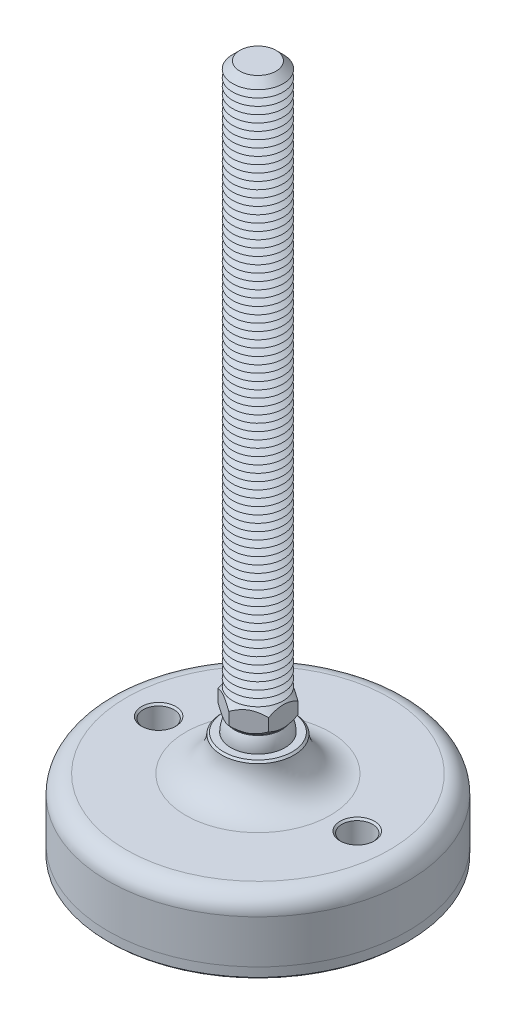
ISO-10303-21;
HEADER;
FILE_DESCRIPTION(('STEP AP214'),'2;1');
FILE_NAME('part.step','',(''),(''),'','','');
FILE_SCHEMA(('AUTOMOTIVE_DESIGN { 1 0 10303 214 1 1 1 1 }'));
ENDSEC;
DATA;
#1=APPLICATION_CONTEXT('core data for automotive mechanical design processes');
#2=APPLICATION_PROTOCOL_DEFINITION('international standard','automotive_design',2000,#1);
#3=PRODUCT_CONTEXT('',#1,'mechanical');
#4=PRODUCT('Part','Part','',(#3));
#5=PRODUCT_RELATED_PRODUCT_CATEGORY('part','',(#4));
#6=PRODUCT_DEFINITION_FORMATION('','',#4);
#7=PRODUCT_DEFINITION_CONTEXT('part definition',#1,'design');
#8=PRODUCT_DEFINITION('design','',#6,#7);
#9=PRODUCT_DEFINITION_SHAPE('','',#8);
#10=(LENGTH_UNIT() NAMED_UNIT(*) SI_UNIT(.MILLI.,.METRE.));
#11=(NAMED_UNIT(*) PLANE_ANGLE_UNIT() SI_UNIT($,.RADIAN.));
#12=(NAMED_UNIT(*) SI_UNIT($,.STERADIAN.) SOLID_ANGLE_UNIT());
#13=UNCERTAINTY_MEASURE_WITH_UNIT(LENGTH_MEASURE(1.E-05),#10,'distance_accuracy_value','');
#14=(GEOMETRIC_REPRESENTATION_CONTEXT(3) GLOBAL_UNCERTAINTY_ASSIGNED_CONTEXT((#13)) GLOBAL_UNIT_ASSIGNED_CONTEXT((#10,
#11,#12)) REPRESENTATION_CONTEXT('',''));
#15=CARTESIAN_POINT('',(0.,0.,0.));
#16=DIRECTION('',(0.,0.,1.));
#17=DIRECTION('',(1.,0.,0.));
#18=AXIS2_PLACEMENT_3D('',#15,#16,#17);
#19=CARTESIAN_POINT('',(0.,-27.,0.));
#20=DIRECTION('',(0.,1.,0.));
#21=DIRECTION('',(0.,0.,1.));
#22=AXIS2_PLACEMENT_3D('',#19,#20,#21);
#23=PLANE('',#22);
#24=CARTESIAN_POINT('',(-27.5,-27.,0.));
#25=DIRECTION('',(0.,1.,0.));
#26=DIRECTION('',(0.,0.,1.));
#27=AXIS2_PLACEMENT_3D('',#24,#25,#26);
#28=CIRCLE('',#27,4.25000000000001);
#29=CARTESIAN_POINT('',(-27.5,-27.,4.25000000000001));
#30=VERTEX_POINT('',#29);
#31=EDGE_CURVE('P0_E43',#30,#30,#28,.T.);
#32=ORIENTED_EDGE('',*,*,#31,.F.);
#33=EDGE_LOOP('',(#32));
#34=FACE_BOUND('',#33,.T.);
#35=CARTESIAN_POINT('',(27.5,-27.,0.));
#36=DIRECTION('',(0.,1.,0.));
#37=DIRECTION('',(0.,0.,1.));
#38=AXIS2_PLACEMENT_3D('',#35,#36,#37);
#39=CIRCLE('',#38,4.25000000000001);
#40=CARTESIAN_POINT('',(27.5,-27.,4.25000000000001));
#41=VERTEX_POINT('',#40);
#42=EDGE_CURVE('P0_E44',#41,#41,#39,.T.);
#43=ORIENTED_EDGE('',*,*,#42,.F.);
#44=EDGE_LOOP('',(#43));
#45=FACE_BOUND('',#44,.T.);
#46=CARTESIAN_POINT('',(0.,-27.,0.));
#47=DIRECTION('',(0.,1.,0.));
#48=DIRECTION('',(0.,0.,1.));
#49=AXIS2_PLACEMENT_3D('',#46,#47,#48);
#50=CIRCLE('',#49,41.5);
#51=CARTESIAN_POINT('',(0.,-27.,41.5));
#52=VERTEX_POINT('',#51);
#53=EDGE_CURVE('P0_E40',#52,#52,#50,.T.);
#54=ORIENTED_EDGE('',*,*,#53,.T.);
#55=EDGE_LOOP('',(#54));
#56=FACE_BOUND('',#55,.T.);
#57=ADVANCED_FACE('P0_F14',(#34,#45,#56),#23,.T.);
#58=CARTESIAN_POINT('',(0.,48.1654938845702,0.));
#59=DIRECTION('',(0.,1.,0.));
#60=DIRECTION('',(0.,0.,1.));
#61=AXIS2_PLACEMENT_3D('',#58,#59,#60);
#62=CYLINDRICAL_SURFACE('',#61,41.5);
#63=CARTESIAN_POINT('',(0.,-29.5,0.));
#64=DIRECTION('',(0.,-1.,0.));
#65=DIRECTION('',(0.,0.,-1.));
#66=AXIS2_PLACEMENT_3D('',#63,#64,#65);
#67=CIRCLE('',#66,41.5);
#68=CARTESIAN_POINT('',(0.,-29.5,-41.5));
#69=VERTEX_POINT('',#68);
#70=EDGE_CURVE('P0_E37',#69,#69,#67,.F.);
#71=ORIENTED_EDGE('',*,*,#70,.T.);
#72=EDGE_LOOP('',(#71));
#73=FACE_BOUND('',#72,.T.);
#74=ORIENTED_EDGE('',*,*,#53,.F.);
#75=EDGE_LOOP('',(#74));
#76=FACE_BOUND('',#75,.T.);
#77=ADVANCED_FACE('P0_F54',(#73,#76),#62,.T.);
#78=CARTESIAN_POINT('',(0.,-30.,41.5));
#79=DIRECTION('',(0.,-1.,0.));
#80=DIRECTION('',(0.,0.,-1.));
#81=AXIS2_PLACEMENT_3D('',#78,#79,#80);
#82=PLANE('',#81);
#83=CARTESIAN_POINT('',(27.5,-30.,0.));
#84=DIRECTION('',(0.,-1.,0.));
#85=DIRECTION('',(0.,0.,-1.));
#86=AXIS2_PLACEMENT_3D('',#83,#84,#85);
#87=CIRCLE('',#86,4.75);
#88=CARTESIAN_POINT('',(27.5,-30.,-4.75000000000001));
#89=VERTEX_POINT('',#88);
#90=EDGE_CURVE('P0_E25',#89,#89,#87,.F.);
#91=ORIENTED_EDGE('',*,*,#90,.T.);
#92=EDGE_LOOP('',(#91));
#93=FACE_BOUND('',#92,.T.);
#94=CARTESIAN_POINT('',(-27.5,-30.,0.));
#95=DIRECTION('',(0.,-1.,0.));
#96=DIRECTION('',(0.,0.,-1.));
#97=AXIS2_PLACEMENT_3D('',#94,#95,#96);
#98=CIRCLE('',#97,4.75);
#99=CARTESIAN_POINT('',(-27.5,-30.,-4.75));
#100=VERTEX_POINT('',#99);
#101=EDGE_CURVE('P0_E29',#100,#100,#98,.F.);
#102=ORIENTED_EDGE('',*,*,#101,.T.);
#103=EDGE_LOOP('',(#102));
#104=FACE_BOUND('',#103,.T.);
#105=CARTESIAN_POINT('',(0.,-30.,0.));
#106=DIRECTION('',(0.,-1.,0.));
#107=DIRECTION('',(0.,0.,-1.));
#108=AXIS2_PLACEMENT_3D('',#105,#106,#107);
#109=CIRCLE('',#108,41.);
#110=CARTESIAN_POINT('',(0.,-30.,-41.));
#111=VERTEX_POINT('',#110);
#112=EDGE_CURVE('P0_E34',#111,#111,#109,.T.);
#113=ORIENTED_EDGE('',*,*,#112,.T.);
#114=EDGE_LOOP('',(#113));
#115=FACE_BOUND('',#114,.T.);
#116=ADVANCED_FACE('P0_F61',(#93,#104,#115),#82,.T.);
#117=CARTESIAN_POINT('',(0.,-29.5,0.));
#118=DIRECTION('',(0.,1.,0.));
#119=DIRECTION('',(0.,0.,1.));
#120=AXIS2_PLACEMENT_3D('',#117,#118,#119);
#121=CONICAL_SURFACE('',#120,41.5,0.785398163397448);
#122=ORIENTED_EDGE('',*,*,#112,.F.);
#123=EDGE_LOOP('',(#122));
#124=FACE_BOUND('',#123,.T.);
#125=ORIENTED_EDGE('',*,*,#70,.F.);
#126=EDGE_LOOP('',(#125));
#127=FACE_BOUND('',#126,.T.);
#128=ADVANCED_FACE('P0_F68',(#124,#127),#121,.T.);
#129=CARTESIAN_POINT('',(27.5,-30.,0.));
#130=DIRECTION('',(0.,1.,0.));
#131=DIRECTION('',(0.,0.,1.));
#132=AXIS2_PLACEMENT_3D('',#129,#130,#131);
#133=CYLINDRICAL_SURFACE('',#132,4.25000000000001);
#134=CARTESIAN_POINT('',(27.5,-29.5,0.));
#135=DIRECTION('',(0.,-1.,0.));
#136=DIRECTION('',(0.,0.,-1.));
#137=AXIS2_PLACEMENT_3D('',#134,#135,#136);
#138=CIRCLE('',#137,4.25000000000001);
#139=CARTESIAN_POINT('',(27.5,-29.5,-4.25000000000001));
#140=VERTEX_POINT('',#139);
#141=EDGE_CURVE('P0_E21',#140,#140,#138,.T.);
#142=ORIENTED_EDGE('',*,*,#141,.T.);
#143=EDGE_LOOP('',(#142));
#144=FACE_BOUND('',#143,.T.);
#145=ORIENTED_EDGE('',*,*,#42,.T.);
#146=EDGE_LOOP('',(#145));
#147=FACE_BOUND('',#146,.T.);
#148=ADVANCED_FACE('P0_F74',(#144,#147),#133,.F.);
#149=CARTESIAN_POINT('',(-27.5,-30.,0.));
#150=DIRECTION('',(0.,1.,0.));
#151=DIRECTION('',(0.,0.,1.));
#152=AXIS2_PLACEMENT_3D('',#149,#150,#151);
#153=CYLINDRICAL_SURFACE('',#152,4.25000000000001);
#154=CARTESIAN_POINT('',(-27.5,-29.5,0.));
#155=DIRECTION('',(0.,-1.,0.));
#156=DIRECTION('',(0.,0.,-1.));
#157=AXIS2_PLACEMENT_3D('',#154,#155,#156);
#158=CIRCLE('',#157,4.25000000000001);
#159=CARTESIAN_POINT('',(-27.5,-29.5,-4.25000000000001));
#160=VERTEX_POINT('',#159);
#161=EDGE_CURVE('P0_E10',#160,#160,#158,.T.);
#162=ORIENTED_EDGE('',*,*,#161,.T.);
#163=EDGE_LOOP('',(#162));
#164=FACE_BOUND('',#163,.T.);
#165=ORIENTED_EDGE('',*,*,#31,.T.);
#166=EDGE_LOOP('',(#165));
#167=FACE_BOUND('',#166,.T.);
#168=ADVANCED_FACE('P0_F50',(#164,#167),#153,.F.);
#169=CARTESIAN_POINT('',(27.5,-30.,0.));
#170=DIRECTION('',(0.,-1.,0.));
#171=DIRECTION('',(0.,0.,-1.));
#172=AXIS2_PLACEMENT_3D('',#169,#170,#171);
#173=CONICAL_SURFACE('',#172,4.75,0.785398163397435);
#174=ORIENTED_EDGE('',*,*,#141,.F.);
#175=EDGE_LOOP('',(#174));
#176=FACE_BOUND('',#175,.T.);
#177=ORIENTED_EDGE('',*,*,#90,.F.);
#178=EDGE_LOOP('',(#177));
#179=FACE_BOUND('',#178,.T.);
#180=ADVANCED_FACE('P0_F76',(#176,#179),#173,.F.);
#181=CARTESIAN_POINT('',(-27.5,-30.,0.));
#182=DIRECTION('',(0.,-1.,0.));
#183=DIRECTION('',(0.,0.,-1.));
#184=AXIS2_PLACEMENT_3D('',#181,#182,#183);
#185=CONICAL_SURFACE('',#184,4.75,0.785398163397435);
#186=ORIENTED_EDGE('',*,*,#161,.F.);
#187=EDGE_LOOP('',(#186));
#188=FACE_BOUND('',#187,.T.);
#189=ORIENTED_EDGE('',*,*,#101,.F.);
#190=EDGE_LOOP('',(#189));
#191=FACE_BOUND('',#190,.T.);
#192=ADVANCED_FACE('P0_F16',(#188,#191),#185,.F.);
#193=CLOSED_SHELL('',(#57,#77,#116,#128,#148,#168,#180,#192));
#194=MANIFOLD_SOLID_BREP('P0_B1',#193);
#195=CARTESIAN_POINT('',(0.,0.,0.));
#196=DIRECTION('',(0.,1.,0.));
#197=DIRECTION('',(0.,0.,-1.));
#198=AXIS2_PLACEMENT_3D('',#195,#196,#197);
#199=SPHERICAL_SURFACE('',#198,7.5);
#200=CARTESIAN_POINT('',(0.,3.75,0.));
#201=DIRECTION('',(0.,-1.,0.));
#202=DIRECTION('',(0.,0.,-1.));
#203=AXIS2_PLACEMENT_3D('',#200,#201,#202);
#204=CIRCLE('',#203,6.49519052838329);
#205=CARTESIAN_POINT('',(0.,3.75,-6.49519052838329));
#206=VERTEX_POINT('',#205);
#207=EDGE_CURVE('P1_E207',#206,#206,#204,.F.);
#208=ORIENTED_EDGE('',*,*,#207,.F.);
#209=EDGE_LOOP('',(#208));
#210=FACE_BOUND('',#209,.T.);
#211=ADVANCED_FACE('P1_F16',(#210),#199,.T.);
#212=CARTESIAN_POINT('',(0.,3.75,0.));
#213=DIRECTION('',(0.,1.,0.));
#214=DIRECTION('',(0.,0.,1.));
#215=AXIS2_PLACEMENT_3D('',#212,#213,#214);
#216=CONICAL_SURFACE('',#215,6.26419292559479,0.785398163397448);
#217=CARTESIAN_POINT('',(0.,3.75,0.));
#218=DIRECTION('',(0.,1.,0.));
#219=DIRECTION('',(0.,0.,1.));
#220=AXIS2_PLACEMENT_3D('',#217,#218,#219);
#221=CIRCLE('',#220,6.26419292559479);
#222=CARTESIAN_POINT('',(0.,3.75,6.26419292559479));
#223=VERTEX_POINT('',#222);
#224=EDGE_CURVE('P1_E211',#223,#223,#221,.T.);
#225=ORIENTED_EDGE('',*,*,#224,.T.);
#226=EDGE_LOOP('',(#225));
#227=FACE_BOUND('',#226,.T.);
#228=CARTESIAN_POINT('',(-7.,8.22175145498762,-8.1400553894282));
#229=CARTESIAN_POINT('',(-7.,8.07177748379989,-7.94220937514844));
#230=CARTESIAN_POINT('',(-7.,7.92322959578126,-7.74326459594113));
#231=CARTESIAN_POINT('',(-7.,7.62962733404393,-7.34274065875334));
#232=CARTESIAN_POINT('',(-7.,7.48457383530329,-7.14116086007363));
#233=CARTESIAN_POINT('',(-7.,7.19756981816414,-6.73345531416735));
#234=CARTESIAN_POINT('',(-7.,7.05565202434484,-6.52730645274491));
#235=CARTESIAN_POINT('',(-7.,6.77703382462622,-6.11152362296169));
#236=CARTESIAN_POINT('',(-7.,6.64033305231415,-5.90188990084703));
#237=CARTESIAN_POINT('',(-7.,6.36550740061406,-5.46619755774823));
#238=CARTESIAN_POINT('',(-7.,6.22776674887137,-5.23989534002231));
#239=CARTESIAN_POINT('',(-7.,5.96123372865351,-4.78200028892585));
#240=CARTESIAN_POINT('',(-7.,5.83244279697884,-4.55040661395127));
#241=CARTESIAN_POINT('',(-7.,5.58658047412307,-4.08193183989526));
#242=CARTESIAN_POINT('',(-7.,5.46947462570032,-3.8450689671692));
#243=CARTESIAN_POINT('',(-7.,5.24960465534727,-3.36483104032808));
#244=CARTESIAN_POINT('',(-7.,5.14683397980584,-3.12145902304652));
#245=CARTESIAN_POINT('',(-7.,4.96723655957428,-2.64866791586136));
#246=CARTESIAN_POINT('',(-7.,4.88895097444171,-2.41980876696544));
#247=CARTESIAN_POINT('',(-7.,4.75072959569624,-1.9565107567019));
#248=CARTESIAN_POINT('',(-7.,4.69079504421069,-1.72207151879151));
#249=CARTESIAN_POINT('',(-7.,4.59342684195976,-1.25295119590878));
#250=CARTESIAN_POINT('',(-7.,4.5556027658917,-1.01835249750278));
#251=CARTESIAN_POINT('',(-7.,4.50320231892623,-0.546559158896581));
#252=CARTESIAN_POINT('',(-7.,4.48862178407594,-0.309364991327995));
#253=CARTESIAN_POINT('',(-7.,4.48382612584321,0.156313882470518));
#254=CARTESIAN_POINT('',(-7.,4.49271264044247,0.384789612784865));
#255=CARTESIAN_POINT('',(-7.,4.53235928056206,0.839822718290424));
#256=CARTESIAN_POINT('',(-7.,4.56312150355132,1.06637990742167));
#257=CARTESIAN_POINT('',(-7.,4.64535130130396,1.51976805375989));
#258=CARTESIAN_POINT('',(-7.,4.69717402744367,1.74653354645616));
#259=CARTESIAN_POINT('',(-7.,4.81873728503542,2.19511331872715));
#260=CARTESIAN_POINT('',(-7.,4.88847641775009,2.41692798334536));
#261=CARTESIAN_POINT('',(-7.,5.04951755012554,2.87389766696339));
#262=CARTESIAN_POINT('',(-7.,5.14215063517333,3.10857869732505));
#263=CARTESIAN_POINT('',(-7.,5.3416605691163,3.57185972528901));
#264=CARTESIAN_POINT('',(-7.,5.44854400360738,3.80045685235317));
#265=CARTESIAN_POINT('',(-7.,5.6740138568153,4.25267813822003));
#266=CARTESIAN_POINT('',(-7.,5.79263686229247,4.47628390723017));
#267=CARTESIAN_POINT('',(-7.,6.03896666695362,4.91835509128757));
#268=CARTESIAN_POINT('',(-7.,6.16667203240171,5.13682131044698));
#269=CARTESIAN_POINT('',(-7.,6.4228595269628,5.55855563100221));
#270=CARTESIAN_POINT('',(-7.,6.55098806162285,5.76203966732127));
#271=CARTESIAN_POINT('',(-7.,6.81264959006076,6.16551366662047));
#272=CARTESIAN_POINT('',(-7.,6.94618299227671,6.36550336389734));
#273=CARTESIAN_POINT('',(-7.,7.21658951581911,6.76082742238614));
#274=CARTESIAN_POINT('',(-7.,7.35342681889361,6.95618637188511));
#275=CARTESIAN_POINT('',(-7.,7.6307324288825,7.34423185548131));
#276=CARTESIAN_POINT('',(-7.,7.77119972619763,7.53691911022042));
#277=CARTESIAN_POINT('',(-7.,7.91315155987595,7.72848711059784));
#278=B_SPLINE_CURVE_WITH_KNOTS('',3,(#228,#229,#230,#231,#232,#233,#234,#235,#236,#237,#238,
#239,#240,#241,#242,#243,#244,#245,#246,#247,#248,#249,#250,#251,#252,#253,#254,#255,#256,#257,
#258,#259,#260,#261,#262,#263,#264,#265,#266,#267,#268,#269,#270,#271,#272,#273,#274,#275,#276,
#277),.UNSPECIFIED.,.F.,.F.,(4,2,2,2,2,2,2,2,2,2,2,2,2,2,2,2,2,2,2,2,2,2,2,2,4),(0.,
0.744807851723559,1.48980030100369,2.2405614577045,2.99126978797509,3.78587980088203,
4.58061708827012,5.37293691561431,6.16489332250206,6.88989369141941,7.61494312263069,
8.32676947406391,9.0384682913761,9.72332048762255,10.4082383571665,11.1052200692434,
11.8021473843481,12.5584650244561,13.3151334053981,14.0742390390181,14.8332251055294,
15.5545151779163,16.2758598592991,16.9913609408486,17.7066651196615),.UNSPECIFIED.);
#279=CARTESIAN_POINT('',(-7.,5.56871084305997,-4.04145188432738));
#280=VERTEX_POINT('',#279);
#281=CARTESIAN_POINT('',(-7.,5.56871084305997,4.04145188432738));
#282=VERTEX_POINT('',#281);
#283=EDGE_CURVE('P1_E24',#280,#282,#278,.T.);
#284=ORIENTED_EDGE('',*,*,#283,.F.);
#285=CARTESIAN_POINT('',(0.000199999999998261,5.56882631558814,-8.0830192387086));
#286=CARTESIAN_POINT('',(-0.120159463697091,5.49934419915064,-8.01352966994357));
#287=CARTESIAN_POINT('',(-0.241444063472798,5.43199440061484,-7.94350597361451));
#288=CARTESIAN_POINT('',(-0.486045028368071,5.30220807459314,-7.80228554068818));
#289=CARTESIAN_POINT('',(-0.60936245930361,5.2397742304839,-7.73108818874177));
#290=CARTESIAN_POINT('',(-0.983781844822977,5.06028719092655,-7.51491705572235));
#291=CARTESIAN_POINT('',(-1.23805341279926,4.95181416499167,-7.36811329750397));
#292=CARTESIAN_POINT('',(-1.75081233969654,4.76606165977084,-7.07207179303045));
#293=CARTESIAN_POINT('',(-2.00916864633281,4.68831421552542,-6.92290970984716));
#294=CARTESIAN_POINT('',(-2.40095049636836,4.59837958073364,-6.69671435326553));
#295=CARTESIAN_POINT('',(-2.53212124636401,4.57286115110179,-6.62098288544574));
#296=CARTESIAN_POINT('',(-2.79557335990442,4.53129725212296,-6.4688787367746));
#297=CARTESIAN_POINT('',(-2.92785455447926,4.5152503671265,-6.39250615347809));
#298=CARTESIAN_POINT('',(-3.25020698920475,4.48834537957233,-6.2063958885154));
#299=CARTESIAN_POINT('',(-3.44062555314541,4.48270029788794,-6.09645767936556));
#300=CARTESIAN_POINT('',(-3.82111946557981,4.49217587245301,-5.87677941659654));
#301=CARTESIAN_POINT('',(-4.01119467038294,4.5073038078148,-5.76703944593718));
#302=CARTESIAN_POINT('',(-4.38955306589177,4.55743368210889,-5.54859412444));
#303=CARTESIAN_POINT('',(-4.57783401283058,4.5924578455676,-5.43989006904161));
#304=CARTESIAN_POINT('',(-4.95115981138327,4.68047604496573,-5.22435031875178));
#305=CARTESIAN_POINT('',(-5.13620490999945,4.73346870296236,-5.1175144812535));
#306=CARTESIAN_POINT('',(-5.46469033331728,4.84248989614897,-4.92786333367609));
#307=CARTESIAN_POINT('',(-5.6088580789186,4.89565100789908,-4.8446280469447));
#308=CARTESIAN_POINT('',(-5.8946056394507,5.0105398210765,-4.67965161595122));
#309=CARTESIAN_POINT('',(-6.03618537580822,5.07226778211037,-4.5979105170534));
#310=CARTESIAN_POINT('',(-6.31631098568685,5.20290661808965,-4.43617992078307));
#311=CARTESIAN_POINT('',(-6.4548648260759,5.27179490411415,-4.3561858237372));
#312=CARTESIAN_POINT('',(-6.72940692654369,5.41585000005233,-4.19767886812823));
#313=CARTESIAN_POINT('',(-6.86539669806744,5.49101295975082,-4.11916513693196));
#314=CARTESIAN_POINT('',(-7.0002,5.56882631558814,-4.04133641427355));
#315=B_SPLINE_CURVE_WITH_KNOTS('',3,(#285,#286,#287,#288,#289,#290,#291,#292,#293,#294,#295,
#296,#297,#298,#299,#300,#301,#302,#303,#304,#305,#306,#307,#308,#309,#310,#311,#312,#313,#314),
.UNSPECIFIED.,.F.,.F.,(4,2,2,2,2,2,2,2,2,2,2,2,2,2,4),(0.,0.466112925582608,0.932478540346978,
1.87024464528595,2.79312018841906,3.25365289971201,3.71411676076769,4.37293813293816,
5.03199042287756,5.69178034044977,6.35151967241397,6.8755322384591,7.39956068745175,
7.92198344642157,8.44408796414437),.UNSPECIFIED.);
#316=CARTESIAN_POINT('',(0.,5.56871084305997,-8.08290376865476));
#317=VERTEX_POINT('',#316);
#318=EDGE_CURVE('P1_E112',#317,#280,#315,.T.);
#319=ORIENTED_EDGE('',*,*,#318,.F.);
#320=CARTESIAN_POINT('',(7.00019999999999,5.56882631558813,-4.04133641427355));
#321=CARTESIAN_POINT('',(6.8798405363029,5.49934419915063,-4.11082598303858));
#322=CARTESIAN_POINT('',(6.7585559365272,5.43199440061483,-4.18084967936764));
#323=CARTESIAN_POINT('',(6.51395497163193,5.30220807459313,-4.32207011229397));
#324=CARTESIAN_POINT('',(6.39063754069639,5.2397742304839,-4.39326746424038));
#325=CARTESIAN_POINT('',(6.01621815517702,5.06028719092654,-4.6094385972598));
#326=CARTESIAN_POINT('',(5.76194658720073,4.95181416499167,-4.75624235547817));
#327=CARTESIAN_POINT('',(5.24918766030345,4.76606165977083,-5.0522838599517));
#328=CARTESIAN_POINT('',(4.99083135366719,4.68831421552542,-5.20144594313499));
#329=CARTESIAN_POINT('',(4.59904950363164,4.59837958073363,-5.42764129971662));
#330=CARTESIAN_POINT('',(4.46787875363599,4.57286115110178,-5.50337276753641));
#331=CARTESIAN_POINT('',(4.20442664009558,4.53129725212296,-5.65547691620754));
#332=CARTESIAN_POINT('',(4.07214544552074,4.5152503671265,-5.73184949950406));
#333=CARTESIAN_POINT('',(3.74979301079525,4.48834537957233,-5.91795976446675));
#334=CARTESIAN_POINT('',(3.55937444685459,4.48270029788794,-6.02789797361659));
#335=CARTESIAN_POINT('',(3.17888053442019,4.49217587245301,-6.2475762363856));
#336=CARTESIAN_POINT('',(2.98880532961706,4.5073038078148,-6.35731620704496));
#337=CARTESIAN_POINT('',(2.61044693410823,4.55743368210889,-6.57576152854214));
#338=CARTESIAN_POINT('',(2.42216598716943,4.5924578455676,-6.68446558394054));
#339=CARTESIAN_POINT('',(2.04884018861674,4.68047604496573,-6.90000533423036));
#340=CARTESIAN_POINT('',(1.86379509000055,4.73346870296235,-7.00684117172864));
#341=CARTESIAN_POINT('',(1.53530966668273,4.84248989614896,-7.19649231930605));
#342=CARTESIAN_POINT('',(1.3911419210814,4.89565100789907,-7.27972760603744));
#343=CARTESIAN_POINT('',(1.1053943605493,5.0105398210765,-7.44470403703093));
#344=CARTESIAN_POINT('',(0.96381462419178,5.07226778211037,-7.52644513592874));
#345=CARTESIAN_POINT('',(0.683689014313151,5.20290661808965,-7.68817573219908));
#346=CARTESIAN_POINT('',(0.545135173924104,5.27179490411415,-7.76816982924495));
#347=CARTESIAN_POINT('',(0.270593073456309,5.41585000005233,-7.92667678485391));
#348=CARTESIAN_POINT('',(0.134603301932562,5.49101295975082,-8.00519051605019));
#349=CARTESIAN_POINT('',(-0.00020000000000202,5.56882631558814,-8.0830192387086));
#350=B_SPLINE_CURVE_WITH_KNOTS('',3,(#320,#321,#322,#323,#324,#325,#326,#327,#328,#329,#330,
#331,#332,#333,#334,#335,#336,#337,#338,#339,#340,#341,#342,#343,#344,#345,#346,#347,#348,#349),
.UNSPECIFIED.,.F.,.F.,(4,2,2,2,2,2,2,2,2,2,2,2,2,2,4),(0.,0.466112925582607,0.932478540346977,
1.87024464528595,2.79312018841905,3.25365289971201,3.71411676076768,4.37293813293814,
5.03199042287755,5.69178034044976,6.35151967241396,6.87553223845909,7.39956068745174,
7.92198344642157,8.44408796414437),.UNSPECIFIED.);
#351=CARTESIAN_POINT('',(7.,5.56871084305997,-4.04145188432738));
#352=VERTEX_POINT('',#351);
#353=EDGE_CURVE('P1_E119',#352,#317,#350,.T.);
#354=ORIENTED_EDGE('',*,*,#353,.F.);
#355=CARTESIAN_POINT('',(6.99999999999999,8.22175145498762,-8.1400553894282));
#356=CARTESIAN_POINT('',(6.99999999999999,8.07177748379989,-7.94220937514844));
#357=CARTESIAN_POINT('',(6.99999999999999,7.92322959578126,-7.74326459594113));
#358=CARTESIAN_POINT('',(6.99999999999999,7.62962733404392,-7.34274065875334));
#359=CARTESIAN_POINT('',(6.99999999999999,7.48457383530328,-7.14116086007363));
#360=CARTESIAN_POINT('',(6.99999999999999,7.19756981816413,-6.73345531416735));
#361=CARTESIAN_POINT('',(6.99999999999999,7.05565202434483,-6.52730645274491));
#362=CARTESIAN_POINT('',(6.99999999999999,6.77703382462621,-6.11152362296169));
#363=CARTESIAN_POINT('',(6.99999999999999,6.64033305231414,-5.90188990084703));
#364=CARTESIAN_POINT('',(6.99999999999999,6.36550740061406,-5.46619755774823));
#365=CARTESIAN_POINT('',(6.99999999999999,6.22776674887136,-5.23989534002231));
#366=CARTESIAN_POINT('',(6.99999999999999,5.9612337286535,-4.78200028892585));
#367=CARTESIAN_POINT('',(6.99999999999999,5.83244279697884,-4.55040661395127));
#368=CARTESIAN_POINT('',(6.99999999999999,5.58658047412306,-4.08193183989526));
#369=CARTESIAN_POINT('',(6.99999999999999,5.46947462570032,-3.8450689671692));
#370=CARTESIAN_POINT('',(6.99999999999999,5.24960465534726,-3.36483104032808));
#371=CARTESIAN_POINT('',(6.99999999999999,5.14683397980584,-3.12145902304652));
#372=CARTESIAN_POINT('',(6.99999999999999,4.96723655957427,-2.64866791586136));
#373=CARTESIAN_POINT('',(6.99999999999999,4.88895097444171,-2.41980876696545));
#374=CARTESIAN_POINT('',(6.99999999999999,4.75072959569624,-1.9565107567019));
#375=CARTESIAN_POINT('',(6.99999999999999,4.69079504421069,-1.72207151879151));
#376=CARTESIAN_POINT('',(6.99999999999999,4.59342684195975,-1.25295119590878));
#377=CARTESIAN_POINT('',(6.99999999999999,4.5556027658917,-1.01835249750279));
#378=CARTESIAN_POINT('',(6.99999999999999,4.50320231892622,-0.546559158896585));
#379=CARTESIAN_POINT('',(6.99999999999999,4.48862178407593,-0.309364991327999));
#380=CARTESIAN_POINT('',(6.99999999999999,4.48382612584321,0.156313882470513));
#381=CARTESIAN_POINT('',(6.99999999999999,4.49271264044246,0.38478961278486));
#382=CARTESIAN_POINT('',(6.99999999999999,4.53235928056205,0.83982271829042));
#383=CARTESIAN_POINT('',(6.99999999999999,4.56312150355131,1.06637990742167));
#384=CARTESIAN_POINT('',(6.99999999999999,4.64535130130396,1.51976805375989));
#385=CARTESIAN_POINT('',(6.99999999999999,4.69717402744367,1.74653354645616));
#386=CARTESIAN_POINT('',(6.99999999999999,4.81873728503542,2.19511331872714));
#387=CARTESIAN_POINT('',(7.,4.88847641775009,2.41692798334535));
#388=CARTESIAN_POINT('',(7.,5.04951755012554,2.87389766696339));
#389=CARTESIAN_POINT('',(7.,5.14215063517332,3.10857869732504));
#390=CARTESIAN_POINT('',(7.,5.34166056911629,3.571859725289));
#391=CARTESIAN_POINT('',(7.,5.44854400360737,3.80045685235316));
#392=CARTESIAN_POINT('',(7.,5.67401385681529,4.25267813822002));
#393=CARTESIAN_POINT('',(7.,5.79263686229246,4.47628390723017));
#394=CARTESIAN_POINT('',(7.,6.03896666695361,4.91835509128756));
#395=CARTESIAN_POINT('',(7.,6.1666720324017,5.13682131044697));
#396=CARTESIAN_POINT('',(7.,6.42285952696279,5.5585556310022));
#397=CARTESIAN_POINT('',(7.,6.55098806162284,5.76203966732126));
#398=CARTESIAN_POINT('',(7.,6.81264959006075,6.16551366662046));
#399=CARTESIAN_POINT('',(7.,6.9461829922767,6.36550336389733));
#400=CARTESIAN_POINT('',(7.,7.21658951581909,6.76082742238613));
#401=CARTESIAN_POINT('',(7.,7.3534268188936,6.9561863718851));
#402=CARTESIAN_POINT('',(7.,7.63073242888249,7.3442318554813));
#403=CARTESIAN_POINT('',(7.,7.77119972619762,7.53691911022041));
#404=CARTESIAN_POINT('',(7.,7.91315155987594,7.72848711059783));
#405=B_SPLINE_CURVE_WITH_KNOTS('',3,(#355,#356,#357,#358,#359,#360,#361,#362,#363,#364,#365,
#366,#367,#368,#369,#370,#371,#372,#373,#374,#375,#376,#377,#378,#379,#380,#381,#382,#383,#384,
#385,#386,#387,#388,#389,#390,#391,#392,#393,#394,#395,#396,#397,#398,#399,#400,#401,#402,#403,
#404),.UNSPECIFIED.,.F.,.F.,(4,2,2,2,2,2,2,2,2,2,2,2,2,2,2,2,2,2,2,2,2,2,2,2,4),(0.,
0.744807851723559,1.48980030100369,2.2405614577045,2.9912697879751,3.78587980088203,
4.58061708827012,5.3729369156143,6.16489332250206,6.8898936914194,7.61494312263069,
8.32676947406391,9.03846829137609,9.72332048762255,10.4082383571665,11.1052200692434,
11.8021473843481,12.5584650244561,13.3151334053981,14.0742390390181,14.8332251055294,
15.5545151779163,16.275859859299,16.9913609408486,17.7066651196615),.UNSPECIFIED.);
#406=CARTESIAN_POINT('',(6.99999999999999,5.56871084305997,4.04145188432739));
#407=VERTEX_POINT('',#406);
#408=EDGE_CURVE('P1_E70',#407,#352,#405,.F.);
#409=ORIENTED_EDGE('',*,*,#408,.F.);
#410=CARTESIAN_POINT('',(-0.000200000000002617,5.56882631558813,8.0830192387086));
#411=CARTESIAN_POINT('',(0.120159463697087,5.49934419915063,8.01352966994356));
#412=CARTESIAN_POINT('',(0.241444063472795,5.43199440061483,7.9435059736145));
#413=CARTESIAN_POINT('',(0.486045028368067,5.30220807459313,7.80228554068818));
#414=CARTESIAN_POINT('',(0.609362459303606,5.2397742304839,7.73108818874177));
#415=CARTESIAN_POINT('',(0.983781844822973,5.06028719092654,7.51491705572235));
#416=CARTESIAN_POINT('',(1.23805341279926,4.95181416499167,7.36811329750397));
#417=CARTESIAN_POINT('',(1.75081233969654,4.76606165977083,7.07207179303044));
#418=CARTESIAN_POINT('',(2.00916864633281,4.68831421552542,6.92290970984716));
#419=CARTESIAN_POINT('',(2.40095049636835,4.59837958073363,6.69671435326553));
#420=CARTESIAN_POINT('',(2.53212124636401,4.57286115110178,6.62098288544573));
#421=CARTESIAN_POINT('',(2.79557335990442,4.53129725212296,6.4688787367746));
#422=CARTESIAN_POINT('',(2.92785455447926,4.5152503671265,6.39250615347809));
#423=CARTESIAN_POINT('',(3.25020698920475,4.48834537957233,6.2063958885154));
#424=CARTESIAN_POINT('',(3.44062555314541,4.48270029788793,6.09645767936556));
#425=CARTESIAN_POINT('',(3.82111946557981,4.492175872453,5.87677941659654));
#426=CARTESIAN_POINT('',(4.01119467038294,4.5073038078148,5.76703944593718));
#427=CARTESIAN_POINT('',(4.38955306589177,4.55743368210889,5.54859412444));
#428=CARTESIAN_POINT('',(4.57783401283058,4.5924578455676,5.4398900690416));
#429=CARTESIAN_POINT('',(4.95115981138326,4.68047604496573,5.22435031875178));
#430=CARTESIAN_POINT('',(5.13620490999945,4.73346870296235,5.1175144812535));
#431=CARTESIAN_POINT('',(5.46469033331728,4.84248989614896,4.92786333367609));
#432=CARTESIAN_POINT('',(5.6088580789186,4.89565100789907,4.8446280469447));
#433=CARTESIAN_POINT('',(5.8946056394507,5.01053982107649,4.67965161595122));
#434=CARTESIAN_POINT('',(6.03618537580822,5.07226778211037,4.5979105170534));
#435=CARTESIAN_POINT('',(6.31631098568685,5.20290661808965,4.43617992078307));
#436=CARTESIAN_POINT('',(6.45486482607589,5.27179490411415,4.3561858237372));
#437=CARTESIAN_POINT('',(6.72940692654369,5.41585000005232,4.19767886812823));
#438=CARTESIAN_POINT('',(6.86539669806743,5.49101295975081,4.11916513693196));
#439=CARTESIAN_POINT('',(7.00019999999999,5.56882631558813,4.04133641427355));
#440=B_SPLINE_CURVE_WITH_KNOTS('',3,(#410,#411,#412,#413,#414,#415,#416,#417,#418,#419,#420,
#421,#422,#423,#424,#425,#426,#427,#428,#429,#430,#431,#432,#433,#434,#435,#436,#437,#438,#439),
.UNSPECIFIED.,.F.,.F.,(4,2,2,2,2,2,2,2,2,2,2,2,2,2,4),(0.,0.466112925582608,0.932478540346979,
1.87024464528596,2.79312018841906,3.25365289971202,3.71411676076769,4.37293813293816,
5.03199042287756,5.69178034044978,6.35151967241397,6.8755322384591,7.39956068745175,
7.92198344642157,8.44408796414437),.UNSPECIFIED.);
#441=CARTESIAN_POINT('',(0.,5.56871084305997,8.08290376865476));
#442=VERTEX_POINT('',#441);
#443=EDGE_CURVE('P1_E67',#442,#407,#440,.T.);
#444=ORIENTED_EDGE('',*,*,#443,.F.);
#445=CARTESIAN_POINT('',(-7.0002,5.56882631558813,4.04133641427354));
#446=CARTESIAN_POINT('',(-6.87984053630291,5.49934419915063,4.11082598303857));
#447=CARTESIAN_POINT('',(-6.7585559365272,5.43199440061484,4.18084967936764));
#448=CARTESIAN_POINT('',(-6.51395497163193,5.30220807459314,4.32207011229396));
#449=CARTESIAN_POINT('',(-6.39063754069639,5.2397742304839,4.39326746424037));
#450=CARTESIAN_POINT('',(-6.01621815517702,5.06028719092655,4.60943859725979));
#451=CARTESIAN_POINT('',(-5.76194658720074,4.95181416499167,4.75624235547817));
#452=CARTESIAN_POINT('',(-5.24918766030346,4.76606165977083,5.0522838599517));
#453=CARTESIAN_POINT('',(-4.99083135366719,4.68831421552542,5.20144594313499));
#454=CARTESIAN_POINT('',(-4.59904950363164,4.59837958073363,5.42764129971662));
#455=CARTESIAN_POINT('',(-4.46787875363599,4.57286115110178,5.50337276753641));
#456=CARTESIAN_POINT('',(-4.20442664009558,4.53129725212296,5.65547691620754));
#457=CARTESIAN_POINT('',(-4.07214544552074,4.5152503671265,5.73184949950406));
#458=CARTESIAN_POINT('',(-3.74979301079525,4.48834537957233,5.91795976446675));
#459=CARTESIAN_POINT('',(-3.55937444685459,4.48270029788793,6.02789797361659));
#460=CARTESIAN_POINT('',(-3.17888053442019,4.492175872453,6.2475762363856));
#461=CARTESIAN_POINT('',(-2.98880532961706,4.5073038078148,6.35731620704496));
#462=CARTESIAN_POINT('',(-2.61044693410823,4.55743368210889,6.57576152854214));
#463=CARTESIAN_POINT('',(-2.42216598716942,4.5924578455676,6.68446558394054));
#464=CARTESIAN_POINT('',(-2.04884018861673,4.68047604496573,6.90000533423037));
#465=CARTESIAN_POINT('',(-1.86379509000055,4.73346870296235,7.00684117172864));
#466=CARTESIAN_POINT('',(-1.53530966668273,4.84248989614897,7.19649231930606));
#467=CARTESIAN_POINT('',(-1.3911419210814,4.89565100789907,7.27972760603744));
#468=CARTESIAN_POINT('',(-1.1053943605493,5.01053982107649,7.44470403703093));
#469=CARTESIAN_POINT('',(-0.963814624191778,5.07226778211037,7.52644513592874));
#470=CARTESIAN_POINT('',(-0.683689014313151,5.20290661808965,7.68817573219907));
#471=CARTESIAN_POINT('',(-0.545135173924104,5.27179490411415,7.76816982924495));
#472=CARTESIAN_POINT('',(-0.270593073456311,5.41585000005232,7.92667678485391));
#473=CARTESIAN_POINT('',(-0.134603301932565,5.49101295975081,8.00519051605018));
#474=CARTESIAN_POINT('',(0.000199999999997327,5.56882631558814,8.0830192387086));
#475=B_SPLINE_CURVE_WITH_KNOTS('',3,(#445,#446,#447,#448,#449,#450,#451,#452,#453,#454,#455,
#456,#457,#458,#459,#460,#461,#462,#463,#464,#465,#466,#467,#468,#469,#470,#471,#472,#473,#474),
.UNSPECIFIED.,.F.,.F.,(4,2,2,2,2,2,2,2,2,2,2,2,2,2,4),(0.,0.466112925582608,0.93247854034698,
1.87024464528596,2.79312018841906,3.25365289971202,3.71411676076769,4.37293813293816,
5.03199042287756,5.69178034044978,6.35151967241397,6.8755322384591,7.39956068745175,
7.92198344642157,8.44408796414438),.UNSPECIFIED.);
#476=EDGE_CURVE('P1_E39',#282,#442,#475,.T.);
#477=ORIENTED_EDGE('',*,*,#476,.F.);
#478=EDGE_LOOP('',(#284,#319,#354,#409,#444,#477));
#479=FACE_BOUND('',#478,.T.);
#480=ADVANCED_FACE('P1_F68',(#227,#479),#216,.T.);
#481=CARTESIAN_POINT('',(0.,3.75,6.26419292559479));
#482=DIRECTION('',(0.,-1.,0.));
#483=DIRECTION('',(0.,0.,-1.));
#484=AXIS2_PLACEMENT_3D('',#481,#482,#483);
#485=PLANE('',#484);
#486=ORIENTED_EDGE('',*,*,#207,.T.);
#487=EDGE_LOOP('',(#486));
#488=FACE_BOUND('',#487,.T.);
#489=ORIENTED_EDGE('',*,*,#224,.F.);
#490=EDGE_LOOP('',(#489));
#491=FACE_BOUND('',#490,.T.);
#492=ADVANCED_FACE('P1_F104',(#488,#491),#485,.F.);
#493=CARTESIAN_POINT('',(-7.,11.,4.04145188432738));
#494=DIRECTION('',(0.5,0.,-0.866025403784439));
#495=DIRECTION('',(-0.866025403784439,0.,-0.5));
#496=AXIS2_PLACEMENT_3D('',#493,#494,#495);
#497=PLANE('',#496);
#498=DIRECTION('',(0.,-1.,0.));
#499=VECTOR('',#498,1.);
#500=CARTESIAN_POINT('',(0.,11.,8.08290376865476));
#501=LINE('',#500,#499);
#502=CARTESIAN_POINT('',(0.,8.97927405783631,8.08290376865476));
#503=VERTEX_POINT('',#502);
#504=EDGE_CURVE('P1_E81',#503,#442,#501,.T.);
#505=ORIENTED_EDGE('',*,*,#504,.F.);
#506=CARTESIAN_POINT('',(0.000199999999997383,8.97915858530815,8.0830192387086));
#507=CARTESIAN_POINT('',(-0.120159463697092,9.04864070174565,8.01352966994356));
#508=CARTESIAN_POINT('',(-0.241444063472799,9.11599050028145,7.9435059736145));
#509=CARTESIAN_POINT('',(-0.486045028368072,9.24577682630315,7.80228554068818));
#510=CARTESIAN_POINT('',(-0.609362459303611,9.30821067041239,7.73108818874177));
#511=CARTESIAN_POINT('',(-0.983781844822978,9.48769770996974,7.51491705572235));
#512=CARTESIAN_POINT('',(-1.23805341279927,9.59617073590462,7.36811329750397));
#513=CARTESIAN_POINT('',(-1.75081233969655,9.78192324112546,7.07207179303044));
#514=CARTESIAN_POINT('',(-2.00916864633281,9.85967068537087,6.92290970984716));
#515=CARTESIAN_POINT('',(-2.40095049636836,9.94960532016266,6.69671435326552));
#516=CARTESIAN_POINT('',(-2.53212124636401,9.9751237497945,6.62098288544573));
#517=CARTESIAN_POINT('',(-2.79557335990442,10.0166876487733,6.4688787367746));
#518=CARTESIAN_POINT('',(-2.92785455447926,10.0327345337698,6.39250615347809));
#519=CARTESIAN_POINT('',(-3.25020698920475,10.059639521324,6.2063958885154));
#520=CARTESIAN_POINT('',(-3.44062555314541,10.0652846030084,6.09645767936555));
#521=CARTESIAN_POINT('',(-3.82111946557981,10.0558090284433,5.87677941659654));
#522=CARTESIAN_POINT('',(-4.01119467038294,10.0406810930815,5.76703944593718));
#523=CARTESIAN_POINT('',(-4.38955306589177,9.9905512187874,5.54859412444));
#524=CARTESIAN_POINT('',(-4.57783401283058,9.95552705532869,5.4398900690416));
#525=CARTESIAN_POINT('',(-4.95115981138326,9.86750885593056,5.22435031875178));
#526=CARTESIAN_POINT('',(-5.13620490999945,9.81451619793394,5.1175144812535));
#527=CARTESIAN_POINT('',(-5.46469033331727,9.70549500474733,4.92786333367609));
#528=CARTESIAN_POINT('',(-5.6088580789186,9.65233389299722,4.8446280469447));
#529=CARTESIAN_POINT('',(-5.8946056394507,9.5374450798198,4.67965161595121));
#530=CARTESIAN_POINT('',(-6.03618537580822,9.47571711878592,4.5979105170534));
#531=CARTESIAN_POINT('',(-6.31631098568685,9.34507828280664,4.43617992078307));
#532=CARTESIAN_POINT('',(-6.4548648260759,9.27618999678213,4.35618582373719));
#533=CARTESIAN_POINT('',(-6.72940692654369,9.13213490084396,4.19767886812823));
#534=CARTESIAN_POINT('',(-6.86539669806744,9.05697194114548,4.11916513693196));
#535=CARTESIAN_POINT('',(-7.0002,8.97915858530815,4.04133641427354));
#536=B_SPLINE_CURVE_WITH_KNOTS('',3,(#506,#507,#508,#509,#510,#511,#512,#513,#514,#515,#516,
#517,#518,#519,#520,#521,#522,#523,#524,#525,#526,#527,#528,#529,#530,#531,#532,#533,#534,#535),
.UNSPECIFIED.,.F.,.F.,(4,2,2,2,2,2,2,2,2,2,2,2,2,2,4),(0.,0.466112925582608,0.932478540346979,
1.87024464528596,2.79312018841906,3.25365289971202,3.71411676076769,4.37293813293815,
5.03199042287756,5.69178034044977,6.35151967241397,6.87553223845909,7.39956068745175,
7.92198344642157,8.44408796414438),.UNSPECIFIED.);
#537=CARTESIAN_POINT('',(-7.,8.97927405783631,4.04145188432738));
#538=VERTEX_POINT('',#537);
#539=EDGE_CURVE('P1_E149',#503,#538,#536,.T.);
#540=ORIENTED_EDGE('',*,*,#539,.T.);
#541=DIRECTION('',(0.,-1.,0.));
#542=VECTOR('',#541,1.);
#543=CARTESIAN_POINT('',(-7.,11.,4.04145188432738));
#544=LINE('',#543,#542);
#545=EDGE_CURVE('P1_E83',#538,#282,#544,.T.);
#546=ORIENTED_EDGE('',*,*,#545,.T.);
#547=ORIENTED_EDGE('',*,*,#476,.T.);
#548=EDGE_LOOP('',(#505,#540,#546,#547));
#549=FACE_BOUND('',#548,.T.);
#550=ADVANCED_FACE('P1_F79',(#549),#497,.F.);
#551=CARTESIAN_POINT('',(0.,11.,8.08290376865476));
#552=DIRECTION('',(-0.5,0.,-0.866025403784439));
#553=DIRECTION('',(-0.866025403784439,0.,0.5));
#554=AXIS2_PLACEMENT_3D('',#551,#552,#553);
#555=PLANE('',#554);
#556=DIRECTION('',(0.,-1.,0.));
#557=VECTOR('',#556,1.);
#558=CARTESIAN_POINT('',(7.,11.,4.04145188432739));
#559=LINE('',#558,#557);
#560=CARTESIAN_POINT('',(7.,8.97927405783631,4.04145188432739));
#561=VERTEX_POINT('',#560);
#562=EDGE_CURVE('P1_E88',#561,#407,#559,.T.);
#563=ORIENTED_EDGE('',*,*,#562,.F.);
#564=CARTESIAN_POINT('',(7.0002,8.97915858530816,4.04133641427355));
#565=CARTESIAN_POINT('',(6.87984053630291,9.04864070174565,4.11082598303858));
#566=CARTESIAN_POINT('',(6.7585559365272,9.11599050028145,4.18084967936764));
#567=CARTESIAN_POINT('',(6.51395497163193,9.24577682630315,4.32207011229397));
#568=CARTESIAN_POINT('',(6.39063754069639,9.30821067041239,4.39326746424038));
#569=CARTESIAN_POINT('',(6.01621815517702,9.48769770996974,4.6094385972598));
#570=CARTESIAN_POINT('',(5.76194658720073,9.59617073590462,4.75624235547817));
#571=CARTESIAN_POINT('',(5.24918766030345,9.78192324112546,5.0522838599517));
#572=CARTESIAN_POINT('',(4.99083135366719,9.85967068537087,5.20144594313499));
#573=CARTESIAN_POINT('',(4.59904950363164,9.94960532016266,5.42764129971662));
#574=CARTESIAN_POINT('',(4.46787875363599,9.9751237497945,5.50337276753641));
#575=CARTESIAN_POINT('',(4.20442664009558,10.0166876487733,5.65547691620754));
#576=CARTESIAN_POINT('',(4.07214544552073,10.0327345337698,5.73184949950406));
#577=CARTESIAN_POINT('',(3.74979301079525,10.059639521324,5.91795976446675));
#578=CARTESIAN_POINT('',(3.55937444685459,10.0652846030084,6.02789797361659));
#579=CARTESIAN_POINT('',(3.17888053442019,10.0558090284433,6.2475762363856));
#580=CARTESIAN_POINT('',(2.98880532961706,10.0406810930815,6.35731620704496));
#581=CARTESIAN_POINT('',(2.61044693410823,9.9905512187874,6.57576152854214));
#582=CARTESIAN_POINT('',(2.42216598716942,9.95552705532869,6.68446558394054));
#583=CARTESIAN_POINT('',(2.04884018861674,9.86750885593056,6.90000533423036));
#584=CARTESIAN_POINT('',(1.86379509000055,9.81451619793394,7.00684117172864));
#585=CARTESIAN_POINT('',(1.53530966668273,9.70549500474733,7.19649231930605));
#586=CARTESIAN_POINT('',(1.3911419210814,9.65233389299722,7.27972760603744));
#587=CARTESIAN_POINT('',(1.1053943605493,9.5374450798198,7.44470403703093));
#588=CARTESIAN_POINT('',(0.963814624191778,9.47571711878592,7.52644513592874));
#589=CARTESIAN_POINT('',(0.683689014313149,9.34507828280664,7.68817573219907));
#590=CARTESIAN_POINT('',(0.545135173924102,9.27618999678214,7.76816982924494));
#591=CARTESIAN_POINT('',(0.270593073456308,9.13213490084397,7.92667678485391));
#592=CARTESIAN_POINT('',(0.134603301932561,9.05697194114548,8.00519051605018));
#593=CARTESIAN_POINT('',(-0.000200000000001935,8.97915858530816,8.0830192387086));
#594=B_SPLINE_CURVE_WITH_KNOTS('',3,(#564,#565,#566,#567,#568,#569,#570,#571,#572,#573,#574,
#575,#576,#577,#578,#579,#580,#581,#582,#583,#584,#585,#586,#587,#588,#589,#590,#591,#592,#593),
.UNSPECIFIED.,.F.,.F.,(4,2,2,2,2,2,2,2,2,2,2,2,2,2,4),(0.,0.466112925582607,0.932478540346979,
1.87024464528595,2.79312018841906,3.25365289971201,3.71411676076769,4.37293813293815,
5.03199042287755,5.69178034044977,6.35151967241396,6.87553223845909,7.39956068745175,
7.92198344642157,8.44408796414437),.UNSPECIFIED.);
#595=EDGE_CURVE('P1_E87',#561,#503,#594,.T.);
#596=ORIENTED_EDGE('',*,*,#595,.T.);
#597=ORIENTED_EDGE('',*,*,#504,.T.);
#598=ORIENTED_EDGE('',*,*,#443,.T.);
#599=EDGE_LOOP('',(#563,#596,#597,#598));
#600=FACE_BOUND('',#599,.T.);
#601=ADVANCED_FACE('P1_F86',(#600),#555,.F.);
#602=CARTESIAN_POINT('',(7.,11.,4.04145188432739));
#603=DIRECTION('',(-1.,0.,0.));
#604=DIRECTION('',(0.,0.,1.));
#605=AXIS2_PLACEMENT_3D('',#602,#603,#604);
#606=PLANE('',#605);
#607=DIRECTION('',(0.,-1.,0.));
#608=VECTOR('',#607,1.);
#609=CARTESIAN_POINT('',(6.99999999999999,11.,-4.04145188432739));
#610=LINE('',#609,#608);
#611=CARTESIAN_POINT('',(7.,8.97927405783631,-4.04145188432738));
#612=VERTEX_POINT('',#611);
#613=EDGE_CURVE('P1_E90',#612,#352,#610,.T.);
#614=ORIENTED_EDGE('',*,*,#613,.F.);
#615=CARTESIAN_POINT('',(6.99999999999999,6.38657431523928,-8.06030460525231));
#616=CARTESIAN_POINT('',(6.99999999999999,6.53472070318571,-7.86404504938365));
#617=CARTESIAN_POINT('',(6.99999999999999,6.68143506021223,-7.66668664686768));
#618=CARTESIAN_POINT('',(6.99999999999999,6.97135854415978,-7.26933868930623));
#619=CARTESIAN_POINT('',(6.99999999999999,7.1145667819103,-7.06934848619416));
#620=CARTESIAN_POINT('',(6.99999999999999,7.39785506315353,-6.66484054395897));
#621=CARTESIAN_POINT('',(6.99999999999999,7.53790227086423,-6.4602997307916));
#622=CARTESIAN_POINT('',(6.99999999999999,7.81276929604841,-6.04774624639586));
#623=CARTESIAN_POINT('',(6.99999999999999,7.94758948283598,-5.83973382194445));
#624=CARTESIAN_POINT('',(6.99999999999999,8.21836349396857,-5.40767991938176));
#625=CARTESIAN_POINT('',(6.99999999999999,8.35394167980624,-5.18340182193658));
#626=CARTESIAN_POINT('',(6.99999999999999,8.61617794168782,-4.72961052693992));
#627=CARTESIAN_POINT('',(6.99999999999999,8.74283460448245,-4.50009650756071));
#628=CARTESIAN_POINT('',(6.99999999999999,8.98449500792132,-4.03585471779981));
#629=CARTESIAN_POINT('',(6.99999999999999,9.09953301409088,-3.80114492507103));
#630=CARTESIAN_POINT('',(6.99999999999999,9.31538083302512,-3.32532417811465));
#631=CARTESIAN_POINT('',(6.99999999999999,9.41619708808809,-3.08421618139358));
#632=CARTESIAN_POINT('',(6.99999999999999,9.59261477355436,-2.61490679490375));
#633=CARTESIAN_POINT('',(6.99999999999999,9.66959244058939,-2.38722816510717));
#634=CARTESIAN_POINT('',(6.99999999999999,9.80528213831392,-1.92638931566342));
#635=CARTESIAN_POINT('',(6.99999999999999,9.86399291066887,-1.69322871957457));
#636=CARTESIAN_POINT('',(6.99999999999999,9.95910606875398,-1.22669621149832));
#637=CARTESIAN_POINT('',(6.99999999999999,9.9958906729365,-0.993403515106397));
#638=CARTESIAN_POINT('',(6.99999999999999,10.0464375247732,-0.524324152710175));
#639=CARTESIAN_POINT('',(6.99999999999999,10.0602037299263,-0.288537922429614));
#640=CARTESIAN_POINT('',(6.99999999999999,10.0636914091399,0.174669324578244));
#641=CARTESIAN_POINT('',(6.99999999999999,10.0542651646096,0.402084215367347));
#642=CARTESIAN_POINT('',(6.99999999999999,10.0137689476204,0.854966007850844));
#643=CARTESIAN_POINT('',(6.99999999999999,9.98269687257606,1.080432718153));
#644=CARTESIAN_POINT('',(6.99999999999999,9.90007567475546,1.53159825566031));
#645=CARTESIAN_POINT('',(6.99999999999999,9.84817808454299,1.75723223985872));
#646=CARTESIAN_POINT('',(6.99999999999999,9.72667364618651,2.20358388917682));
#647=CARTESIAN_POINT('',(7.,9.65706827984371,2.42430196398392));
#648=CARTESIAN_POINT('',(7.,9.49585307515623,2.88081008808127));
#649=CARTESIAN_POINT('',(7.,9.40279568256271,3.11608373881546));
#650=CARTESIAN_POINT('',(7.,9.20239444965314,3.58051976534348));
#651=CARTESIAN_POINT('',(7.,9.09504395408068,3.8096792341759));
#652=CARTESIAN_POINT('',(7.,8.86861061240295,4.26300681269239));
#653=CARTESIAN_POINT('',(7.,8.74949092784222,4.48715637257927));
#654=CARTESIAN_POINT('',(7.,8.50215207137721,4.93029722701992));
#655=CARTESIAN_POINT('',(7.,8.37393434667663,5.14928933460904));
#656=CARTESIAN_POINT('',(7.,8.11675254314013,5.57201416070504));
#657=CARTESIAN_POINT('',(7.,7.98814324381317,5.7759638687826));
#658=CARTESIAN_POINT('',(7.,7.72551640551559,6.1803619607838));
#659=CARTESIAN_POINT('',(7.,7.59149845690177,6.3808100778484));
#660=CARTESIAN_POINT('',(7.,7.32012806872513,6.77703781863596));
#661=CARTESIAN_POINT('',(7.,7.18281155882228,6.97284213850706));
#662=CARTESIAN_POINT('',(7.,6.90454718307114,7.36177489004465));
#663=CARTESIAN_POINT('',(7.,6.76360032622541,7.55490404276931));
#664=CARTESIAN_POINT('',(7.,6.62116922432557,7.74691297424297));
#665=B_SPLINE_CURVE_WITH_KNOTS('',3,(#615,#616,#617,#618,#619,#620,#621,#622,#623,#624,#625,
#626,#627,#628,#629,#630,#631,#632,#633,#634,#635,#636,#637,#638,#639,#640,#641,#642,#643,#644,
#645,#646,#647,#648,#649,#650,#651,#652,#653,#654,#655,#656,#657,#658,#659,#660,#661,#662,#663,
#664),.UNSPECIFIED.,.F.,.F.,(4,2,2,2,2,2,2,2,2,2,2,2,2,2,2,2,2,2,2,2,2,2,2,2,4),(0.,
0.73770456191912,1.47559431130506,2.21920144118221,2.96275593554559,3.74880908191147,
4.53498646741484,5.31877306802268,6.10220347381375,6.82258884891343,7.54302383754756,
8.2505020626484,8.95785864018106,9.63961191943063,10.3214314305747,11.0151699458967,
11.7088504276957,12.4672854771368,13.2260749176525,13.9873195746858,14.7484434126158,
15.4716843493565,16.1949801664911,16.912400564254,17.6296236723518),.UNSPECIFIED.);
#666=EDGE_CURVE('P1_E150',#612,#561,#665,.T.);
#667=ORIENTED_EDGE('',*,*,#666,.T.);
#668=ORIENTED_EDGE('',*,*,#562,.T.);
#669=ORIENTED_EDGE('',*,*,#408,.T.);
#670=EDGE_LOOP('',(#614,#667,#668,#669));
#671=FACE_BOUND('',#670,.T.);
#672=ADVANCED_FACE('P1_F140',(#671),#606,.F.);
#673=CARTESIAN_POINT('',(6.99999999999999,11.,-4.04145188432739));
#674=DIRECTION('',(-0.5,0.,0.866025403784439));
#675=DIRECTION('',(0.866025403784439,0.,0.5));
#676=AXIS2_PLACEMENT_3D('',#673,#674,#675);
#677=PLANE('',#676);
#678=DIRECTION('',(0.,-1.,0.));
#679=VECTOR('',#678,1.);
#680=CARTESIAN_POINT('',(0.,11.,-8.08290376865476));
#681=LINE('',#680,#679);
#682=CARTESIAN_POINT('',(0.,8.97927405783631,-8.08290376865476));
#683=VERTEX_POINT('',#682);
#684=EDGE_CURVE('P1_E1565',#683,#317,#681,.T.);
#685=ORIENTED_EDGE('',*,*,#684,.F.);
#686=CARTESIAN_POINT('',(-0.000200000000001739,8.97915858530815,-8.0830192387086));
#687=CARTESIAN_POINT('',(0.120159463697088,9.04864070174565,-8.01352966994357));
#688=CARTESIAN_POINT('',(0.241444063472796,9.11599050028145,-7.94350597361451));
#689=CARTESIAN_POINT('',(0.48604502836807,9.24577682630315,-7.80228554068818));
#690=CARTESIAN_POINT('',(0.609362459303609,9.30821067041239,-7.73108818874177));
#691=CARTESIAN_POINT('',(0.983781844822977,9.48769770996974,-7.51491705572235));
#692=CARTESIAN_POINT('',(1.23805341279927,9.59617073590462,-7.36811329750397));
#693=CARTESIAN_POINT('',(1.75081233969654,9.78192324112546,-7.07207179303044));
#694=CARTESIAN_POINT('',(2.00916864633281,9.85967068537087,-6.92290970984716));
#695=CARTESIAN_POINT('',(2.40095049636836,9.94960532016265,-6.69671435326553));
#696=CARTESIAN_POINT('',(2.53212124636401,9.9751237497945,-6.62098288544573));
#697=CARTESIAN_POINT('',(2.79557335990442,10.0166876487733,-6.4688787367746));
#698=CARTESIAN_POINT('',(2.92785455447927,10.0327345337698,-6.39250615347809));
#699=CARTESIAN_POINT('',(3.25020698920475,10.059639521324,-6.2063958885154));
#700=CARTESIAN_POINT('',(3.44062555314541,10.0652846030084,-6.09645767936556));
#701=CARTESIAN_POINT('',(3.82111946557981,10.0558090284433,-5.87677941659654));
#702=CARTESIAN_POINT('',(4.01119467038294,10.0406810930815,-5.76703944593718));
#703=CARTESIAN_POINT('',(4.38955306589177,9.9905512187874,-5.54859412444));
#704=CARTESIAN_POINT('',(4.57783401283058,9.95552705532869,-5.4398900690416));
#705=CARTESIAN_POINT('',(4.95115981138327,9.86750885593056,-5.22435031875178));
#706=CARTESIAN_POINT('',(5.13620490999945,9.81451619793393,-5.1175144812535));
#707=CARTESIAN_POINT('',(5.46469033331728,9.70549500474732,-4.92786333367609));
#708=CARTESIAN_POINT('',(5.6088580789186,9.65233389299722,-4.8446280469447));
#709=CARTESIAN_POINT('',(5.8946056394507,9.5374450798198,-4.67965161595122));
#710=CARTESIAN_POINT('',(6.03618537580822,9.47571711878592,-4.5979105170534));
#711=CARTESIAN_POINT('',(6.31631098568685,9.34507828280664,-4.43617992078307));
#712=CARTESIAN_POINT('',(6.45486482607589,9.27618999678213,-4.3561858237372));
#713=CARTESIAN_POINT('',(6.72940692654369,9.13213490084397,-4.19767886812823));
#714=CARTESIAN_POINT('',(6.86539669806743,9.05697194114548,-4.11916513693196));
#715=CARTESIAN_POINT('',(7.00019999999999,8.97915858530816,-4.04133641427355));
#716=B_SPLINE_CURVE_WITH_KNOTS('',3,(#686,#687,#688,#689,#690,#691,#692,#693,#694,#695,#696,
#697,#698,#699,#700,#701,#702,#703,#704,#705,#706,#707,#708,#709,#710,#711,#712,#713,#714,#715),
.UNSPECIFIED.,.F.,.F.,(4,2,2,2,2,2,2,2,2,2,2,2,2,2,4),(0.,0.466112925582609,0.932478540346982,
1.87024464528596,2.79312018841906,3.25365289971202,3.7141167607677,4.37293813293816,
5.03199042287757,5.69178034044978,6.35151967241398,6.8755322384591,7.39956068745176,
7.92198344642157,8.44408796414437),.UNSPECIFIED.);
#717=EDGE_CURVE('P1_E180',#683,#612,#716,.T.);
#718=ORIENTED_EDGE('',*,*,#717,.T.);
#719=ORIENTED_EDGE('',*,*,#613,.T.);
#720=ORIENTED_EDGE('',*,*,#353,.T.);
#721=EDGE_LOOP('',(#685,#718,#719,#720));
#722=FACE_BOUND('',#721,.T.);
#723=ADVANCED_FACE('P1_F185',(#722),#677,.F.);
#724=CARTESIAN_POINT('',(0.,11.,-8.08290376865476));
#725=DIRECTION('',(0.5,0.,0.866025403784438));
#726=DIRECTION('',(0.866025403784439,0.,-0.5));
#727=AXIS2_PLACEMENT_3D('',#724,#725,#726);
#728=PLANE('',#727);
#729=DIRECTION('',(0.,-1.,0.));
#730=VECTOR('',#729,1.);
#731=CARTESIAN_POINT('',(-7.,11.,-4.04145188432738));
#732=LINE('',#731,#730);
#733=CARTESIAN_POINT('',(-7.,8.97927405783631,-4.04145188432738));
#734=VERTEX_POINT('',#733);
#735=EDGE_CURVE('P1_E1567',#734,#280,#732,.T.);
#736=ORIENTED_EDGE('',*,*,#735,.F.);
#737=CARTESIAN_POINT('',(-7.0002,8.97915858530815,-4.04133641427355));
#738=CARTESIAN_POINT('',(-6.87984053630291,9.04864070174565,-4.11082598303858));
#739=CARTESIAN_POINT('',(-6.7585559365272,9.11599050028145,-4.18084967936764));
#740=CARTESIAN_POINT('',(-6.51395497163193,9.24577682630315,-4.32207011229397));
#741=CARTESIAN_POINT('',(-6.39063754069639,9.30821067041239,-4.39326746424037));
#742=CARTESIAN_POINT('',(-6.01621815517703,9.48769770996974,-4.6094385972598));
#743=CARTESIAN_POINT('',(-5.76194658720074,9.59617073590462,-4.75624235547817));
#744=CARTESIAN_POINT('',(-5.24918766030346,9.78192324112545,-5.0522838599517));
#745=CARTESIAN_POINT('',(-4.99083135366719,9.85967068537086,-5.20144594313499));
#746=CARTESIAN_POINT('',(-4.59904950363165,9.94960532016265,-5.42764129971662));
#747=CARTESIAN_POINT('',(-4.467878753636,9.9751237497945,-5.50337276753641));
#748=CARTESIAN_POINT('',(-4.20442664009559,10.0166876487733,-5.65547691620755));
#749=CARTESIAN_POINT('',(-4.07214544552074,10.0327345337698,-5.73184949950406));
#750=CARTESIAN_POINT('',(-3.74979301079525,10.059639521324,-5.91795976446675));
#751=CARTESIAN_POINT('',(-3.55937444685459,10.0652846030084,-6.02789797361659));
#752=CARTESIAN_POINT('',(-3.17888053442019,10.0558090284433,-6.24757623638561));
#753=CARTESIAN_POINT('',(-2.98880532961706,10.0406810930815,-6.35731620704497));
#754=CARTESIAN_POINT('',(-2.61044693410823,9.9905512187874,-6.57576152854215));
#755=CARTESIAN_POINT('',(-2.42216598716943,9.95552705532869,-6.68446558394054));
#756=CARTESIAN_POINT('',(-2.04884018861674,9.86750885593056,-6.90000533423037));
#757=CARTESIAN_POINT('',(-1.86379509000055,9.81451619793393,-7.00684117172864));
#758=CARTESIAN_POINT('',(-1.53530966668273,9.70549500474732,-7.19649231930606));
#759=CARTESIAN_POINT('',(-1.39114192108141,9.65233389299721,-7.27972760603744));
#760=CARTESIAN_POINT('',(-1.10539436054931,9.53744507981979,-7.44470403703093));
#761=CARTESIAN_POINT('',(-0.963814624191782,9.47571711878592,-7.52644513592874));
#762=CARTESIAN_POINT('',(-0.683689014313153,9.34507828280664,-7.68817573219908));
#763=CARTESIAN_POINT('',(-0.545135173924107,9.27618999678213,-7.76816982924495));
#764=CARTESIAN_POINT('',(-0.270593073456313,9.13213490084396,-7.92667678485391));
#765=CARTESIAN_POINT('',(-0.134603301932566,9.05697194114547,-8.00519051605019));
#766=CARTESIAN_POINT('',(0.000199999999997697,8.97915858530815,-8.0830192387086));
#767=B_SPLINE_CURVE_WITH_KNOTS('',3,(#737,#738,#739,#740,#741,#742,#743,#744,#745,#746,#747,
#748,#749,#750,#751,#752,#753,#754,#755,#756,#757,#758,#759,#760,#761,#762,#763,#764,#765,#766),
.UNSPECIFIED.,.F.,.F.,(4,2,2,2,2,2,2,2,2,2,2,2,2,2,4),(0.,0.466112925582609,0.932478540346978,
1.87024464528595,2.79312018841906,3.25365289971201,3.71411676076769,4.37293813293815,
5.03199042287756,5.69178034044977,6.35151967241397,6.87553223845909,7.39956068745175,
7.92198344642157,8.44408796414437),.UNSPECIFIED.);
#768=EDGE_CURVE('P1_E31',#734,#683,#767,.T.);
#769=ORIENTED_EDGE('',*,*,#768,.T.);
#770=ORIENTED_EDGE('',*,*,#684,.T.);
#771=ORIENTED_EDGE('',*,*,#318,.T.);
#772=EDGE_LOOP('',(#736,#769,#770,#771));
#773=FACE_BOUND('',#772,.T.);
#774=ADVANCED_FACE('P1_F188',(#773),#728,.F.);
#775=CARTESIAN_POINT('',(-7.,11.,-4.04145188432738));
#776=DIRECTION('',(1.,0.,0.));
#777=DIRECTION('',(0.,0.,-1.));
#778=AXIS2_PLACEMENT_3D('',#775,#776,#777);
#779=PLANE('',#778);
#780=ORIENTED_EDGE('',*,*,#545,.F.);
#781=CARTESIAN_POINT('',(-7.,6.38657431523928,-8.06030460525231));
#782=CARTESIAN_POINT('',(-7.,6.53472070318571,-7.86404504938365));
#783=CARTESIAN_POINT('',(-7.,6.68143506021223,-7.66668664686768));
#784=CARTESIAN_POINT('',(-7.,6.97135854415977,-7.26933868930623));
#785=CARTESIAN_POINT('',(-7.,7.11456678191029,-7.06934848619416));
#786=CARTESIAN_POINT('',(-7.,7.39785506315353,-6.66484054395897));
#787=CARTESIAN_POINT('',(-7.,7.53790227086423,-6.4602997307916));
#788=CARTESIAN_POINT('',(-7.,7.81276929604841,-6.04774624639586));
#789=CARTESIAN_POINT('',(-7.,7.94758948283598,-5.83973382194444));
#790=CARTESIAN_POINT('',(-7.,8.21836349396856,-5.40767991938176));
#791=CARTESIAN_POINT('',(-7.,8.35394167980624,-5.18340182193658));
#792=CARTESIAN_POINT('',(-7.,8.61617794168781,-4.72961052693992));
#793=CARTESIAN_POINT('',(-7.,8.74283460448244,-4.50009650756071));
#794=CARTESIAN_POINT('',(-7.,8.98449500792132,-4.03585471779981));
#795=CARTESIAN_POINT('',(-7.,9.09953301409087,-3.80114492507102));
#796=CARTESIAN_POINT('',(-7.,9.31538083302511,-3.32532417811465));
#797=CARTESIAN_POINT('',(-7.,9.41619708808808,-3.08421618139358));
#798=CARTESIAN_POINT('',(-7.,9.59261477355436,-2.61490679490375));
#799=CARTESIAN_POINT('',(-7.,9.66959244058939,-2.38722816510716));
#800=CARTESIAN_POINT('',(-7.,9.80528213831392,-1.92638931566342));
#801=CARTESIAN_POINT('',(-7.,9.86399291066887,-1.69322871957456));
#802=CARTESIAN_POINT('',(-7.,9.95910606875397,-1.22669621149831));
#803=CARTESIAN_POINT('',(-7.,9.99589067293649,-0.993403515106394));
#804=CARTESIAN_POINT('',(-7.,10.0464375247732,-0.524324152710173));
#805=CARTESIAN_POINT('',(-7.,10.0602037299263,-0.288537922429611));
#806=CARTESIAN_POINT('',(-7.,10.0636914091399,0.174669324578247));
#807=CARTESIAN_POINT('',(-7.,10.0542651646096,0.402084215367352));
#808=CARTESIAN_POINT('',(-7.,10.0137689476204,0.854966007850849));
#809=CARTESIAN_POINT('',(-7.,9.98269687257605,1.08043271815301));
#810=CARTESIAN_POINT('',(-7.,9.90007567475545,1.53159825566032));
#811=CARTESIAN_POINT('',(-7.,9.84817808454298,1.75723223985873));
#812=CARTESIAN_POINT('',(-7.,9.72667364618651,2.20358388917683));
#813=CARTESIAN_POINT('',(-7.,9.65706827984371,2.42430196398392));
#814=CARTESIAN_POINT('',(-7.,9.49585307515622,2.88081008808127));
#815=CARTESIAN_POINT('',(-7.,9.40279568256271,3.11608373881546));
#816=CARTESIAN_POINT('',(-7.,9.20239444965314,3.58051976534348));
#817=CARTESIAN_POINT('',(-7.,9.09504395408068,3.80967923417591));
#818=CARTESIAN_POINT('',(-7.,8.86861061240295,4.2630068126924));
#819=CARTESIAN_POINT('',(-7.,8.74949092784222,4.48715637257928));
#820=CARTESIAN_POINT('',(-7.,8.5021520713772,4.93029722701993));
#821=CARTESIAN_POINT('',(-7.,8.37393434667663,5.14928933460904));
#822=CARTESIAN_POINT('',(-7.,8.11675254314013,5.57201416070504));
#823=CARTESIAN_POINT('',(-7.,7.98814324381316,5.7759638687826));
#824=CARTESIAN_POINT('',(-7.,7.72551640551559,6.1803619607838));
#825=CARTESIAN_POINT('',(-7.,7.59149845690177,6.3808100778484));
#826=CARTESIAN_POINT('',(-7.,7.32012806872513,6.77703781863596));
#827=CARTESIAN_POINT('',(-7.,7.18281155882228,6.97284213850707));
#828=CARTESIAN_POINT('',(-7.,6.90454718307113,7.36177489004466));
#829=CARTESIAN_POINT('',(-7.,6.7636003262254,7.55490404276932));
#830=CARTESIAN_POINT('',(-7.,6.62116922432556,7.74691297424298));
#831=B_SPLINE_CURVE_WITH_KNOTS('',3,(#781,#782,#783,#784,#785,#786,#787,#788,#789,#790,#791,
#792,#793,#794,#795,#796,#797,#798,#799,#800,#801,#802,#803,#804,#805,#806,#807,#808,#809,#810,
#811,#812,#813,#814,#815,#816,#817,#818,#819,#820,#821,#822,#823,#824,#825,#826,#827,#828,#829,
#830),.UNSPECIFIED.,.F.,.F.,(4,2,2,2,2,2,2,2,2,2,2,2,2,2,2,2,2,2,2,2,2,2,2,2,4),(0.,
0.737704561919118,1.47559431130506,2.21920144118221,2.96275593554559,3.74880908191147,
4.53498646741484,5.31877306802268,6.10220347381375,6.82258884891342,7.54302383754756,
8.2505020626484,8.95785864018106,9.63961191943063,10.3214314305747,11.0151699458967,
11.7088504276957,12.4672854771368,13.2260749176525,13.9873195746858,14.7484434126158,
15.4716843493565,16.1949801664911,16.912400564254,17.6296236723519),.UNSPECIFIED.);
#832=EDGE_CURVE('P1_E168',#538,#734,#831,.F.);
#833=ORIENTED_EDGE('',*,*,#832,.T.);
#834=ORIENTED_EDGE('',*,*,#735,.T.);
#835=ORIENTED_EDGE('',*,*,#283,.T.);
#836=EDGE_LOOP('',(#780,#833,#834,#835));
#837=FACE_BOUND('',#836,.T.);
#838=ADVANCED_FACE('P1_F98',(#837),#779,.F.);
#839=CARTESIAN_POINT('',(0.,8.97927405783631,0.));
#840=DIRECTION('',(0.,-1.,0.));
#841=DIRECTION('',(0.,0.,-1.));
#842=AXIS2_PLACEMENT_3D('',#839,#840,#841);
#843=CONICAL_SURFACE('',#842,8.08290376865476,0.785398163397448);
#844=CARTESIAN_POINT('',(0.,11.,0.));
#845=DIRECTION('',(0.,1.,0.));
#846=DIRECTION('',(0.,0.,1.));
#847=AXIS2_PLACEMENT_3D('',#844,#845,#846);
#848=CIRCLE('',#847,6.06217782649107);
#849=CARTESIAN_POINT('',(0.,11.,6.06217782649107));
#850=VERTEX_POINT('',#849);
#851=EDGE_CURVE('P1_E209',#850,#850,#848,.T.);
#852=ORIENTED_EDGE('',*,*,#851,.F.);
#853=EDGE_LOOP('',(#852));
#854=FACE_BOUND('',#853,.T.);
#855=ORIENTED_EDGE('',*,*,#595,.F.);
#856=ORIENTED_EDGE('',*,*,#666,.F.);
#857=ORIENTED_EDGE('',*,*,#717,.F.);
#858=ORIENTED_EDGE('',*,*,#768,.F.);
#859=ORIENTED_EDGE('',*,*,#832,.F.);
#860=ORIENTED_EDGE('',*,*,#539,.F.);
#861=EDGE_LOOP('',(#855,#856,#857,#858,#859,#860));
#862=FACE_BOUND('',#861,.T.);
#863=ADVANCED_FACE('P1_F158',(#854,#862),#843,.T.);
#864=CARTESIAN_POINT('',(0.,11.,0.));
#865=DIRECTION('',(0.,1.,0.));
#866=DIRECTION('',(0.,0.,1.));
#867=AXIS2_PLACEMENT_3D('',#864,#865,#866);
#868=PLANE('',#867);
#869=ORIENTED_EDGE('',*,*,#851,.T.);
#870=EDGE_LOOP('',(#869));
#871=FACE_BOUND('',#870,.T.);
#872=CARTESIAN_POINT('',(0.,11.,0.));
#873=DIRECTION('',(0.,1.,0.));
#874=DIRECTION('',(0.,0.,1.));
#875=AXIS2_PLACEMENT_3D('',#872,#873,#874);
#876=CIRCLE('',#875,7.);
#877=CARTESIAN_POINT('',(0.,11.,7.));
#878=VERTEX_POINT('',#877);
#879=EDGE_CURVE('P1_E215',#878,#878,#876,.T.);
#880=ORIENTED_EDGE('',*,*,#879,.F.);
#881=EDGE_LOOP('',(#880));
#882=FACE_BOUND('',#881,.T.);
#883=ADVANCED_FACE('P1_F162',(#871,#882),#868,.F.);
#884=CARTESIAN_POINT('',(0.,11.,0.));
#885=DIRECTION('',(0.,-1.,0.));
#886=DIRECTION('',(0.,0.,-1.));
#887=AXIS2_PLACEMENT_3D('',#884,#885,#886);
#888=CONICAL_SURFACE('',#887,7.,1.0471975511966);
#889=CARTESIAN_POINT('',(0.,12.,0.));
#890=DIRECTION('',(0.,1.,0.));
#891=DIRECTION('',(0.,0.,1.));
#892=AXIS2_PLACEMENT_3D('',#889,#890,#891);
#893=CIRCLE('',#892,5.26794919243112);
#894=CARTESIAN_POINT('',(0.,12.,5.26794919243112));
#895=VERTEX_POINT('',#894);
#896=EDGE_CURVE('P1_E219',#895,#895,#893,.T.);
#897=ORIENTED_EDGE('',*,*,#896,.F.);
#898=EDGE_LOOP('',(#897));
#899=FACE_BOUND('',#898,.T.);
#900=ORIENTED_EDGE('',*,*,#879,.T.);
#901=EDGE_LOOP('',(#900));
#902=FACE_BOUND('',#901,.T.);
#903=ADVANCED_FACE('P1_F1546',(#899,#902),#888,.T.);
#904=CARTESIAN_POINT('',(0.,12.,0.));
#905=DIRECTION('',(0.,1.,0.));
#906=DIRECTION('',(0.,0.,1.));
#907=AXIS2_PLACEMENT_3D('',#904,#905,#906);
#908=CONICAL_SURFACE('',#907,5.26794919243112,1.0471975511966);
#909=CARTESIAN_POINT('',(0.,13.,0.));
#910=DIRECTION('',(0.,1.,0.));
#911=DIRECTION('',(0.,0.,1.));
#912=AXIS2_PLACEMENT_3D('',#909,#910,#911);
#913=CIRCLE('',#912,7.);
#914=CARTESIAN_POINT('',(0.,13.,7.));
#915=VERTEX_POINT('',#914);
#916=EDGE_CURVE('P1_E222',#915,#915,#913,.T.);
#917=ORIENTED_EDGE('',*,*,#916,.F.);
#918=EDGE_LOOP('',(#917));
#919=FACE_BOUND('',#918,.T.);
#920=ORIENTED_EDGE('',*,*,#896,.T.);
#921=EDGE_LOOP('',(#920));
#922=FACE_BOUND('',#921,.T.);
#923=ADVANCED_FACE('P1_F1540',(#919,#922),#908,.T.);
#924=CARTESIAN_POINT('',(0.,13.,0.));
#925=DIRECTION('',(0.,-1.,0.));
#926=DIRECTION('',(0.,0.,-1.));
#927=AXIS2_PLACEMENT_3D('',#924,#925,#926);
#928=CONICAL_SURFACE('',#927,7.,1.0471975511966);
#929=CARTESIAN_POINT('',(0.,14.,0.));
#930=DIRECTION('',(0.,1.,0.));
#931=DIRECTION('',(0.,0.,1.));
#932=AXIS2_PLACEMENT_3D('',#929,#930,#931);
#933=CIRCLE('',#932,5.26794919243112);
#934=CARTESIAN_POINT('',(0.,14.,5.26794919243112));
#935=VERTEX_POINT('',#934);
#936=EDGE_CURVE('P1_E225',#935,#935,#933,.T.);
#937=ORIENTED_EDGE('',*,*,#936,.F.);
#938=EDGE_LOOP('',(#937));
#939=FACE_BOUND('',#938,.T.);
#940=ORIENTED_EDGE('',*,*,#916,.T.);
#941=EDGE_LOOP('',(#940));
#942=FACE_BOUND('',#941,.T.);
#943=ADVANCED_FACE('P1_F1534',(#939,#942),#928,.T.);
#944=CARTESIAN_POINT('',(0.,14.,0.));
#945=DIRECTION('',(0.,1.,0.));
#946=DIRECTION('',(0.,0.,1.));
#947=AXIS2_PLACEMENT_3D('',#944,#945,#946);
#948=CONICAL_SURFACE('',#947,5.26794919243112,1.0471975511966);
#949=CARTESIAN_POINT('',(0.,15.,0.));
#950=DIRECTION('',(0.,1.,0.));
#951=DIRECTION('',(0.,0.,1.));
#952=AXIS2_PLACEMENT_3D('',#949,#950,#951);
#953=CIRCLE('',#952,7.);
#954=CARTESIAN_POINT('',(0.,15.,7.));
#955=VERTEX_POINT('',#954);
#956=EDGE_CURVE('P1_E228',#955,#955,#953,.T.);
#957=ORIENTED_EDGE('',*,*,#956,.F.);
#958=EDGE_LOOP('',(#957));
#959=FACE_BOUND('',#958,.T.);
#960=ORIENTED_EDGE('',*,*,#936,.T.);
#961=EDGE_LOOP('',(#960));
#962=FACE_BOUND('',#961,.T.);
#963=ADVANCED_FACE('P1_F1528',(#959,#962),#948,.T.);
#964=CARTESIAN_POINT('',(0.,15.,0.));
#965=DIRECTION('',(0.,-1.,0.));
#966=DIRECTION('',(0.,0.,-1.));
#967=AXIS2_PLACEMENT_3D('',#964,#965,#966);
#968=CONICAL_SURFACE('',#967,7.,1.0471975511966);
#969=CARTESIAN_POINT('',(0.,16.,0.));
#970=DIRECTION('',(0.,1.,0.));
#971=DIRECTION('',(0.,0.,1.));
#972=AXIS2_PLACEMENT_3D('',#969,#970,#971);
#973=CIRCLE('',#972,5.26794919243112);
#974=CARTESIAN_POINT('',(0.,16.,5.26794919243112));
#975=VERTEX_POINT('',#974);
#976=EDGE_CURVE('P1_E231',#975,#975,#973,.T.);
#977=ORIENTED_EDGE('',*,*,#976,.F.);
#978=EDGE_LOOP('',(#977));
#979=FACE_BOUND('',#978,.T.);
#980=ORIENTED_EDGE('',*,*,#956,.T.);
#981=EDGE_LOOP('',(#980));
#982=FACE_BOUND('',#981,.T.);
#983=ADVANCED_FACE('P1_F1522',(#979,#982),#968,.T.);
#984=CARTESIAN_POINT('',(0.,16.,0.));
#985=DIRECTION('',(0.,1.,0.));
#986=DIRECTION('',(0.,0.,1.));
#987=AXIS2_PLACEMENT_3D('',#984,#985,#986);
#988=CONICAL_SURFACE('',#987,5.26794919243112,1.0471975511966);
#989=CARTESIAN_POINT('',(0.,17.,0.));
#990=DIRECTION('',(0.,1.,0.));
#991=DIRECTION('',(0.,0.,1.));
#992=AXIS2_PLACEMENT_3D('',#989,#990,#991);
#993=CIRCLE('',#992,7.);
#994=CARTESIAN_POINT('',(0.,17.,7.));
#995=VERTEX_POINT('',#994);
#996=EDGE_CURVE('P1_E234',#995,#995,#993,.T.);
#997=ORIENTED_EDGE('',*,*,#996,.F.);
#998=EDGE_LOOP('',(#997));
#999=FACE_BOUND('',#998,.T.);
#1000=ORIENTED_EDGE('',*,*,#976,.T.);
#1001=EDGE_LOOP('',(#1000));
#1002=FACE_BOUND('',#1001,.T.);
#1003=ADVANCED_FACE('P1_F1516',(#999,#1002),#988,.T.);
#1004=CARTESIAN_POINT('',(0.,17.,0.));
#1005=DIRECTION('',(0.,-1.,0.));
#1006=DIRECTION('',(0.,0.,-1.));
#1007=AXIS2_PLACEMENT_3D('',#1004,#1005,#1006);
#1008=CONICAL_SURFACE('',#1007,7.,1.0471975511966);
#1009=CARTESIAN_POINT('',(0.,18.,0.));
#1010=DIRECTION('',(0.,1.,0.));
#1011=DIRECTION('',(0.,0.,1.));
#1012=AXIS2_PLACEMENT_3D('',#1009,#1010,#1011);
#1013=CIRCLE('',#1012,5.26794919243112);
#1014=CARTESIAN_POINT('',(0.,18.,5.26794919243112));
#1015=VERTEX_POINT('',#1014);
#1016=EDGE_CURVE('P1_E237',#1015,#1015,#1013,.T.);
#1017=ORIENTED_EDGE('',*,*,#1016,.F.);
#1018=EDGE_LOOP('',(#1017));
#1019=FACE_BOUND('',#1018,.T.);
#1020=ORIENTED_EDGE('',*,*,#996,.T.);
#1021=EDGE_LOOP('',(#1020));
#1022=FACE_BOUND('',#1021,.T.);
#1023=ADVANCED_FACE('P1_F1510',(#1019,#1022),#1008,.T.);
#1024=CARTESIAN_POINT('',(0.,18.,0.));
#1025=DIRECTION('',(0.,1.,0.));
#1026=DIRECTION('',(0.,0.,1.));
#1027=AXIS2_PLACEMENT_3D('',#1024,#1025,#1026);
#1028=CONICAL_SURFACE('',#1027,5.26794919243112,1.0471975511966);
#1029=CARTESIAN_POINT('',(0.,19.,0.));
#1030=DIRECTION('',(0.,1.,0.));
#1031=DIRECTION('',(0.,0.,1.));
#1032=AXIS2_PLACEMENT_3D('',#1029,#1030,#1031);
#1033=CIRCLE('',#1032,7.);
#1034=CARTESIAN_POINT('',(0.,19.,7.));
#1035=VERTEX_POINT('',#1034);
#1036=EDGE_CURVE('P1_E240',#1035,#1035,#1033,.T.);
#1037=ORIENTED_EDGE('',*,*,#1036,.F.);
#1038=EDGE_LOOP('',(#1037));
#1039=FACE_BOUND('',#1038,.T.);
#1040=ORIENTED_EDGE('',*,*,#1016,.T.);
#1041=EDGE_LOOP('',(#1040));
#1042=FACE_BOUND('',#1041,.T.);
#1043=ADVANCED_FACE('P1_F1504',(#1039,#1042),#1028,.T.);
#1044=CARTESIAN_POINT('',(0.,19.,0.));
#1045=DIRECTION('',(0.,-1.,0.));
#1046=DIRECTION('',(0.,0.,-1.));
#1047=AXIS2_PLACEMENT_3D('',#1044,#1045,#1046);
#1048=CONICAL_SURFACE('',#1047,7.,1.0471975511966);
#1049=CARTESIAN_POINT('',(0.,20.,0.));
#1050=DIRECTION('',(0.,1.,0.));
#1051=DIRECTION('',(0.,0.,1.));
#1052=AXIS2_PLACEMENT_3D('',#1049,#1050,#1051);
#1053=CIRCLE('',#1052,5.26794919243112);
#1054=CARTESIAN_POINT('',(0.,20.,5.26794919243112));
#1055=VERTEX_POINT('',#1054);
#1056=EDGE_CURVE('P1_E243',#1055,#1055,#1053,.T.);
#1057=ORIENTED_EDGE('',*,*,#1056,.F.);
#1058=EDGE_LOOP('',(#1057));
#1059=FACE_BOUND('',#1058,.T.);
#1060=ORIENTED_EDGE('',*,*,#1036,.T.);
#1061=EDGE_LOOP('',(#1060));
#1062=FACE_BOUND('',#1061,.T.);
#1063=ADVANCED_FACE('P1_F1498',(#1059,#1062),#1048,.T.);
#1064=CARTESIAN_POINT('',(0.,20.,0.));
#1065=DIRECTION('',(0.,1.,0.));
#1066=DIRECTION('',(0.,0.,1.));
#1067=AXIS2_PLACEMENT_3D('',#1064,#1065,#1066);
#1068=CONICAL_SURFACE('',#1067,5.26794919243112,1.0471975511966);
#1069=CARTESIAN_POINT('',(0.,21.,0.));
#1070=DIRECTION('',(0.,1.,0.));
#1071=DIRECTION('',(0.,0.,1.));
#1072=AXIS2_PLACEMENT_3D('',#1069,#1070,#1071);
#1073=CIRCLE('',#1072,7.);
#1074=CARTESIAN_POINT('',(0.,21.,7.));
#1075=VERTEX_POINT('',#1074);
#1076=EDGE_CURVE('P1_E246',#1075,#1075,#1073,.T.);
#1077=ORIENTED_EDGE('',*,*,#1076,.F.);
#1078=EDGE_LOOP('',(#1077));
#1079=FACE_BOUND('',#1078,.T.);
#1080=ORIENTED_EDGE('',*,*,#1056,.T.);
#1081=EDGE_LOOP('',(#1080));
#1082=FACE_BOUND('',#1081,.T.);
#1083=ADVANCED_FACE('P1_F1492',(#1079,#1082),#1068,.T.);
#1084=CARTESIAN_POINT('',(0.,21.,0.));
#1085=DIRECTION('',(0.,-1.,0.));
#1086=DIRECTION('',(0.,0.,-1.));
#1087=AXIS2_PLACEMENT_3D('',#1084,#1085,#1086);
#1088=CONICAL_SURFACE('',#1087,7.,1.0471975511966);
#1089=CARTESIAN_POINT('',(0.,22.,0.));
#1090=DIRECTION('',(0.,1.,0.));
#1091=DIRECTION('',(0.,0.,1.));
#1092=AXIS2_PLACEMENT_3D('',#1089,#1090,#1091);
#1093=CIRCLE('',#1092,5.26794919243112);
#1094=CARTESIAN_POINT('',(0.,22.,5.26794919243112));
#1095=VERTEX_POINT('',#1094);
#1096=EDGE_CURVE('P1_E249',#1095,#1095,#1093,.T.);
#1097=ORIENTED_EDGE('',*,*,#1096,.F.);
#1098=EDGE_LOOP('',(#1097));
#1099=FACE_BOUND('',#1098,.T.);
#1100=ORIENTED_EDGE('',*,*,#1076,.T.);
#1101=EDGE_LOOP('',(#1100));
#1102=FACE_BOUND('',#1101,.T.);
#1103=ADVANCED_FACE('P1_F1486',(#1099,#1102),#1088,.T.);
#1104=CARTESIAN_POINT('',(0.,22.,0.));
#1105=DIRECTION('',(0.,1.,0.));
#1106=DIRECTION('',(0.,0.,1.));
#1107=AXIS2_PLACEMENT_3D('',#1104,#1105,#1106);
#1108=CONICAL_SURFACE('',#1107,5.26794919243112,1.0471975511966);
#1109=CARTESIAN_POINT('',(0.,23.,0.));
#1110=DIRECTION('',(0.,1.,0.));
#1111=DIRECTION('',(0.,0.,1.));
#1112=AXIS2_PLACEMENT_3D('',#1109,#1110,#1111);
#1113=CIRCLE('',#1112,7.);
#1114=CARTESIAN_POINT('',(0.,23.,7.));
#1115=VERTEX_POINT('',#1114);
#1116=EDGE_CURVE('P1_E252',#1115,#1115,#1113,.T.);
#1117=ORIENTED_EDGE('',*,*,#1116,.F.);
#1118=EDGE_LOOP('',(#1117));
#1119=FACE_BOUND('',#1118,.T.);
#1120=ORIENTED_EDGE('',*,*,#1096,.T.);
#1121=EDGE_LOOP('',(#1120));
#1122=FACE_BOUND('',#1121,.T.);
#1123=ADVANCED_FACE('P1_F1480',(#1119,#1122),#1108,.T.);
#1124=CARTESIAN_POINT('',(0.,23.,0.));
#1125=DIRECTION('',(0.,-1.,0.));
#1126=DIRECTION('',(0.,0.,-1.));
#1127=AXIS2_PLACEMENT_3D('',#1124,#1125,#1126);
#1128=CONICAL_SURFACE('',#1127,7.,1.0471975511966);
#1129=CARTESIAN_POINT('',(0.,24.,0.));
#1130=DIRECTION('',(0.,1.,0.));
#1131=DIRECTION('',(0.,0.,1.));
#1132=AXIS2_PLACEMENT_3D('',#1129,#1130,#1131);
#1133=CIRCLE('',#1132,5.26794919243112);
#1134=CARTESIAN_POINT('',(0.,24.,5.26794919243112));
#1135=VERTEX_POINT('',#1134);
#1136=EDGE_CURVE('P1_E255',#1135,#1135,#1133,.T.);
#1137=ORIENTED_EDGE('',*,*,#1136,.F.);
#1138=EDGE_LOOP('',(#1137));
#1139=FACE_BOUND('',#1138,.T.);
#1140=ORIENTED_EDGE('',*,*,#1116,.T.);
#1141=EDGE_LOOP('',(#1140));
#1142=FACE_BOUND('',#1141,.T.);
#1143=ADVANCED_FACE('P1_F1474',(#1139,#1142),#1128,.T.);
#1144=CARTESIAN_POINT('',(0.,24.,0.));
#1145=DIRECTION('',(0.,1.,0.));
#1146=DIRECTION('',(0.,0.,1.));
#1147=AXIS2_PLACEMENT_3D('',#1144,#1145,#1146);
#1148=CONICAL_SURFACE('',#1147,5.26794919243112,1.0471975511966);
#1149=CARTESIAN_POINT('',(0.,25.,0.));
#1150=DIRECTION('',(0.,1.,0.));
#1151=DIRECTION('',(0.,0.,1.));
#1152=AXIS2_PLACEMENT_3D('',#1149,#1150,#1151);
#1153=CIRCLE('',#1152,7.);
#1154=CARTESIAN_POINT('',(0.,25.,7.));
#1155=VERTEX_POINT('',#1154);
#1156=EDGE_CURVE('P1_E258',#1155,#1155,#1153,.T.);
#1157=ORIENTED_EDGE('',*,*,#1156,.F.);
#1158=EDGE_LOOP('',(#1157));
#1159=FACE_BOUND('',#1158,.T.);
#1160=ORIENTED_EDGE('',*,*,#1136,.T.);
#1161=EDGE_LOOP('',(#1160));
#1162=FACE_BOUND('',#1161,.T.);
#1163=ADVANCED_FACE('P1_F1468',(#1159,#1162),#1148,.T.);
#1164=CARTESIAN_POINT('',(0.,25.,0.));
#1165=DIRECTION('',(0.,-1.,0.));
#1166=DIRECTION('',(0.,0.,-1.));
#1167=AXIS2_PLACEMENT_3D('',#1164,#1165,#1166);
#1168=CONICAL_SURFACE('',#1167,7.,1.0471975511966);
#1169=CARTESIAN_POINT('',(0.,26.,0.));
#1170=DIRECTION('',(0.,1.,0.));
#1171=DIRECTION('',(0.,0.,1.));
#1172=AXIS2_PLACEMENT_3D('',#1169,#1170,#1171);
#1173=CIRCLE('',#1172,5.26794919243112);
#1174=CARTESIAN_POINT('',(0.,26.,5.26794919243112));
#1175=VERTEX_POINT('',#1174);
#1176=EDGE_CURVE('P1_E261',#1175,#1175,#1173,.T.);
#1177=ORIENTED_EDGE('',*,*,#1176,.F.);
#1178=EDGE_LOOP('',(#1177));
#1179=FACE_BOUND('',#1178,.T.);
#1180=ORIENTED_EDGE('',*,*,#1156,.T.);
#1181=EDGE_LOOP('',(#1180));
#1182=FACE_BOUND('',#1181,.T.);
#1183=ADVANCED_FACE('P1_F1462',(#1179,#1182),#1168,.T.);
#1184=CARTESIAN_POINT('',(0.,26.,0.));
#1185=DIRECTION('',(0.,1.,0.));
#1186=DIRECTION('',(0.,0.,1.));
#1187=AXIS2_PLACEMENT_3D('',#1184,#1185,#1186);
#1188=CONICAL_SURFACE('',#1187,5.26794919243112,1.0471975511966);
#1189=CARTESIAN_POINT('',(0.,27.,0.));
#1190=DIRECTION('',(0.,1.,0.));
#1191=DIRECTION('',(0.,0.,1.));
#1192=AXIS2_PLACEMENT_3D('',#1189,#1190,#1191);
#1193=CIRCLE('',#1192,7.);
#1194=CARTESIAN_POINT('',(0.,27.,7.));
#1195=VERTEX_POINT('',#1194);
#1196=EDGE_CURVE('P1_E264',#1195,#1195,#1193,.T.);
#1197=ORIENTED_EDGE('',*,*,#1196,.F.);
#1198=EDGE_LOOP('',(#1197));
#1199=FACE_BOUND('',#1198,.T.);
#1200=ORIENTED_EDGE('',*,*,#1176,.T.);
#1201=EDGE_LOOP('',(#1200));
#1202=FACE_BOUND('',#1201,.T.);
#1203=ADVANCED_FACE('P1_F1456',(#1199,#1202),#1188,.T.);
#1204=CARTESIAN_POINT('',(0.,27.,0.));
#1205=DIRECTION('',(0.,-1.,0.));
#1206=DIRECTION('',(0.,0.,-1.));
#1207=AXIS2_PLACEMENT_3D('',#1204,#1205,#1206);
#1208=CONICAL_SURFACE('',#1207,7.,1.0471975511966);
#1209=CARTESIAN_POINT('',(0.,28.,0.));
#1210=DIRECTION('',(0.,1.,0.));
#1211=DIRECTION('',(0.,0.,1.));
#1212=AXIS2_PLACEMENT_3D('',#1209,#1210,#1211);
#1213=CIRCLE('',#1212,5.26794919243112);
#1214=CARTESIAN_POINT('',(0.,28.,5.26794919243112));
#1215=VERTEX_POINT('',#1214);
#1216=EDGE_CURVE('P1_E267',#1215,#1215,#1213,.T.);
#1217=ORIENTED_EDGE('',*,*,#1216,.F.);
#1218=EDGE_LOOP('',(#1217));
#1219=FACE_BOUND('',#1218,.T.);
#1220=ORIENTED_EDGE('',*,*,#1196,.T.);
#1221=EDGE_LOOP('',(#1220));
#1222=FACE_BOUND('',#1221,.T.);
#1223=ADVANCED_FACE('P1_F1450',(#1219,#1222),#1208,.T.);
#1224=CARTESIAN_POINT('',(0.,28.,0.));
#1225=DIRECTION('',(0.,1.,0.));
#1226=DIRECTION('',(0.,0.,1.));
#1227=AXIS2_PLACEMENT_3D('',#1224,#1225,#1226);
#1228=CONICAL_SURFACE('',#1227,5.26794919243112,1.0471975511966);
#1229=CARTESIAN_POINT('',(0.,29.,0.));
#1230=DIRECTION('',(0.,1.,0.));
#1231=DIRECTION('',(0.,0.,1.));
#1232=AXIS2_PLACEMENT_3D('',#1229,#1230,#1231);
#1233=CIRCLE('',#1232,7.);
#1234=CARTESIAN_POINT('',(0.,29.,7.));
#1235=VERTEX_POINT('',#1234);
#1236=EDGE_CURVE('P1_E270',#1235,#1235,#1233,.T.);
#1237=ORIENTED_EDGE('',*,*,#1236,.F.);
#1238=EDGE_LOOP('',(#1237));
#1239=FACE_BOUND('',#1238,.T.);
#1240=ORIENTED_EDGE('',*,*,#1216,.T.);
#1241=EDGE_LOOP('',(#1240));
#1242=FACE_BOUND('',#1241,.T.);
#1243=ADVANCED_FACE('P1_F1444',(#1239,#1242),#1228,.T.);
#1244=CARTESIAN_POINT('',(0.,29.,0.));
#1245=DIRECTION('',(0.,-1.,0.));
#1246=DIRECTION('',(0.,0.,-1.));
#1247=AXIS2_PLACEMENT_3D('',#1244,#1245,#1246);
#1248=CONICAL_SURFACE('',#1247,7.,1.0471975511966);
#1249=CARTESIAN_POINT('',(0.,30.,0.));
#1250=DIRECTION('',(0.,1.,0.));
#1251=DIRECTION('',(0.,0.,1.));
#1252=AXIS2_PLACEMENT_3D('',#1249,#1250,#1251);
#1253=CIRCLE('',#1252,5.26794919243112);
#1254=CARTESIAN_POINT('',(0.,30.,5.26794919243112));
#1255=VERTEX_POINT('',#1254);
#1256=EDGE_CURVE('P1_E273',#1255,#1255,#1253,.T.);
#1257=ORIENTED_EDGE('',*,*,#1256,.F.);
#1258=EDGE_LOOP('',(#1257));
#1259=FACE_BOUND('',#1258,.T.);
#1260=ORIENTED_EDGE('',*,*,#1236,.T.);
#1261=EDGE_LOOP('',(#1260));
#1262=FACE_BOUND('',#1261,.T.);
#1263=ADVANCED_FACE('P1_F1438',(#1259,#1262),#1248,.T.);
#1264=CARTESIAN_POINT('',(0.,30.,0.));
#1265=DIRECTION('',(0.,1.,0.));
#1266=DIRECTION('',(0.,0.,1.));
#1267=AXIS2_PLACEMENT_3D('',#1264,#1265,#1266);
#1268=CONICAL_SURFACE('',#1267,5.26794919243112,1.0471975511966);
#1269=CARTESIAN_POINT('',(0.,31.,0.));
#1270=DIRECTION('',(0.,1.,0.));
#1271=DIRECTION('',(0.,0.,1.));
#1272=AXIS2_PLACEMENT_3D('',#1269,#1270,#1271);
#1273=CIRCLE('',#1272,7.);
#1274=CARTESIAN_POINT('',(0.,31.,7.));
#1275=VERTEX_POINT('',#1274);
#1276=EDGE_CURVE('P1_E276',#1275,#1275,#1273,.T.);
#1277=ORIENTED_EDGE('',*,*,#1276,.F.);
#1278=EDGE_LOOP('',(#1277));
#1279=FACE_BOUND('',#1278,.T.);
#1280=ORIENTED_EDGE('',*,*,#1256,.T.);
#1281=EDGE_LOOP('',(#1280));
#1282=FACE_BOUND('',#1281,.T.);
#1283=ADVANCED_FACE('P1_F1432',(#1279,#1282),#1268,.T.);
#1284=CARTESIAN_POINT('',(0.,31.,0.));
#1285=DIRECTION('',(0.,-1.,0.));
#1286=DIRECTION('',(0.,0.,-1.));
#1287=AXIS2_PLACEMENT_3D('',#1284,#1285,#1286);
#1288=CONICAL_SURFACE('',#1287,7.,1.0471975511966);
#1289=CARTESIAN_POINT('',(0.,32.,0.));
#1290=DIRECTION('',(0.,1.,0.));
#1291=DIRECTION('',(0.,0.,1.));
#1292=AXIS2_PLACEMENT_3D('',#1289,#1290,#1291);
#1293=CIRCLE('',#1292,5.26794919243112);
#1294=CARTESIAN_POINT('',(0.,32.,5.26794919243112));
#1295=VERTEX_POINT('',#1294);
#1296=EDGE_CURVE('P1_E279',#1295,#1295,#1293,.T.);
#1297=ORIENTED_EDGE('',*,*,#1296,.F.);
#1298=EDGE_LOOP('',(#1297));
#1299=FACE_BOUND('',#1298,.T.);
#1300=ORIENTED_EDGE('',*,*,#1276,.T.);
#1301=EDGE_LOOP('',(#1300));
#1302=FACE_BOUND('',#1301,.T.);
#1303=ADVANCED_FACE('P1_F1426',(#1299,#1302),#1288,.T.);
#1304=CARTESIAN_POINT('',(0.,32.,0.));
#1305=DIRECTION('',(0.,1.,0.));
#1306=DIRECTION('',(0.,0.,1.));
#1307=AXIS2_PLACEMENT_3D('',#1304,#1305,#1306);
#1308=CONICAL_SURFACE('',#1307,5.26794919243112,1.0471975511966);
#1309=CARTESIAN_POINT('',(0.,33.,0.));
#1310=DIRECTION('',(0.,1.,0.));
#1311=DIRECTION('',(0.,0.,1.));
#1312=AXIS2_PLACEMENT_3D('',#1309,#1310,#1311);
#1313=CIRCLE('',#1312,7.);
#1314=CARTESIAN_POINT('',(0.,33.,7.));
#1315=VERTEX_POINT('',#1314);
#1316=EDGE_CURVE('P1_E282',#1315,#1315,#1313,.T.);
#1317=ORIENTED_EDGE('',*,*,#1316,.F.);
#1318=EDGE_LOOP('',(#1317));
#1319=FACE_BOUND('',#1318,.T.);
#1320=ORIENTED_EDGE('',*,*,#1296,.T.);
#1321=EDGE_LOOP('',(#1320));
#1322=FACE_BOUND('',#1321,.T.);
#1323=ADVANCED_FACE('P1_F1420',(#1319,#1322),#1308,.T.);
#1324=CARTESIAN_POINT('',(0.,33.,0.));
#1325=DIRECTION('',(0.,-1.,0.));
#1326=DIRECTION('',(0.,0.,-1.));
#1327=AXIS2_PLACEMENT_3D('',#1324,#1325,#1326);
#1328=CONICAL_SURFACE('',#1327,7.,1.0471975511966);
#1329=CARTESIAN_POINT('',(0.,34.,0.));
#1330=DIRECTION('',(0.,1.,0.));
#1331=DIRECTION('',(0.,0.,1.));
#1332=AXIS2_PLACEMENT_3D('',#1329,#1330,#1331);
#1333=CIRCLE('',#1332,5.26794919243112);
#1334=CARTESIAN_POINT('',(0.,34.,5.26794919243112));
#1335=VERTEX_POINT('',#1334);
#1336=EDGE_CURVE('P1_E285',#1335,#1335,#1333,.T.);
#1337=ORIENTED_EDGE('',*,*,#1336,.F.);
#1338=EDGE_LOOP('',(#1337));
#1339=FACE_BOUND('',#1338,.T.);
#1340=ORIENTED_EDGE('',*,*,#1316,.T.);
#1341=EDGE_LOOP('',(#1340));
#1342=FACE_BOUND('',#1341,.T.);
#1343=ADVANCED_FACE('P1_F1414',(#1339,#1342),#1328,.T.);
#1344=CARTESIAN_POINT('',(0.,34.,0.));
#1345=DIRECTION('',(0.,1.,0.));
#1346=DIRECTION('',(0.,0.,1.));
#1347=AXIS2_PLACEMENT_3D('',#1344,#1345,#1346);
#1348=CONICAL_SURFACE('',#1347,5.26794919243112,1.0471975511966);
#1349=CARTESIAN_POINT('',(0.,35.,0.));
#1350=DIRECTION('',(0.,1.,0.));
#1351=DIRECTION('',(0.,0.,1.));
#1352=AXIS2_PLACEMENT_3D('',#1349,#1350,#1351);
#1353=CIRCLE('',#1352,7.);
#1354=CARTESIAN_POINT('',(0.,35.,7.));
#1355=VERTEX_POINT('',#1354);
#1356=EDGE_CURVE('P1_E288',#1355,#1355,#1353,.T.);
#1357=ORIENTED_EDGE('',*,*,#1356,.F.);
#1358=EDGE_LOOP('',(#1357));
#1359=FACE_BOUND('',#1358,.T.);
#1360=ORIENTED_EDGE('',*,*,#1336,.T.);
#1361=EDGE_LOOP('',(#1360));
#1362=FACE_BOUND('',#1361,.T.);
#1363=ADVANCED_FACE('P1_F1408',(#1359,#1362),#1348,.T.);
#1364=CARTESIAN_POINT('',(0.,35.,0.));
#1365=DIRECTION('',(0.,-1.,0.));
#1366=DIRECTION('',(0.,0.,-1.));
#1367=AXIS2_PLACEMENT_3D('',#1364,#1365,#1366);
#1368=CONICAL_SURFACE('',#1367,7.,1.0471975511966);
#1369=CARTESIAN_POINT('',(0.,36.,0.));
#1370=DIRECTION('',(0.,1.,0.));
#1371=DIRECTION('',(0.,0.,1.));
#1372=AXIS2_PLACEMENT_3D('',#1369,#1370,#1371);
#1373=CIRCLE('',#1372,5.26794919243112);
#1374=CARTESIAN_POINT('',(0.,36.,5.26794919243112));
#1375=VERTEX_POINT('',#1374);
#1376=EDGE_CURVE('P1_E291',#1375,#1375,#1373,.T.);
#1377=ORIENTED_EDGE('',*,*,#1376,.F.);
#1378=EDGE_LOOP('',(#1377));
#1379=FACE_BOUND('',#1378,.T.);
#1380=ORIENTED_EDGE('',*,*,#1356,.T.);
#1381=EDGE_LOOP('',(#1380));
#1382=FACE_BOUND('',#1381,.T.);
#1383=ADVANCED_FACE('P1_F1402',(#1379,#1382),#1368,.T.);
#1384=CARTESIAN_POINT('',(0.,36.,0.));
#1385=DIRECTION('',(0.,1.,0.));
#1386=DIRECTION('',(0.,0.,1.));
#1387=AXIS2_PLACEMENT_3D('',#1384,#1385,#1386);
#1388=CONICAL_SURFACE('',#1387,5.26794919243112,1.0471975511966);
#1389=CARTESIAN_POINT('',(0.,37.,0.));
#1390=DIRECTION('',(0.,1.,0.));
#1391=DIRECTION('',(0.,0.,1.));
#1392=AXIS2_PLACEMENT_3D('',#1389,#1390,#1391);
#1393=CIRCLE('',#1392,7.);
#1394=CARTESIAN_POINT('',(0.,37.,7.));
#1395=VERTEX_POINT('',#1394);
#1396=EDGE_CURVE('P1_E294',#1395,#1395,#1393,.T.);
#1397=ORIENTED_EDGE('',*,*,#1396,.F.);
#1398=EDGE_LOOP('',(#1397));
#1399=FACE_BOUND('',#1398,.T.);
#1400=ORIENTED_EDGE('',*,*,#1376,.T.);
#1401=EDGE_LOOP('',(#1400));
#1402=FACE_BOUND('',#1401,.T.);
#1403=ADVANCED_FACE('P1_F1396',(#1399,#1402),#1388,.T.);
#1404=CARTESIAN_POINT('',(0.,37.,0.));
#1405=DIRECTION('',(0.,-1.,0.));
#1406=DIRECTION('',(0.,0.,-1.));
#1407=AXIS2_PLACEMENT_3D('',#1404,#1405,#1406);
#1408=CONICAL_SURFACE('',#1407,7.,1.0471975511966);
#1409=CARTESIAN_POINT('',(0.,38.,0.));
#1410=DIRECTION('',(0.,1.,0.));
#1411=DIRECTION('',(0.,0.,1.));
#1412=AXIS2_PLACEMENT_3D('',#1409,#1410,#1411);
#1413=CIRCLE('',#1412,5.26794919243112);
#1414=CARTESIAN_POINT('',(0.,38.,5.26794919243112));
#1415=VERTEX_POINT('',#1414);
#1416=EDGE_CURVE('P1_E297',#1415,#1415,#1413,.T.);
#1417=ORIENTED_EDGE('',*,*,#1416,.F.);
#1418=EDGE_LOOP('',(#1417));
#1419=FACE_BOUND('',#1418,.T.);
#1420=ORIENTED_EDGE('',*,*,#1396,.T.);
#1421=EDGE_LOOP('',(#1420));
#1422=FACE_BOUND('',#1421,.T.);
#1423=ADVANCED_FACE('P1_F1390',(#1419,#1422),#1408,.T.);
#1424=CARTESIAN_POINT('',(0.,38.,0.));
#1425=DIRECTION('',(0.,1.,0.));
#1426=DIRECTION('',(0.,0.,1.));
#1427=AXIS2_PLACEMENT_3D('',#1424,#1425,#1426);
#1428=CONICAL_SURFACE('',#1427,5.26794919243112,1.0471975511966);
#1429=CARTESIAN_POINT('',(0.,39.,0.));
#1430=DIRECTION('',(0.,1.,0.));
#1431=DIRECTION('',(0.,0.,1.));
#1432=AXIS2_PLACEMENT_3D('',#1429,#1430,#1431);
#1433=CIRCLE('',#1432,7.);
#1434=CARTESIAN_POINT('',(0.,39.,7.));
#1435=VERTEX_POINT('',#1434);
#1436=EDGE_CURVE('P1_E300',#1435,#1435,#1433,.T.);
#1437=ORIENTED_EDGE('',*,*,#1436,.F.);
#1438=EDGE_LOOP('',(#1437));
#1439=FACE_BOUND('',#1438,.T.);
#1440=ORIENTED_EDGE('',*,*,#1416,.T.);
#1441=EDGE_LOOP('',(#1440));
#1442=FACE_BOUND('',#1441,.T.);
#1443=ADVANCED_FACE('P1_F1384',(#1439,#1442),#1428,.T.);
#1444=CARTESIAN_POINT('',(0.,39.,0.));
#1445=DIRECTION('',(0.,-1.,0.));
#1446=DIRECTION('',(0.,0.,-1.));
#1447=AXIS2_PLACEMENT_3D('',#1444,#1445,#1446);
#1448=CONICAL_SURFACE('',#1447,7.,1.0471975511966);
#1449=CARTESIAN_POINT('',(0.,40.,0.));
#1450=DIRECTION('',(0.,1.,0.));
#1451=DIRECTION('',(0.,0.,1.));
#1452=AXIS2_PLACEMENT_3D('',#1449,#1450,#1451);
#1453=CIRCLE('',#1452,5.26794919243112);
#1454=CARTESIAN_POINT('',(0.,40.,5.26794919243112));
#1455=VERTEX_POINT('',#1454);
#1456=EDGE_CURVE('P1_E303',#1455,#1455,#1453,.T.);
#1457=ORIENTED_EDGE('',*,*,#1456,.F.);
#1458=EDGE_LOOP('',(#1457));
#1459=FACE_BOUND('',#1458,.T.);
#1460=ORIENTED_EDGE('',*,*,#1436,.T.);
#1461=EDGE_LOOP('',(#1460));
#1462=FACE_BOUND('',#1461,.T.);
#1463=ADVANCED_FACE('P1_F1378',(#1459,#1462),#1448,.T.);
#1464=CARTESIAN_POINT('',(0.,40.,0.));
#1465=DIRECTION('',(0.,1.,0.));
#1466=DIRECTION('',(0.,0.,1.));
#1467=AXIS2_PLACEMENT_3D('',#1464,#1465,#1466);
#1468=CONICAL_SURFACE('',#1467,5.26794919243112,1.0471975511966);
#1469=CARTESIAN_POINT('',(0.,41.,0.));
#1470=DIRECTION('',(0.,1.,0.));
#1471=DIRECTION('',(0.,0.,1.));
#1472=AXIS2_PLACEMENT_3D('',#1469,#1470,#1471);
#1473=CIRCLE('',#1472,7.);
#1474=CARTESIAN_POINT('',(0.,41.,7.));
#1475=VERTEX_POINT('',#1474);
#1476=EDGE_CURVE('P1_E306',#1475,#1475,#1473,.T.);
#1477=ORIENTED_EDGE('',*,*,#1476,.F.);
#1478=EDGE_LOOP('',(#1477));
#1479=FACE_BOUND('',#1478,.T.);
#1480=ORIENTED_EDGE('',*,*,#1456,.T.);
#1481=EDGE_LOOP('',(#1480));
#1482=FACE_BOUND('',#1481,.T.);
#1483=ADVANCED_FACE('P1_F1372',(#1479,#1482),#1468,.T.);
#1484=CARTESIAN_POINT('',(0.,41.,0.));
#1485=DIRECTION('',(0.,-1.,0.));
#1486=DIRECTION('',(0.,0.,-1.));
#1487=AXIS2_PLACEMENT_3D('',#1484,#1485,#1486);
#1488=CONICAL_SURFACE('',#1487,7.,1.0471975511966);
#1489=CARTESIAN_POINT('',(0.,42.,0.));
#1490=DIRECTION('',(0.,1.,0.));
#1491=DIRECTION('',(0.,0.,1.));
#1492=AXIS2_PLACEMENT_3D('',#1489,#1490,#1491);
#1493=CIRCLE('',#1492,5.26794919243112);
#1494=CARTESIAN_POINT('',(0.,42.,5.26794919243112));
#1495=VERTEX_POINT('',#1494);
#1496=EDGE_CURVE('P1_E309',#1495,#1495,#1493,.T.);
#1497=ORIENTED_EDGE('',*,*,#1496,.F.);
#1498=EDGE_LOOP('',(#1497));
#1499=FACE_BOUND('',#1498,.T.);
#1500=ORIENTED_EDGE('',*,*,#1476,.T.);
#1501=EDGE_LOOP('',(#1500));
#1502=FACE_BOUND('',#1501,.T.);
#1503=ADVANCED_FACE('P1_F1366',(#1499,#1502),#1488,.T.);
#1504=CARTESIAN_POINT('',(0.,42.,0.));
#1505=DIRECTION('',(0.,1.,0.));
#1506=DIRECTION('',(0.,0.,1.));
#1507=AXIS2_PLACEMENT_3D('',#1504,#1505,#1506);
#1508=CONICAL_SURFACE('',#1507,5.26794919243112,1.0471975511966);
#1509=CARTESIAN_POINT('',(0.,43.,0.));
#1510=DIRECTION('',(0.,1.,0.));
#1511=DIRECTION('',(0.,0.,1.));
#1512=AXIS2_PLACEMENT_3D('',#1509,#1510,#1511);
#1513=CIRCLE('',#1512,7.);
#1514=CARTESIAN_POINT('',(0.,43.,7.));
#1515=VERTEX_POINT('',#1514);
#1516=EDGE_CURVE('P1_E312',#1515,#1515,#1513,.T.);
#1517=ORIENTED_EDGE('',*,*,#1516,.F.);
#1518=EDGE_LOOP('',(#1517));
#1519=FACE_BOUND('',#1518,.T.);
#1520=ORIENTED_EDGE('',*,*,#1496,.T.);
#1521=EDGE_LOOP('',(#1520));
#1522=FACE_BOUND('',#1521,.T.);
#1523=ADVANCED_FACE('P1_F1360',(#1519,#1522),#1508,.T.);
#1524=CARTESIAN_POINT('',(0.,43.,0.));
#1525=DIRECTION('',(0.,-1.,0.));
#1526=DIRECTION('',(0.,0.,-1.));
#1527=AXIS2_PLACEMENT_3D('',#1524,#1525,#1526);
#1528=CONICAL_SURFACE('',#1527,7.,1.0471975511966);
#1529=CARTESIAN_POINT('',(0.,44.,0.));
#1530=DIRECTION('',(0.,1.,0.));
#1531=DIRECTION('',(0.,0.,1.));
#1532=AXIS2_PLACEMENT_3D('',#1529,#1530,#1531);
#1533=CIRCLE('',#1532,5.26794919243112);
#1534=CARTESIAN_POINT('',(0.,44.,5.26794919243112));
#1535=VERTEX_POINT('',#1534);
#1536=EDGE_CURVE('P1_E315',#1535,#1535,#1533,.T.);
#1537=ORIENTED_EDGE('',*,*,#1536,.F.);
#1538=EDGE_LOOP('',(#1537));
#1539=FACE_BOUND('',#1538,.T.);
#1540=ORIENTED_EDGE('',*,*,#1516,.T.);
#1541=EDGE_LOOP('',(#1540));
#1542=FACE_BOUND('',#1541,.T.);
#1543=ADVANCED_FACE('P1_F1354',(#1539,#1542),#1528,.T.);
#1544=CARTESIAN_POINT('',(0.,44.,0.));
#1545=DIRECTION('',(0.,1.,0.));
#1546=DIRECTION('',(0.,0.,1.));
#1547=AXIS2_PLACEMENT_3D('',#1544,#1545,#1546);
#1548=CONICAL_SURFACE('',#1547,5.26794919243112,1.0471975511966);
#1549=CARTESIAN_POINT('',(0.,45.,0.));
#1550=DIRECTION('',(0.,1.,0.));
#1551=DIRECTION('',(0.,0.,1.));
#1552=AXIS2_PLACEMENT_3D('',#1549,#1550,#1551);
#1553=CIRCLE('',#1552,7.);
#1554=CARTESIAN_POINT('',(0.,45.,7.));
#1555=VERTEX_POINT('',#1554);
#1556=EDGE_CURVE('P1_E318',#1555,#1555,#1553,.T.);
#1557=ORIENTED_EDGE('',*,*,#1556,.F.);
#1558=EDGE_LOOP('',(#1557));
#1559=FACE_BOUND('',#1558,.T.);
#1560=ORIENTED_EDGE('',*,*,#1536,.T.);
#1561=EDGE_LOOP('',(#1560));
#1562=FACE_BOUND('',#1561,.T.);
#1563=ADVANCED_FACE('P1_F1348',(#1559,#1562),#1548,.T.);
#1564=CARTESIAN_POINT('',(0.,45.,0.));
#1565=DIRECTION('',(0.,-1.,0.));
#1566=DIRECTION('',(0.,0.,-1.));
#1567=AXIS2_PLACEMENT_3D('',#1564,#1565,#1566);
#1568=CONICAL_SURFACE('',#1567,7.,1.0471975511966);
#1569=CARTESIAN_POINT('',(0.,46.,0.));
#1570=DIRECTION('',(0.,1.,0.));
#1571=DIRECTION('',(0.,0.,1.));
#1572=AXIS2_PLACEMENT_3D('',#1569,#1570,#1571);
#1573=CIRCLE('',#1572,5.26794919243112);
#1574=CARTESIAN_POINT('',(0.,46.,5.26794919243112));
#1575=VERTEX_POINT('',#1574);
#1576=EDGE_CURVE('P1_E321',#1575,#1575,#1573,.T.);
#1577=ORIENTED_EDGE('',*,*,#1576,.F.);
#1578=EDGE_LOOP('',(#1577));
#1579=FACE_BOUND('',#1578,.T.);
#1580=ORIENTED_EDGE('',*,*,#1556,.T.);
#1581=EDGE_LOOP('',(#1580));
#1582=FACE_BOUND('',#1581,.T.);
#1583=ADVANCED_FACE('P1_F1342',(#1579,#1582),#1568,.T.);
#1584=CARTESIAN_POINT('',(0.,46.,0.));
#1585=DIRECTION('',(0.,1.,0.));
#1586=DIRECTION('',(0.,0.,1.));
#1587=AXIS2_PLACEMENT_3D('',#1584,#1585,#1586);
#1588=CONICAL_SURFACE('',#1587,5.26794919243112,1.0471975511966);
#1589=CARTESIAN_POINT('',(0.,47.,0.));
#1590=DIRECTION('',(0.,1.,0.));
#1591=DIRECTION('',(0.,0.,1.));
#1592=AXIS2_PLACEMENT_3D('',#1589,#1590,#1591);
#1593=CIRCLE('',#1592,7.);
#1594=CARTESIAN_POINT('',(0.,47.,7.));
#1595=VERTEX_POINT('',#1594);
#1596=EDGE_CURVE('P1_E324',#1595,#1595,#1593,.T.);
#1597=ORIENTED_EDGE('',*,*,#1596,.F.);
#1598=EDGE_LOOP('',(#1597));
#1599=FACE_BOUND('',#1598,.T.);
#1600=ORIENTED_EDGE('',*,*,#1576,.T.);
#1601=EDGE_LOOP('',(#1600));
#1602=FACE_BOUND('',#1601,.T.);
#1603=ADVANCED_FACE('P1_F1336',(#1599,#1602),#1588,.T.);
#1604=CARTESIAN_POINT('',(0.,47.,0.));
#1605=DIRECTION('',(0.,-1.,0.));
#1606=DIRECTION('',(0.,0.,-1.));
#1607=AXIS2_PLACEMENT_3D('',#1604,#1605,#1606);
#1608=CONICAL_SURFACE('',#1607,7.,1.0471975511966);
#1609=CARTESIAN_POINT('',(0.,48.,0.));
#1610=DIRECTION('',(0.,1.,0.));
#1611=DIRECTION('',(0.,0.,1.));
#1612=AXIS2_PLACEMENT_3D('',#1609,#1610,#1611);
#1613=CIRCLE('',#1612,5.26794919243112);
#1614=CARTESIAN_POINT('',(0.,48.,5.26794919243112));
#1615=VERTEX_POINT('',#1614);
#1616=EDGE_CURVE('P1_E327',#1615,#1615,#1613,.T.);
#1617=ORIENTED_EDGE('',*,*,#1616,.F.);
#1618=EDGE_LOOP('',(#1617));
#1619=FACE_BOUND('',#1618,.T.);
#1620=ORIENTED_EDGE('',*,*,#1596,.T.);
#1621=EDGE_LOOP('',(#1620));
#1622=FACE_BOUND('',#1621,.T.);
#1623=ADVANCED_FACE('P1_F1330',(#1619,#1622),#1608,.T.);
#1624=CARTESIAN_POINT('',(0.,48.,0.));
#1625=DIRECTION('',(0.,1.,0.));
#1626=DIRECTION('',(0.,0.,1.));
#1627=AXIS2_PLACEMENT_3D('',#1624,#1625,#1626);
#1628=CONICAL_SURFACE('',#1627,5.26794919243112,1.0471975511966);
#1629=CARTESIAN_POINT('',(0.,49.,0.));
#1630=DIRECTION('',(0.,1.,0.));
#1631=DIRECTION('',(0.,0.,1.));
#1632=AXIS2_PLACEMENT_3D('',#1629,#1630,#1631);
#1633=CIRCLE('',#1632,7.);
#1634=CARTESIAN_POINT('',(0.,49.,7.));
#1635=VERTEX_POINT('',#1634);
#1636=EDGE_CURVE('P1_E330',#1635,#1635,#1633,.T.);
#1637=ORIENTED_EDGE('',*,*,#1636,.F.);
#1638=EDGE_LOOP('',(#1637));
#1639=FACE_BOUND('',#1638,.T.);
#1640=ORIENTED_EDGE('',*,*,#1616,.T.);
#1641=EDGE_LOOP('',(#1640));
#1642=FACE_BOUND('',#1641,.T.);
#1643=ADVANCED_FACE('P1_F1324',(#1639,#1642),#1628,.T.);
#1644=CARTESIAN_POINT('',(0.,49.,0.));
#1645=DIRECTION('',(0.,-1.,0.));
#1646=DIRECTION('',(0.,0.,-1.));
#1647=AXIS2_PLACEMENT_3D('',#1644,#1645,#1646);
#1648=CONICAL_SURFACE('',#1647,7.,1.0471975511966);
#1649=CARTESIAN_POINT('',(0.,50.,0.));
#1650=DIRECTION('',(0.,1.,0.));
#1651=DIRECTION('',(0.,0.,1.));
#1652=AXIS2_PLACEMENT_3D('',#1649,#1650,#1651);
#1653=CIRCLE('',#1652,5.26794919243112);
#1654=CARTESIAN_POINT('',(0.,50.,5.26794919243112));
#1655=VERTEX_POINT('',#1654);
#1656=EDGE_CURVE('P1_E333',#1655,#1655,#1653,.T.);
#1657=ORIENTED_EDGE('',*,*,#1656,.F.);
#1658=EDGE_LOOP('',(#1657));
#1659=FACE_BOUND('',#1658,.T.);
#1660=ORIENTED_EDGE('',*,*,#1636,.T.);
#1661=EDGE_LOOP('',(#1660));
#1662=FACE_BOUND('',#1661,.T.);
#1663=ADVANCED_FACE('P1_F1318',(#1659,#1662),#1648,.T.);
#1664=CARTESIAN_POINT('',(0.,50.,0.));
#1665=DIRECTION('',(0.,1.,0.));
#1666=DIRECTION('',(0.,0.,1.));
#1667=AXIS2_PLACEMENT_3D('',#1664,#1665,#1666);
#1668=CONICAL_SURFACE('',#1667,5.26794919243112,1.0471975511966);
#1669=CARTESIAN_POINT('',(0.,51.,0.));
#1670=DIRECTION('',(0.,1.,0.));
#1671=DIRECTION('',(0.,0.,1.));
#1672=AXIS2_PLACEMENT_3D('',#1669,#1670,#1671);
#1673=CIRCLE('',#1672,7.);
#1674=CARTESIAN_POINT('',(0.,51.,7.));
#1675=VERTEX_POINT('',#1674);
#1676=EDGE_CURVE('P1_E336',#1675,#1675,#1673,.T.);
#1677=ORIENTED_EDGE('',*,*,#1676,.F.);
#1678=EDGE_LOOP('',(#1677));
#1679=FACE_BOUND('',#1678,.T.);
#1680=ORIENTED_EDGE('',*,*,#1656,.T.);
#1681=EDGE_LOOP('',(#1680));
#1682=FACE_BOUND('',#1681,.T.);
#1683=ADVANCED_FACE('P1_F1312',(#1679,#1682),#1668,.T.);
#1684=CARTESIAN_POINT('',(0.,51.,0.));
#1685=DIRECTION('',(0.,-1.,0.));
#1686=DIRECTION('',(0.,0.,-1.));
#1687=AXIS2_PLACEMENT_3D('',#1684,#1685,#1686);
#1688=CONICAL_SURFACE('',#1687,7.,1.0471975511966);
#1689=CARTESIAN_POINT('',(0.,52.,0.));
#1690=DIRECTION('',(0.,1.,0.));
#1691=DIRECTION('',(0.,0.,1.));
#1692=AXIS2_PLACEMENT_3D('',#1689,#1690,#1691);
#1693=CIRCLE('',#1692,5.26794919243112);
#1694=CARTESIAN_POINT('',(0.,52.,5.26794919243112));
#1695=VERTEX_POINT('',#1694);
#1696=EDGE_CURVE('P1_E339',#1695,#1695,#1693,.T.);
#1697=ORIENTED_EDGE('',*,*,#1696,.F.);
#1698=EDGE_LOOP('',(#1697));
#1699=FACE_BOUND('',#1698,.T.);
#1700=ORIENTED_EDGE('',*,*,#1676,.T.);
#1701=EDGE_LOOP('',(#1700));
#1702=FACE_BOUND('',#1701,.T.);
#1703=ADVANCED_FACE('P1_F1306',(#1699,#1702),#1688,.T.);
#1704=CARTESIAN_POINT('',(0.,52.,0.));
#1705=DIRECTION('',(0.,1.,0.));
#1706=DIRECTION('',(0.,0.,1.));
#1707=AXIS2_PLACEMENT_3D('',#1704,#1705,#1706);
#1708=CONICAL_SURFACE('',#1707,5.26794919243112,1.0471975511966);
#1709=CARTESIAN_POINT('',(0.,53.,0.));
#1710=DIRECTION('',(0.,1.,0.));
#1711=DIRECTION('',(0.,0.,1.));
#1712=AXIS2_PLACEMENT_3D('',#1709,#1710,#1711);
#1713=CIRCLE('',#1712,7.);
#1714=CARTESIAN_POINT('',(0.,53.,7.));
#1715=VERTEX_POINT('',#1714);
#1716=EDGE_CURVE('P1_E342',#1715,#1715,#1713,.T.);
#1717=ORIENTED_EDGE('',*,*,#1716,.F.);
#1718=EDGE_LOOP('',(#1717));
#1719=FACE_BOUND('',#1718,.T.);
#1720=ORIENTED_EDGE('',*,*,#1696,.T.);
#1721=EDGE_LOOP('',(#1720));
#1722=FACE_BOUND('',#1721,.T.);
#1723=ADVANCED_FACE('P1_F1300',(#1719,#1722),#1708,.T.);
#1724=CARTESIAN_POINT('',(0.,53.,0.));
#1725=DIRECTION('',(0.,-1.,0.));
#1726=DIRECTION('',(0.,0.,-1.));
#1727=AXIS2_PLACEMENT_3D('',#1724,#1725,#1726);
#1728=CONICAL_SURFACE('',#1727,7.,1.0471975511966);
#1729=CARTESIAN_POINT('',(0.,54.,0.));
#1730=DIRECTION('',(0.,1.,0.));
#1731=DIRECTION('',(0.,0.,1.));
#1732=AXIS2_PLACEMENT_3D('',#1729,#1730,#1731);
#1733=CIRCLE('',#1732,5.26794919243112);
#1734=CARTESIAN_POINT('',(0.,54.,5.26794919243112));
#1735=VERTEX_POINT('',#1734);
#1736=EDGE_CURVE('P1_E345',#1735,#1735,#1733,.T.);
#1737=ORIENTED_EDGE('',*,*,#1736,.F.);
#1738=EDGE_LOOP('',(#1737));
#1739=FACE_BOUND('',#1738,.T.);
#1740=ORIENTED_EDGE('',*,*,#1716,.T.);
#1741=EDGE_LOOP('',(#1740));
#1742=FACE_BOUND('',#1741,.T.);
#1743=ADVANCED_FACE('P1_F1294',(#1739,#1742),#1728,.T.);
#1744=CARTESIAN_POINT('',(0.,54.,0.));
#1745=DIRECTION('',(0.,1.,0.));
#1746=DIRECTION('',(0.,0.,1.));
#1747=AXIS2_PLACEMENT_3D('',#1744,#1745,#1746);
#1748=CONICAL_SURFACE('',#1747,5.26794919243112,1.0471975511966);
#1749=CARTESIAN_POINT('',(0.,55.,0.));
#1750=DIRECTION('',(0.,1.,0.));
#1751=DIRECTION('',(0.,0.,1.));
#1752=AXIS2_PLACEMENT_3D('',#1749,#1750,#1751);
#1753=CIRCLE('',#1752,7.);
#1754=CARTESIAN_POINT('',(0.,55.,7.));
#1755=VERTEX_POINT('',#1754);
#1756=EDGE_CURVE('P1_E348',#1755,#1755,#1753,.T.);
#1757=ORIENTED_EDGE('',*,*,#1756,.F.);
#1758=EDGE_LOOP('',(#1757));
#1759=FACE_BOUND('',#1758,.T.);
#1760=ORIENTED_EDGE('',*,*,#1736,.T.);
#1761=EDGE_LOOP('',(#1760));
#1762=FACE_BOUND('',#1761,.T.);
#1763=ADVANCED_FACE('P1_F1288',(#1759,#1762),#1748,.T.);
#1764=CARTESIAN_POINT('',(0.,55.,0.));
#1765=DIRECTION('',(0.,-1.,0.));
#1766=DIRECTION('',(0.,0.,-1.));
#1767=AXIS2_PLACEMENT_3D('',#1764,#1765,#1766);
#1768=CONICAL_SURFACE('',#1767,7.,1.0471975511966);
#1769=CARTESIAN_POINT('',(0.,56.,0.));
#1770=DIRECTION('',(0.,1.,0.));
#1771=DIRECTION('',(0.,0.,1.));
#1772=AXIS2_PLACEMENT_3D('',#1769,#1770,#1771);
#1773=CIRCLE('',#1772,5.26794919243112);
#1774=CARTESIAN_POINT('',(0.,56.,5.26794919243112));
#1775=VERTEX_POINT('',#1774);
#1776=EDGE_CURVE('P1_E351',#1775,#1775,#1773,.T.);
#1777=ORIENTED_EDGE('',*,*,#1776,.F.);
#1778=EDGE_LOOP('',(#1777));
#1779=FACE_BOUND('',#1778,.T.);
#1780=ORIENTED_EDGE('',*,*,#1756,.T.);
#1781=EDGE_LOOP('',(#1780));
#1782=FACE_BOUND('',#1781,.T.);
#1783=ADVANCED_FACE('P1_F1282',(#1779,#1782),#1768,.T.);
#1784=CARTESIAN_POINT('',(0.,56.,0.));
#1785=DIRECTION('',(0.,1.,0.));
#1786=DIRECTION('',(0.,0.,1.));
#1787=AXIS2_PLACEMENT_3D('',#1784,#1785,#1786);
#1788=CONICAL_SURFACE('',#1787,5.26794919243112,1.0471975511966);
#1789=CARTESIAN_POINT('',(0.,57.,0.));
#1790=DIRECTION('',(0.,1.,0.));
#1791=DIRECTION('',(0.,0.,1.));
#1792=AXIS2_PLACEMENT_3D('',#1789,#1790,#1791);
#1793=CIRCLE('',#1792,7.);
#1794=CARTESIAN_POINT('',(0.,57.,7.));
#1795=VERTEX_POINT('',#1794);
#1796=EDGE_CURVE('P1_E354',#1795,#1795,#1793,.T.);
#1797=ORIENTED_EDGE('',*,*,#1796,.F.);
#1798=EDGE_LOOP('',(#1797));
#1799=FACE_BOUND('',#1798,.T.);
#1800=ORIENTED_EDGE('',*,*,#1776,.T.);
#1801=EDGE_LOOP('',(#1800));
#1802=FACE_BOUND('',#1801,.T.);
#1803=ADVANCED_FACE('P1_F1276',(#1799,#1802),#1788,.T.);
#1804=CARTESIAN_POINT('',(0.,57.,0.));
#1805=DIRECTION('',(0.,-1.,0.));
#1806=DIRECTION('',(0.,0.,-1.));
#1807=AXIS2_PLACEMENT_3D('',#1804,#1805,#1806);
#1808=CONICAL_SURFACE('',#1807,7.,1.0471975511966);
#1809=CARTESIAN_POINT('',(0.,58.,0.));
#1810=DIRECTION('',(0.,1.,0.));
#1811=DIRECTION('',(0.,0.,1.));
#1812=AXIS2_PLACEMENT_3D('',#1809,#1810,#1811);
#1813=CIRCLE('',#1812,5.26794919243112);
#1814=CARTESIAN_POINT('',(0.,58.,5.26794919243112));
#1815=VERTEX_POINT('',#1814);
#1816=EDGE_CURVE('P1_E357',#1815,#1815,#1813,.T.);
#1817=ORIENTED_EDGE('',*,*,#1816,.F.);
#1818=EDGE_LOOP('',(#1817));
#1819=FACE_BOUND('',#1818,.T.);
#1820=ORIENTED_EDGE('',*,*,#1796,.T.);
#1821=EDGE_LOOP('',(#1820));
#1822=FACE_BOUND('',#1821,.T.);
#1823=ADVANCED_FACE('P1_F1270',(#1819,#1822),#1808,.T.);
#1824=CARTESIAN_POINT('',(0.,58.,0.));
#1825=DIRECTION('',(0.,1.,0.));
#1826=DIRECTION('',(0.,0.,1.));
#1827=AXIS2_PLACEMENT_3D('',#1824,#1825,#1826);
#1828=CONICAL_SURFACE('',#1827,5.26794919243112,1.0471975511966);
#1829=CARTESIAN_POINT('',(0.,59.,0.));
#1830=DIRECTION('',(0.,1.,0.));
#1831=DIRECTION('',(0.,0.,1.));
#1832=AXIS2_PLACEMENT_3D('',#1829,#1830,#1831);
#1833=CIRCLE('',#1832,7.);
#1834=CARTESIAN_POINT('',(0.,59.,7.));
#1835=VERTEX_POINT('',#1834);
#1836=EDGE_CURVE('P1_E360',#1835,#1835,#1833,.T.);
#1837=ORIENTED_EDGE('',*,*,#1836,.F.);
#1838=EDGE_LOOP('',(#1837));
#1839=FACE_BOUND('',#1838,.T.);
#1840=ORIENTED_EDGE('',*,*,#1816,.T.);
#1841=EDGE_LOOP('',(#1840));
#1842=FACE_BOUND('',#1841,.T.);
#1843=ADVANCED_FACE('P1_F1264',(#1839,#1842),#1828,.T.);
#1844=CARTESIAN_POINT('',(0.,59.,0.));
#1845=DIRECTION('',(0.,-1.,0.));
#1846=DIRECTION('',(0.,0.,-1.));
#1847=AXIS2_PLACEMENT_3D('',#1844,#1845,#1846);
#1848=CONICAL_SURFACE('',#1847,7.,1.0471975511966);
#1849=CARTESIAN_POINT('',(0.,60.,0.));
#1850=DIRECTION('',(0.,1.,0.));
#1851=DIRECTION('',(0.,0.,1.));
#1852=AXIS2_PLACEMENT_3D('',#1849,#1850,#1851);
#1853=CIRCLE('',#1852,5.26794919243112);
#1854=CARTESIAN_POINT('',(0.,60.,5.26794919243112));
#1855=VERTEX_POINT('',#1854);
#1856=EDGE_CURVE('P1_E363',#1855,#1855,#1853,.T.);
#1857=ORIENTED_EDGE('',*,*,#1856,.F.);
#1858=EDGE_LOOP('',(#1857));
#1859=FACE_BOUND('',#1858,.T.);
#1860=ORIENTED_EDGE('',*,*,#1836,.T.);
#1861=EDGE_LOOP('',(#1860));
#1862=FACE_BOUND('',#1861,.T.);
#1863=ADVANCED_FACE('P1_F1258',(#1859,#1862),#1848,.T.);
#1864=CARTESIAN_POINT('',(0.,60.,0.));
#1865=DIRECTION('',(0.,1.,0.));
#1866=DIRECTION('',(0.,0.,1.));
#1867=AXIS2_PLACEMENT_3D('',#1864,#1865,#1866);
#1868=CONICAL_SURFACE('',#1867,5.26794919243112,1.0471975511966);
#1869=CARTESIAN_POINT('',(0.,61.,0.));
#1870=DIRECTION('',(0.,1.,0.));
#1871=DIRECTION('',(0.,0.,1.));
#1872=AXIS2_PLACEMENT_3D('',#1869,#1870,#1871);
#1873=CIRCLE('',#1872,7.);
#1874=CARTESIAN_POINT('',(0.,61.,7.));
#1875=VERTEX_POINT('',#1874);
#1876=EDGE_CURVE('P1_E366',#1875,#1875,#1873,.T.);
#1877=ORIENTED_EDGE('',*,*,#1876,.F.);
#1878=EDGE_LOOP('',(#1877));
#1879=FACE_BOUND('',#1878,.T.);
#1880=ORIENTED_EDGE('',*,*,#1856,.T.);
#1881=EDGE_LOOP('',(#1880));
#1882=FACE_BOUND('',#1881,.T.);
#1883=ADVANCED_FACE('P1_F1252',(#1879,#1882),#1868,.T.);
#1884=CARTESIAN_POINT('',(0.,61.,0.));
#1885=DIRECTION('',(0.,-1.,0.));
#1886=DIRECTION('',(0.,0.,-1.));
#1887=AXIS2_PLACEMENT_3D('',#1884,#1885,#1886);
#1888=CONICAL_SURFACE('',#1887,7.,1.0471975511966);
#1889=CARTESIAN_POINT('',(0.,62.,0.));
#1890=DIRECTION('',(0.,1.,0.));
#1891=DIRECTION('',(0.,0.,1.));
#1892=AXIS2_PLACEMENT_3D('',#1889,#1890,#1891);
#1893=CIRCLE('',#1892,5.26794919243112);
#1894=CARTESIAN_POINT('',(0.,62.,5.26794919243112));
#1895=VERTEX_POINT('',#1894);
#1896=EDGE_CURVE('P1_E369',#1895,#1895,#1893,.T.);
#1897=ORIENTED_EDGE('',*,*,#1896,.F.);
#1898=EDGE_LOOP('',(#1897));
#1899=FACE_BOUND('',#1898,.T.);
#1900=ORIENTED_EDGE('',*,*,#1876,.T.);
#1901=EDGE_LOOP('',(#1900));
#1902=FACE_BOUND('',#1901,.T.);
#1903=ADVANCED_FACE('P1_F1246',(#1899,#1902),#1888,.T.);
#1904=CARTESIAN_POINT('',(0.,62.,0.));
#1905=DIRECTION('',(0.,1.,0.));
#1906=DIRECTION('',(0.,0.,1.));
#1907=AXIS2_PLACEMENT_3D('',#1904,#1905,#1906);
#1908=CONICAL_SURFACE('',#1907,5.26794919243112,1.0471975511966);
#1909=CARTESIAN_POINT('',(0.,63.,0.));
#1910=DIRECTION('',(0.,1.,0.));
#1911=DIRECTION('',(0.,0.,1.));
#1912=AXIS2_PLACEMENT_3D('',#1909,#1910,#1911);
#1913=CIRCLE('',#1912,7.);
#1914=CARTESIAN_POINT('',(0.,63.,7.));
#1915=VERTEX_POINT('',#1914);
#1916=EDGE_CURVE('P1_E372',#1915,#1915,#1913,.T.);
#1917=ORIENTED_EDGE('',*,*,#1916,.F.);
#1918=EDGE_LOOP('',(#1917));
#1919=FACE_BOUND('',#1918,.T.);
#1920=ORIENTED_EDGE('',*,*,#1896,.T.);
#1921=EDGE_LOOP('',(#1920));
#1922=FACE_BOUND('',#1921,.T.);
#1923=ADVANCED_FACE('P1_F1240',(#1919,#1922),#1908,.T.);
#1924=CARTESIAN_POINT('',(0.,63.,0.));
#1925=DIRECTION('',(0.,-1.,0.));
#1926=DIRECTION('',(0.,0.,-1.));
#1927=AXIS2_PLACEMENT_3D('',#1924,#1925,#1926);
#1928=CONICAL_SURFACE('',#1927,7.,1.0471975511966);
#1929=CARTESIAN_POINT('',(0.,64.,0.));
#1930=DIRECTION('',(0.,1.,0.));
#1931=DIRECTION('',(0.,0.,1.));
#1932=AXIS2_PLACEMENT_3D('',#1929,#1930,#1931);
#1933=CIRCLE('',#1932,5.26794919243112);
#1934=CARTESIAN_POINT('',(0.,64.,5.26794919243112));
#1935=VERTEX_POINT('',#1934);
#1936=EDGE_CURVE('P1_E375',#1935,#1935,#1933,.T.);
#1937=ORIENTED_EDGE('',*,*,#1936,.F.);
#1938=EDGE_LOOP('',(#1937));
#1939=FACE_BOUND('',#1938,.T.);
#1940=ORIENTED_EDGE('',*,*,#1916,.T.);
#1941=EDGE_LOOP('',(#1940));
#1942=FACE_BOUND('',#1941,.T.);
#1943=ADVANCED_FACE('P1_F1234',(#1939,#1942),#1928,.T.);
#1944=CARTESIAN_POINT('',(0.,64.,0.));
#1945=DIRECTION('',(0.,1.,0.));
#1946=DIRECTION('',(0.,0.,1.));
#1947=AXIS2_PLACEMENT_3D('',#1944,#1945,#1946);
#1948=CONICAL_SURFACE('',#1947,5.26794919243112,1.0471975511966);
#1949=CARTESIAN_POINT('',(0.,65.,0.));
#1950=DIRECTION('',(0.,1.,0.));
#1951=DIRECTION('',(0.,0.,1.));
#1952=AXIS2_PLACEMENT_3D('',#1949,#1950,#1951);
#1953=CIRCLE('',#1952,7.);
#1954=CARTESIAN_POINT('',(0.,65.,7.));
#1955=VERTEX_POINT('',#1954);
#1956=EDGE_CURVE('P1_E378',#1955,#1955,#1953,.T.);
#1957=ORIENTED_EDGE('',*,*,#1956,.F.);
#1958=EDGE_LOOP('',(#1957));
#1959=FACE_BOUND('',#1958,.T.);
#1960=ORIENTED_EDGE('',*,*,#1936,.T.);
#1961=EDGE_LOOP('',(#1960));
#1962=FACE_BOUND('',#1961,.T.);
#1963=ADVANCED_FACE('P1_F1228',(#1959,#1962),#1948,.T.);
#1964=CARTESIAN_POINT('',(0.,65.,0.));
#1965=DIRECTION('',(0.,-1.,0.));
#1966=DIRECTION('',(0.,0.,-1.));
#1967=AXIS2_PLACEMENT_3D('',#1964,#1965,#1966);
#1968=CONICAL_SURFACE('',#1967,7.,1.0471975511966);
#1969=CARTESIAN_POINT('',(0.,66.,0.));
#1970=DIRECTION('',(0.,1.,0.));
#1971=DIRECTION('',(0.,0.,1.));
#1972=AXIS2_PLACEMENT_3D('',#1969,#1970,#1971);
#1973=CIRCLE('',#1972,5.26794919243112);
#1974=CARTESIAN_POINT('',(0.,66.,5.26794919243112));
#1975=VERTEX_POINT('',#1974);
#1976=EDGE_CURVE('P1_E381',#1975,#1975,#1973,.T.);
#1977=ORIENTED_EDGE('',*,*,#1976,.F.);
#1978=EDGE_LOOP('',(#1977));
#1979=FACE_BOUND('',#1978,.T.);
#1980=ORIENTED_EDGE('',*,*,#1956,.T.);
#1981=EDGE_LOOP('',(#1980));
#1982=FACE_BOUND('',#1981,.T.);
#1983=ADVANCED_FACE('P1_F1222',(#1979,#1982),#1968,.T.);
#1984=CARTESIAN_POINT('',(0.,66.,0.));
#1985=DIRECTION('',(0.,1.,0.));
#1986=DIRECTION('',(0.,0.,1.));
#1987=AXIS2_PLACEMENT_3D('',#1984,#1985,#1986);
#1988=CONICAL_SURFACE('',#1987,5.26794919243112,1.0471975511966);
#1989=CARTESIAN_POINT('',(0.,67.,0.));
#1990=DIRECTION('',(0.,1.,0.));
#1991=DIRECTION('',(0.,0.,1.));
#1992=AXIS2_PLACEMENT_3D('',#1989,#1990,#1991);
#1993=CIRCLE('',#1992,7.);
#1994=CARTESIAN_POINT('',(0.,67.,7.));
#1995=VERTEX_POINT('',#1994);
#1996=EDGE_CURVE('P1_E384',#1995,#1995,#1993,.T.);
#1997=ORIENTED_EDGE('',*,*,#1996,.F.);
#1998=EDGE_LOOP('',(#1997));
#1999=FACE_BOUND('',#1998,.T.);
#2000=ORIENTED_EDGE('',*,*,#1976,.T.);
#2001=EDGE_LOOP('',(#2000));
#2002=FACE_BOUND('',#2001,.T.);
#2003=ADVANCED_FACE('P1_F1216',(#1999,#2002),#1988,.T.);
#2004=CARTESIAN_POINT('',(0.,67.,0.));
#2005=DIRECTION('',(0.,-1.,0.));
#2006=DIRECTION('',(0.,0.,-1.));
#2007=AXIS2_PLACEMENT_3D('',#2004,#2005,#2006);
#2008=CONICAL_SURFACE('',#2007,7.,1.0471975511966);
#2009=CARTESIAN_POINT('',(0.,68.,0.));
#2010=DIRECTION('',(0.,1.,0.));
#2011=DIRECTION('',(0.,0.,1.));
#2012=AXIS2_PLACEMENT_3D('',#2009,#2010,#2011);
#2013=CIRCLE('',#2012,5.26794919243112);
#2014=CARTESIAN_POINT('',(0.,68.,5.26794919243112));
#2015=VERTEX_POINT('',#2014);
#2016=EDGE_CURVE('P1_E387',#2015,#2015,#2013,.T.);
#2017=ORIENTED_EDGE('',*,*,#2016,.F.);
#2018=EDGE_LOOP('',(#2017));
#2019=FACE_BOUND('',#2018,.T.);
#2020=ORIENTED_EDGE('',*,*,#1996,.T.);
#2021=EDGE_LOOP('',(#2020));
#2022=FACE_BOUND('',#2021,.T.);
#2023=ADVANCED_FACE('P1_F1210',(#2019,#2022),#2008,.T.);
#2024=CARTESIAN_POINT('',(0.,68.,0.));
#2025=DIRECTION('',(0.,1.,0.));
#2026=DIRECTION('',(0.,0.,1.));
#2027=AXIS2_PLACEMENT_3D('',#2024,#2025,#2026);
#2028=CONICAL_SURFACE('',#2027,5.26794919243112,1.0471975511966);
#2029=CARTESIAN_POINT('',(0.,69.,0.));
#2030=DIRECTION('',(0.,1.,0.));
#2031=DIRECTION('',(0.,0.,1.));
#2032=AXIS2_PLACEMENT_3D('',#2029,#2030,#2031);
#2033=CIRCLE('',#2032,7.);
#2034=CARTESIAN_POINT('',(0.,69.,7.));
#2035=VERTEX_POINT('',#2034);
#2036=EDGE_CURVE('P1_E390',#2035,#2035,#2033,.T.);
#2037=ORIENTED_EDGE('',*,*,#2036,.F.);
#2038=EDGE_LOOP('',(#2037));
#2039=FACE_BOUND('',#2038,.T.);
#2040=ORIENTED_EDGE('',*,*,#2016,.T.);
#2041=EDGE_LOOP('',(#2040));
#2042=FACE_BOUND('',#2041,.T.);
#2043=ADVANCED_FACE('P1_F1204',(#2039,#2042),#2028,.T.);
#2044=CARTESIAN_POINT('',(0.,69.,0.));
#2045=DIRECTION('',(0.,-1.,0.));
#2046=DIRECTION('',(0.,0.,-1.));
#2047=AXIS2_PLACEMENT_3D('',#2044,#2045,#2046);
#2048=CONICAL_SURFACE('',#2047,7.,1.0471975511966);
#2049=CARTESIAN_POINT('',(0.,70.,0.));
#2050=DIRECTION('',(0.,1.,0.));
#2051=DIRECTION('',(0.,0.,1.));
#2052=AXIS2_PLACEMENT_3D('',#2049,#2050,#2051);
#2053=CIRCLE('',#2052,5.26794919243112);
#2054=CARTESIAN_POINT('',(0.,70.,5.26794919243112));
#2055=VERTEX_POINT('',#2054);
#2056=EDGE_CURVE('P1_E393',#2055,#2055,#2053,.T.);
#2057=ORIENTED_EDGE('',*,*,#2056,.F.);
#2058=EDGE_LOOP('',(#2057));
#2059=FACE_BOUND('',#2058,.T.);
#2060=ORIENTED_EDGE('',*,*,#2036,.T.);
#2061=EDGE_LOOP('',(#2060));
#2062=FACE_BOUND('',#2061,.T.);
#2063=ADVANCED_FACE('P1_F1198',(#2059,#2062),#2048,.T.);
#2064=CARTESIAN_POINT('',(0.,70.,0.));
#2065=DIRECTION('',(0.,1.,0.));
#2066=DIRECTION('',(0.,0.,1.));
#2067=AXIS2_PLACEMENT_3D('',#2064,#2065,#2066);
#2068=CONICAL_SURFACE('',#2067,5.26794919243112,1.0471975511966);
#2069=CARTESIAN_POINT('',(0.,71.,0.));
#2070=DIRECTION('',(0.,1.,0.));
#2071=DIRECTION('',(0.,0.,1.));
#2072=AXIS2_PLACEMENT_3D('',#2069,#2070,#2071);
#2073=CIRCLE('',#2072,7.);
#2074=CARTESIAN_POINT('',(0.,71.,7.));
#2075=VERTEX_POINT('',#2074);
#2076=EDGE_CURVE('P1_E396',#2075,#2075,#2073,.T.);
#2077=ORIENTED_EDGE('',*,*,#2076,.F.);
#2078=EDGE_LOOP('',(#2077));
#2079=FACE_BOUND('',#2078,.T.);
#2080=ORIENTED_EDGE('',*,*,#2056,.T.);
#2081=EDGE_LOOP('',(#2080));
#2082=FACE_BOUND('',#2081,.T.);
#2083=ADVANCED_FACE('P1_F1192',(#2079,#2082),#2068,.T.);
#2084=CARTESIAN_POINT('',(0.,71.,0.));
#2085=DIRECTION('',(0.,-1.,0.));
#2086=DIRECTION('',(0.,0.,-1.));
#2087=AXIS2_PLACEMENT_3D('',#2084,#2085,#2086);
#2088=CONICAL_SURFACE('',#2087,7.,1.0471975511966);
#2089=CARTESIAN_POINT('',(0.,72.,0.));
#2090=DIRECTION('',(0.,1.,0.));
#2091=DIRECTION('',(0.,0.,1.));
#2092=AXIS2_PLACEMENT_3D('',#2089,#2090,#2091);
#2093=CIRCLE('',#2092,5.26794919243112);
#2094=CARTESIAN_POINT('',(0.,72.,5.26794919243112));
#2095=VERTEX_POINT('',#2094);
#2096=EDGE_CURVE('P1_E399',#2095,#2095,#2093,.T.);
#2097=ORIENTED_EDGE('',*,*,#2096,.F.);
#2098=EDGE_LOOP('',(#2097));
#2099=FACE_BOUND('',#2098,.T.);
#2100=ORIENTED_EDGE('',*,*,#2076,.T.);
#2101=EDGE_LOOP('',(#2100));
#2102=FACE_BOUND('',#2101,.T.);
#2103=ADVANCED_FACE('P1_F1186',(#2099,#2102),#2088,.T.);
#2104=CARTESIAN_POINT('',(0.,72.,0.));
#2105=DIRECTION('',(0.,1.,0.));
#2106=DIRECTION('',(0.,0.,1.));
#2107=AXIS2_PLACEMENT_3D('',#2104,#2105,#2106);
#2108=CONICAL_SURFACE('',#2107,5.26794919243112,1.0471975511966);
#2109=CARTESIAN_POINT('',(0.,73.,0.));
#2110=DIRECTION('',(0.,1.,0.));
#2111=DIRECTION('',(0.,0.,1.));
#2112=AXIS2_PLACEMENT_3D('',#2109,#2110,#2111);
#2113=CIRCLE('',#2112,7.);
#2114=CARTESIAN_POINT('',(0.,73.,7.));
#2115=VERTEX_POINT('',#2114);
#2116=EDGE_CURVE('P1_E402',#2115,#2115,#2113,.T.);
#2117=ORIENTED_EDGE('',*,*,#2116,.F.);
#2118=EDGE_LOOP('',(#2117));
#2119=FACE_BOUND('',#2118,.T.);
#2120=ORIENTED_EDGE('',*,*,#2096,.T.);
#2121=EDGE_LOOP('',(#2120));
#2122=FACE_BOUND('',#2121,.T.);
#2123=ADVANCED_FACE('P1_F1180',(#2119,#2122),#2108,.T.);
#2124=CARTESIAN_POINT('',(0.,73.,0.));
#2125=DIRECTION('',(0.,-1.,0.));
#2126=DIRECTION('',(0.,0.,-1.));
#2127=AXIS2_PLACEMENT_3D('',#2124,#2125,#2126);
#2128=CONICAL_SURFACE('',#2127,7.,1.0471975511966);
#2129=CARTESIAN_POINT('',(0.,74.,0.));
#2130=DIRECTION('',(0.,1.,0.));
#2131=DIRECTION('',(0.,0.,1.));
#2132=AXIS2_PLACEMENT_3D('',#2129,#2130,#2131);
#2133=CIRCLE('',#2132,5.26794919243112);
#2134=CARTESIAN_POINT('',(0.,74.,5.26794919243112));
#2135=VERTEX_POINT('',#2134);
#2136=EDGE_CURVE('P1_E405',#2135,#2135,#2133,.T.);
#2137=ORIENTED_EDGE('',*,*,#2136,.F.);
#2138=EDGE_LOOP('',(#2137));
#2139=FACE_BOUND('',#2138,.T.);
#2140=ORIENTED_EDGE('',*,*,#2116,.T.);
#2141=EDGE_LOOP('',(#2140));
#2142=FACE_BOUND('',#2141,.T.);
#2143=ADVANCED_FACE('P1_F1174',(#2139,#2142),#2128,.T.);
#2144=CARTESIAN_POINT('',(0.,74.,0.));
#2145=DIRECTION('',(0.,1.,0.));
#2146=DIRECTION('',(0.,0.,1.));
#2147=AXIS2_PLACEMENT_3D('',#2144,#2145,#2146);
#2148=CONICAL_SURFACE('',#2147,5.26794919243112,1.0471975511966);
#2149=CARTESIAN_POINT('',(0.,75.,0.));
#2150=DIRECTION('',(0.,1.,0.));
#2151=DIRECTION('',(0.,0.,1.));
#2152=AXIS2_PLACEMENT_3D('',#2149,#2150,#2151);
#2153=CIRCLE('',#2152,7.);
#2154=CARTESIAN_POINT('',(0.,75.,7.));
#2155=VERTEX_POINT('',#2154);
#2156=EDGE_CURVE('P1_E408',#2155,#2155,#2153,.T.);
#2157=ORIENTED_EDGE('',*,*,#2156,.F.);
#2158=EDGE_LOOP('',(#2157));
#2159=FACE_BOUND('',#2158,.T.);
#2160=ORIENTED_EDGE('',*,*,#2136,.T.);
#2161=EDGE_LOOP('',(#2160));
#2162=FACE_BOUND('',#2161,.T.);
#2163=ADVANCED_FACE('P1_F1168',(#2159,#2162),#2148,.T.);
#2164=CARTESIAN_POINT('',(0.,75.,0.));
#2165=DIRECTION('',(0.,-1.,0.));
#2166=DIRECTION('',(0.,0.,-1.));
#2167=AXIS2_PLACEMENT_3D('',#2164,#2165,#2166);
#2168=CONICAL_SURFACE('',#2167,7.,1.0471975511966);
#2169=CARTESIAN_POINT('',(0.,76.,0.));
#2170=DIRECTION('',(0.,1.,0.));
#2171=DIRECTION('',(0.,0.,1.));
#2172=AXIS2_PLACEMENT_3D('',#2169,#2170,#2171);
#2173=CIRCLE('',#2172,5.26794919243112);
#2174=CARTESIAN_POINT('',(0.,76.,5.26794919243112));
#2175=VERTEX_POINT('',#2174);
#2176=EDGE_CURVE('P1_E411',#2175,#2175,#2173,.T.);
#2177=ORIENTED_EDGE('',*,*,#2176,.F.);
#2178=EDGE_LOOP('',(#2177));
#2179=FACE_BOUND('',#2178,.T.);
#2180=ORIENTED_EDGE('',*,*,#2156,.T.);
#2181=EDGE_LOOP('',(#2180));
#2182=FACE_BOUND('',#2181,.T.);
#2183=ADVANCED_FACE('P1_F1162',(#2179,#2182),#2168,.T.);
#2184=CARTESIAN_POINT('',(0.,76.,0.));
#2185=DIRECTION('',(0.,1.,0.));
#2186=DIRECTION('',(0.,0.,1.));
#2187=AXIS2_PLACEMENT_3D('',#2184,#2185,#2186);
#2188=CONICAL_SURFACE('',#2187,5.26794919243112,1.0471975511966);
#2189=CARTESIAN_POINT('',(0.,77.,0.));
#2190=DIRECTION('',(0.,1.,0.));
#2191=DIRECTION('',(0.,0.,1.));
#2192=AXIS2_PLACEMENT_3D('',#2189,#2190,#2191);
#2193=CIRCLE('',#2192,7.);
#2194=CARTESIAN_POINT('',(0.,77.,7.));
#2195=VERTEX_POINT('',#2194);
#2196=EDGE_CURVE('P1_E414',#2195,#2195,#2193,.T.);
#2197=ORIENTED_EDGE('',*,*,#2196,.F.);
#2198=EDGE_LOOP('',(#2197));
#2199=FACE_BOUND('',#2198,.T.);
#2200=ORIENTED_EDGE('',*,*,#2176,.T.);
#2201=EDGE_LOOP('',(#2200));
#2202=FACE_BOUND('',#2201,.T.);
#2203=ADVANCED_FACE('P1_F1156',(#2199,#2202),#2188,.T.);
#2204=CARTESIAN_POINT('',(0.,77.,0.));
#2205=DIRECTION('',(0.,-1.,0.));
#2206=DIRECTION('',(0.,0.,-1.));
#2207=AXIS2_PLACEMENT_3D('',#2204,#2205,#2206);
#2208=CONICAL_SURFACE('',#2207,7.,1.0471975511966);
#2209=CARTESIAN_POINT('',(0.,78.,0.));
#2210=DIRECTION('',(0.,1.,0.));
#2211=DIRECTION('',(0.,0.,1.));
#2212=AXIS2_PLACEMENT_3D('',#2209,#2210,#2211);
#2213=CIRCLE('',#2212,5.26794919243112);
#2214=CARTESIAN_POINT('',(0.,78.,5.26794919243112));
#2215=VERTEX_POINT('',#2214);
#2216=EDGE_CURVE('P1_E417',#2215,#2215,#2213,.T.);
#2217=ORIENTED_EDGE('',*,*,#2216,.F.);
#2218=EDGE_LOOP('',(#2217));
#2219=FACE_BOUND('',#2218,.T.);
#2220=ORIENTED_EDGE('',*,*,#2196,.T.);
#2221=EDGE_LOOP('',(#2220));
#2222=FACE_BOUND('',#2221,.T.);
#2223=ADVANCED_FACE('P1_F1150',(#2219,#2222),#2208,.T.);
#2224=CARTESIAN_POINT('',(0.,78.,0.));
#2225=DIRECTION('',(0.,1.,0.));
#2226=DIRECTION('',(0.,0.,1.));
#2227=AXIS2_PLACEMENT_3D('',#2224,#2225,#2226);
#2228=CONICAL_SURFACE('',#2227,5.26794919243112,1.0471975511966);
#2229=CARTESIAN_POINT('',(0.,79.,0.));
#2230=DIRECTION('',(0.,1.,0.));
#2231=DIRECTION('',(0.,0.,1.));
#2232=AXIS2_PLACEMENT_3D('',#2229,#2230,#2231);
#2233=CIRCLE('',#2232,7.);
#2234=CARTESIAN_POINT('',(0.,79.,7.));
#2235=VERTEX_POINT('',#2234);
#2236=EDGE_CURVE('P1_E420',#2235,#2235,#2233,.T.);
#2237=ORIENTED_EDGE('',*,*,#2236,.F.);
#2238=EDGE_LOOP('',(#2237));
#2239=FACE_BOUND('',#2238,.T.);
#2240=ORIENTED_EDGE('',*,*,#2216,.T.);
#2241=EDGE_LOOP('',(#2240));
#2242=FACE_BOUND('',#2241,.T.);
#2243=ADVANCED_FACE('P1_F1144',(#2239,#2242),#2228,.T.);
#2244=CARTESIAN_POINT('',(0.,79.,0.));
#2245=DIRECTION('',(0.,-1.,0.));
#2246=DIRECTION('',(0.,0.,-1.));
#2247=AXIS2_PLACEMENT_3D('',#2244,#2245,#2246);
#2248=CONICAL_SURFACE('',#2247,7.,1.0471975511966);
#2249=CARTESIAN_POINT('',(0.,80.,0.));
#2250=DIRECTION('',(0.,1.,0.));
#2251=DIRECTION('',(0.,0.,1.));
#2252=AXIS2_PLACEMENT_3D('',#2249,#2250,#2251);
#2253=CIRCLE('',#2252,5.26794919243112);
#2254=CARTESIAN_POINT('',(0.,80.,5.26794919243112));
#2255=VERTEX_POINT('',#2254);
#2256=EDGE_CURVE('P1_E423',#2255,#2255,#2253,.T.);
#2257=ORIENTED_EDGE('',*,*,#2256,.F.);
#2258=EDGE_LOOP('',(#2257));
#2259=FACE_BOUND('',#2258,.T.);
#2260=ORIENTED_EDGE('',*,*,#2236,.T.);
#2261=EDGE_LOOP('',(#2260));
#2262=FACE_BOUND('',#2261,.T.);
#2263=ADVANCED_FACE('P1_F1138',(#2259,#2262),#2248,.T.);
#2264=CARTESIAN_POINT('',(0.,80.,0.));
#2265=DIRECTION('',(0.,1.,0.));
#2266=DIRECTION('',(0.,0.,1.));
#2267=AXIS2_PLACEMENT_3D('',#2264,#2265,#2266);
#2268=CONICAL_SURFACE('',#2267,5.26794919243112,1.0471975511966);
#2269=CARTESIAN_POINT('',(0.,81.,0.));
#2270=DIRECTION('',(0.,1.,0.));
#2271=DIRECTION('',(0.,0.,1.));
#2272=AXIS2_PLACEMENT_3D('',#2269,#2270,#2271);
#2273=CIRCLE('',#2272,7.);
#2274=CARTESIAN_POINT('',(0.,81.,7.));
#2275=VERTEX_POINT('',#2274);
#2276=EDGE_CURVE('P1_E426',#2275,#2275,#2273,.T.);
#2277=ORIENTED_EDGE('',*,*,#2276,.F.);
#2278=EDGE_LOOP('',(#2277));
#2279=FACE_BOUND('',#2278,.T.);
#2280=ORIENTED_EDGE('',*,*,#2256,.T.);
#2281=EDGE_LOOP('',(#2280));
#2282=FACE_BOUND('',#2281,.T.);
#2283=ADVANCED_FACE('P1_F1132',(#2279,#2282),#2268,.T.);
#2284=CARTESIAN_POINT('',(0.,81.,0.));
#2285=DIRECTION('',(0.,-1.,0.));
#2286=DIRECTION('',(0.,0.,-1.));
#2287=AXIS2_PLACEMENT_3D('',#2284,#2285,#2286);
#2288=CONICAL_SURFACE('',#2287,7.,1.0471975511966);
#2289=CARTESIAN_POINT('',(0.,82.,0.));
#2290=DIRECTION('',(0.,1.,0.));
#2291=DIRECTION('',(0.,0.,1.));
#2292=AXIS2_PLACEMENT_3D('',#2289,#2290,#2291);
#2293=CIRCLE('',#2292,5.26794919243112);
#2294=CARTESIAN_POINT('',(0.,82.,5.26794919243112));
#2295=VERTEX_POINT('',#2294);
#2296=EDGE_CURVE('P1_E429',#2295,#2295,#2293,.T.);
#2297=ORIENTED_EDGE('',*,*,#2296,.F.);
#2298=EDGE_LOOP('',(#2297));
#2299=FACE_BOUND('',#2298,.T.);
#2300=ORIENTED_EDGE('',*,*,#2276,.T.);
#2301=EDGE_LOOP('',(#2300));
#2302=FACE_BOUND('',#2301,.T.);
#2303=ADVANCED_FACE('P1_F1126',(#2299,#2302),#2288,.T.);
#2304=CARTESIAN_POINT('',(0.,82.,0.));
#2305=DIRECTION('',(0.,1.,0.));
#2306=DIRECTION('',(0.,0.,1.));
#2307=AXIS2_PLACEMENT_3D('',#2304,#2305,#2306);
#2308=CONICAL_SURFACE('',#2307,5.26794919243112,1.0471975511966);
#2309=CARTESIAN_POINT('',(0.,83.,0.));
#2310=DIRECTION('',(0.,1.,0.));
#2311=DIRECTION('',(0.,0.,1.));
#2312=AXIS2_PLACEMENT_3D('',#2309,#2310,#2311);
#2313=CIRCLE('',#2312,7.);
#2314=CARTESIAN_POINT('',(0.,83.,7.));
#2315=VERTEX_POINT('',#2314);
#2316=EDGE_CURVE('P1_E432',#2315,#2315,#2313,.T.);
#2317=ORIENTED_EDGE('',*,*,#2316,.F.);
#2318=EDGE_LOOP('',(#2317));
#2319=FACE_BOUND('',#2318,.T.);
#2320=ORIENTED_EDGE('',*,*,#2296,.T.);
#2321=EDGE_LOOP('',(#2320));
#2322=FACE_BOUND('',#2321,.T.);
#2323=ADVANCED_FACE('P1_F1120',(#2319,#2322),#2308,.T.);
#2324=CARTESIAN_POINT('',(0.,83.,0.));
#2325=DIRECTION('',(0.,-1.,0.));
#2326=DIRECTION('',(0.,0.,-1.));
#2327=AXIS2_PLACEMENT_3D('',#2324,#2325,#2326);
#2328=CONICAL_SURFACE('',#2327,7.,1.0471975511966);
#2329=CARTESIAN_POINT('',(0.,84.,0.));
#2330=DIRECTION('',(0.,1.,0.));
#2331=DIRECTION('',(0.,0.,1.));
#2332=AXIS2_PLACEMENT_3D('',#2329,#2330,#2331);
#2333=CIRCLE('',#2332,5.26794919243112);
#2334=CARTESIAN_POINT('',(0.,84.,5.26794919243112));
#2335=VERTEX_POINT('',#2334);
#2336=EDGE_CURVE('P1_E435',#2335,#2335,#2333,.T.);
#2337=ORIENTED_EDGE('',*,*,#2336,.F.);
#2338=EDGE_LOOP('',(#2337));
#2339=FACE_BOUND('',#2338,.T.);
#2340=ORIENTED_EDGE('',*,*,#2316,.T.);
#2341=EDGE_LOOP('',(#2340));
#2342=FACE_BOUND('',#2341,.T.);
#2343=ADVANCED_FACE('P1_F1114',(#2339,#2342),#2328,.T.);
#2344=CARTESIAN_POINT('',(0.,84.,0.));
#2345=DIRECTION('',(0.,1.,0.));
#2346=DIRECTION('',(0.,0.,1.));
#2347=AXIS2_PLACEMENT_3D('',#2344,#2345,#2346);
#2348=CONICAL_SURFACE('',#2347,5.26794919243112,1.0471975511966);
#2349=CARTESIAN_POINT('',(0.,85.,0.));
#2350=DIRECTION('',(0.,1.,0.));
#2351=DIRECTION('',(0.,0.,1.));
#2352=AXIS2_PLACEMENT_3D('',#2349,#2350,#2351);
#2353=CIRCLE('',#2352,7.);
#2354=CARTESIAN_POINT('',(0.,85.,7.));
#2355=VERTEX_POINT('',#2354);
#2356=EDGE_CURVE('P1_E438',#2355,#2355,#2353,.T.);
#2357=ORIENTED_EDGE('',*,*,#2356,.F.);
#2358=EDGE_LOOP('',(#2357));
#2359=FACE_BOUND('',#2358,.T.);
#2360=ORIENTED_EDGE('',*,*,#2336,.T.);
#2361=EDGE_LOOP('',(#2360));
#2362=FACE_BOUND('',#2361,.T.);
#2363=ADVANCED_FACE('P1_F1108',(#2359,#2362),#2348,.T.);
#2364=CARTESIAN_POINT('',(0.,85.,0.));
#2365=DIRECTION('',(0.,-1.,0.));
#2366=DIRECTION('',(0.,0.,-1.));
#2367=AXIS2_PLACEMENT_3D('',#2364,#2365,#2366);
#2368=CONICAL_SURFACE('',#2367,7.,1.0471975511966);
#2369=CARTESIAN_POINT('',(0.,86.,0.));
#2370=DIRECTION('',(0.,1.,0.));
#2371=DIRECTION('',(0.,0.,1.));
#2372=AXIS2_PLACEMENT_3D('',#2369,#2370,#2371);
#2373=CIRCLE('',#2372,5.26794919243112);
#2374=CARTESIAN_POINT('',(0.,86.,5.26794919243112));
#2375=VERTEX_POINT('',#2374);
#2376=EDGE_CURVE('P1_E441',#2375,#2375,#2373,.T.);
#2377=ORIENTED_EDGE('',*,*,#2376,.F.);
#2378=EDGE_LOOP('',(#2377));
#2379=FACE_BOUND('',#2378,.T.);
#2380=ORIENTED_EDGE('',*,*,#2356,.T.);
#2381=EDGE_LOOP('',(#2380));
#2382=FACE_BOUND('',#2381,.T.);
#2383=ADVANCED_FACE('P1_F1102',(#2379,#2382),#2368,.T.);
#2384=CARTESIAN_POINT('',(0.,86.,0.));
#2385=DIRECTION('',(0.,1.,0.));
#2386=DIRECTION('',(0.,0.,1.));
#2387=AXIS2_PLACEMENT_3D('',#2384,#2385,#2386);
#2388=CONICAL_SURFACE('',#2387,5.26794919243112,1.0471975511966);
#2389=CARTESIAN_POINT('',(0.,87.,0.));
#2390=DIRECTION('',(0.,1.,0.));
#2391=DIRECTION('',(0.,0.,1.));
#2392=AXIS2_PLACEMENT_3D('',#2389,#2390,#2391);
#2393=CIRCLE('',#2392,7.);
#2394=CARTESIAN_POINT('',(0.,87.,7.));
#2395=VERTEX_POINT('',#2394);
#2396=EDGE_CURVE('P1_E444',#2395,#2395,#2393,.T.);
#2397=ORIENTED_EDGE('',*,*,#2396,.F.);
#2398=EDGE_LOOP('',(#2397));
#2399=FACE_BOUND('',#2398,.T.);
#2400=ORIENTED_EDGE('',*,*,#2376,.T.);
#2401=EDGE_LOOP('',(#2400));
#2402=FACE_BOUND('',#2401,.T.);
#2403=ADVANCED_FACE('P1_F1096',(#2399,#2402),#2388,.T.);
#2404=CARTESIAN_POINT('',(0.,87.,0.));
#2405=DIRECTION('',(0.,-1.,0.));
#2406=DIRECTION('',(0.,0.,-1.));
#2407=AXIS2_PLACEMENT_3D('',#2404,#2405,#2406);
#2408=CONICAL_SURFACE('',#2407,7.,1.0471975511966);
#2409=CARTESIAN_POINT('',(0.,88.,0.));
#2410=DIRECTION('',(0.,1.,0.));
#2411=DIRECTION('',(0.,0.,1.));
#2412=AXIS2_PLACEMENT_3D('',#2409,#2410,#2411);
#2413=CIRCLE('',#2412,5.26794919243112);
#2414=CARTESIAN_POINT('',(0.,88.,5.26794919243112));
#2415=VERTEX_POINT('',#2414);
#2416=EDGE_CURVE('P1_E447',#2415,#2415,#2413,.T.);
#2417=ORIENTED_EDGE('',*,*,#2416,.F.);
#2418=EDGE_LOOP('',(#2417));
#2419=FACE_BOUND('',#2418,.T.);
#2420=ORIENTED_EDGE('',*,*,#2396,.T.);
#2421=EDGE_LOOP('',(#2420));
#2422=FACE_BOUND('',#2421,.T.);
#2423=ADVANCED_FACE('P1_F1090',(#2419,#2422),#2408,.T.);
#2424=CARTESIAN_POINT('',(0.,88.,0.));
#2425=DIRECTION('',(0.,1.,0.));
#2426=DIRECTION('',(0.,0.,1.));
#2427=AXIS2_PLACEMENT_3D('',#2424,#2425,#2426);
#2428=CONICAL_SURFACE('',#2427,5.26794919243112,1.0471975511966);
#2429=CARTESIAN_POINT('',(0.,89.,0.));
#2430=DIRECTION('',(0.,1.,0.));
#2431=DIRECTION('',(0.,0.,1.));
#2432=AXIS2_PLACEMENT_3D('',#2429,#2430,#2431);
#2433=CIRCLE('',#2432,7.);
#2434=CARTESIAN_POINT('',(0.,89.,7.));
#2435=VERTEX_POINT('',#2434);
#2436=EDGE_CURVE('P1_E450',#2435,#2435,#2433,.T.);
#2437=ORIENTED_EDGE('',*,*,#2436,.F.);
#2438=EDGE_LOOP('',(#2437));
#2439=FACE_BOUND('',#2438,.T.);
#2440=ORIENTED_EDGE('',*,*,#2416,.T.);
#2441=EDGE_LOOP('',(#2440));
#2442=FACE_BOUND('',#2441,.T.);
#2443=ADVANCED_FACE('P1_F1084',(#2439,#2442),#2428,.T.);
#2444=CARTESIAN_POINT('',(0.,89.,0.));
#2445=DIRECTION('',(0.,-1.,0.));
#2446=DIRECTION('',(0.,0.,-1.));
#2447=AXIS2_PLACEMENT_3D('',#2444,#2445,#2446);
#2448=CONICAL_SURFACE('',#2447,7.,1.0471975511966);
#2449=CARTESIAN_POINT('',(0.,90.,0.));
#2450=DIRECTION('',(0.,1.,0.));
#2451=DIRECTION('',(0.,0.,1.));
#2452=AXIS2_PLACEMENT_3D('',#2449,#2450,#2451);
#2453=CIRCLE('',#2452,5.26794919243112);
#2454=CARTESIAN_POINT('',(0.,90.,5.26794919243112));
#2455=VERTEX_POINT('',#2454);
#2456=EDGE_CURVE('P1_E453',#2455,#2455,#2453,.T.);
#2457=ORIENTED_EDGE('',*,*,#2456,.F.);
#2458=EDGE_LOOP('',(#2457));
#2459=FACE_BOUND('',#2458,.T.);
#2460=ORIENTED_EDGE('',*,*,#2436,.T.);
#2461=EDGE_LOOP('',(#2460));
#2462=FACE_BOUND('',#2461,.T.);
#2463=ADVANCED_FACE('P1_F1078',(#2459,#2462),#2448,.T.);
#2464=CARTESIAN_POINT('',(0.,90.,0.));
#2465=DIRECTION('',(0.,1.,0.));
#2466=DIRECTION('',(0.,0.,1.));
#2467=AXIS2_PLACEMENT_3D('',#2464,#2465,#2466);
#2468=CONICAL_SURFACE('',#2467,5.26794919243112,1.0471975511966);
#2469=CARTESIAN_POINT('',(0.,91.,0.));
#2470=DIRECTION('',(0.,1.,0.));
#2471=DIRECTION('',(0.,0.,1.));
#2472=AXIS2_PLACEMENT_3D('',#2469,#2470,#2471);
#2473=CIRCLE('',#2472,7.);
#2474=CARTESIAN_POINT('',(0.,91.,7.));
#2475=VERTEX_POINT('',#2474);
#2476=EDGE_CURVE('P1_E456',#2475,#2475,#2473,.T.);
#2477=ORIENTED_EDGE('',*,*,#2476,.F.);
#2478=EDGE_LOOP('',(#2477));
#2479=FACE_BOUND('',#2478,.T.);
#2480=ORIENTED_EDGE('',*,*,#2456,.T.);
#2481=EDGE_LOOP('',(#2480));
#2482=FACE_BOUND('',#2481,.T.);
#2483=ADVANCED_FACE('P1_F1072',(#2479,#2482),#2468,.T.);
#2484=CARTESIAN_POINT('',(0.,91.,0.));
#2485=DIRECTION('',(0.,-1.,0.));
#2486=DIRECTION('',(0.,0.,-1.));
#2487=AXIS2_PLACEMENT_3D('',#2484,#2485,#2486);
#2488=CONICAL_SURFACE('',#2487,7.,1.0471975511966);
#2489=CARTESIAN_POINT('',(0.,92.,0.));
#2490=DIRECTION('',(0.,1.,0.));
#2491=DIRECTION('',(0.,0.,1.));
#2492=AXIS2_PLACEMENT_3D('',#2489,#2490,#2491);
#2493=CIRCLE('',#2492,5.26794919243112);
#2494=CARTESIAN_POINT('',(0.,92.,5.26794919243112));
#2495=VERTEX_POINT('',#2494);
#2496=EDGE_CURVE('P1_E459',#2495,#2495,#2493,.T.);
#2497=ORIENTED_EDGE('',*,*,#2496,.F.);
#2498=EDGE_LOOP('',(#2497));
#2499=FACE_BOUND('',#2498,.T.);
#2500=ORIENTED_EDGE('',*,*,#2476,.T.);
#2501=EDGE_LOOP('',(#2500));
#2502=FACE_BOUND('',#2501,.T.);
#2503=ADVANCED_FACE('P1_F1066',(#2499,#2502),#2488,.T.);
#2504=CARTESIAN_POINT('',(0.,92.,0.));
#2505=DIRECTION('',(0.,1.,0.));
#2506=DIRECTION('',(0.,0.,1.));
#2507=AXIS2_PLACEMENT_3D('',#2504,#2505,#2506);
#2508=CONICAL_SURFACE('',#2507,5.26794919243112,1.0471975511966);
#2509=CARTESIAN_POINT('',(0.,93.,0.));
#2510=DIRECTION('',(0.,1.,0.));
#2511=DIRECTION('',(0.,0.,1.));
#2512=AXIS2_PLACEMENT_3D('',#2509,#2510,#2511);
#2513=CIRCLE('',#2512,7.);
#2514=CARTESIAN_POINT('',(0.,93.,7.));
#2515=VERTEX_POINT('',#2514);
#2516=EDGE_CURVE('P1_E462',#2515,#2515,#2513,.T.);
#2517=ORIENTED_EDGE('',*,*,#2516,.F.);
#2518=EDGE_LOOP('',(#2517));
#2519=FACE_BOUND('',#2518,.T.);
#2520=ORIENTED_EDGE('',*,*,#2496,.T.);
#2521=EDGE_LOOP('',(#2520));
#2522=FACE_BOUND('',#2521,.T.);
#2523=ADVANCED_FACE('P1_F1060',(#2519,#2522),#2508,.T.);
#2524=CARTESIAN_POINT('',(0.,93.,0.));
#2525=DIRECTION('',(0.,-1.,0.));
#2526=DIRECTION('',(0.,0.,-1.));
#2527=AXIS2_PLACEMENT_3D('',#2524,#2525,#2526);
#2528=CONICAL_SURFACE('',#2527,7.,1.0471975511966);
#2529=CARTESIAN_POINT('',(0.,94.,0.));
#2530=DIRECTION('',(0.,1.,0.));
#2531=DIRECTION('',(0.,0.,1.));
#2532=AXIS2_PLACEMENT_3D('',#2529,#2530,#2531);
#2533=CIRCLE('',#2532,5.26794919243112);
#2534=CARTESIAN_POINT('',(0.,94.,5.26794919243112));
#2535=VERTEX_POINT('',#2534);
#2536=EDGE_CURVE('P1_E465',#2535,#2535,#2533,.T.);
#2537=ORIENTED_EDGE('',*,*,#2536,.F.);
#2538=EDGE_LOOP('',(#2537));
#2539=FACE_BOUND('',#2538,.T.);
#2540=ORIENTED_EDGE('',*,*,#2516,.T.);
#2541=EDGE_LOOP('',(#2540));
#2542=FACE_BOUND('',#2541,.T.);
#2543=ADVANCED_FACE('P1_F1054',(#2539,#2542),#2528,.T.);
#2544=CARTESIAN_POINT('',(0.,94.,0.));
#2545=DIRECTION('',(0.,1.,0.));
#2546=DIRECTION('',(0.,0.,1.));
#2547=AXIS2_PLACEMENT_3D('',#2544,#2545,#2546);
#2548=CONICAL_SURFACE('',#2547,5.26794919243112,1.0471975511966);
#2549=CARTESIAN_POINT('',(0.,95.,0.));
#2550=DIRECTION('',(0.,1.,0.));
#2551=DIRECTION('',(0.,0.,1.));
#2552=AXIS2_PLACEMENT_3D('',#2549,#2550,#2551);
#2553=CIRCLE('',#2552,7.);
#2554=CARTESIAN_POINT('',(0.,95.,7.));
#2555=VERTEX_POINT('',#2554);
#2556=EDGE_CURVE('P1_E468',#2555,#2555,#2553,.T.);
#2557=ORIENTED_EDGE('',*,*,#2556,.F.);
#2558=EDGE_LOOP('',(#2557));
#2559=FACE_BOUND('',#2558,.T.);
#2560=ORIENTED_EDGE('',*,*,#2536,.T.);
#2561=EDGE_LOOP('',(#2560));
#2562=FACE_BOUND('',#2561,.T.);
#2563=ADVANCED_FACE('P1_F1048',(#2559,#2562),#2548,.T.);
#2564=CARTESIAN_POINT('',(0.,95.,0.));
#2565=DIRECTION('',(0.,-1.,0.));
#2566=DIRECTION('',(0.,0.,-1.));
#2567=AXIS2_PLACEMENT_3D('',#2564,#2565,#2566);
#2568=CONICAL_SURFACE('',#2567,7.,1.0471975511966);
#2569=CARTESIAN_POINT('',(0.,96.,0.));
#2570=DIRECTION('',(0.,1.,0.));
#2571=DIRECTION('',(0.,0.,1.));
#2572=AXIS2_PLACEMENT_3D('',#2569,#2570,#2571);
#2573=CIRCLE('',#2572,5.26794919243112);
#2574=CARTESIAN_POINT('',(0.,96.,5.26794919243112));
#2575=VERTEX_POINT('',#2574);
#2576=EDGE_CURVE('P1_E471',#2575,#2575,#2573,.T.);
#2577=ORIENTED_EDGE('',*,*,#2576,.F.);
#2578=EDGE_LOOP('',(#2577));
#2579=FACE_BOUND('',#2578,.T.);
#2580=ORIENTED_EDGE('',*,*,#2556,.T.);
#2581=EDGE_LOOP('',(#2580));
#2582=FACE_BOUND('',#2581,.T.);
#2583=ADVANCED_FACE('P1_F1042',(#2579,#2582),#2568,.T.);
#2584=CARTESIAN_POINT('',(0.,96.,0.));
#2585=DIRECTION('',(0.,1.,0.));
#2586=DIRECTION('',(0.,0.,1.));
#2587=AXIS2_PLACEMENT_3D('',#2584,#2585,#2586);
#2588=CONICAL_SURFACE('',#2587,5.26794919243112,1.0471975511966);
#2589=CARTESIAN_POINT('',(0.,97.,0.));
#2590=DIRECTION('',(0.,1.,0.));
#2591=DIRECTION('',(0.,0.,1.));
#2592=AXIS2_PLACEMENT_3D('',#2589,#2590,#2591);
#2593=CIRCLE('',#2592,7.);
#2594=CARTESIAN_POINT('',(0.,97.,7.));
#2595=VERTEX_POINT('',#2594);
#2596=EDGE_CURVE('P1_E474',#2595,#2595,#2593,.T.);
#2597=ORIENTED_EDGE('',*,*,#2596,.F.);
#2598=EDGE_LOOP('',(#2597));
#2599=FACE_BOUND('',#2598,.T.);
#2600=ORIENTED_EDGE('',*,*,#2576,.T.);
#2601=EDGE_LOOP('',(#2600));
#2602=FACE_BOUND('',#2601,.T.);
#2603=ADVANCED_FACE('P1_F1036',(#2599,#2602),#2588,.T.);
#2604=CARTESIAN_POINT('',(0.,97.,0.));
#2605=DIRECTION('',(0.,-1.,0.));
#2606=DIRECTION('',(0.,0.,-1.));
#2607=AXIS2_PLACEMENT_3D('',#2604,#2605,#2606);
#2608=CONICAL_SURFACE('',#2607,7.,1.0471975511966);
#2609=CARTESIAN_POINT('',(0.,98.,0.));
#2610=DIRECTION('',(0.,1.,0.));
#2611=DIRECTION('',(0.,0.,1.));
#2612=AXIS2_PLACEMENT_3D('',#2609,#2610,#2611);
#2613=CIRCLE('',#2612,5.26794919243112);
#2614=CARTESIAN_POINT('',(0.,98.,5.26794919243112));
#2615=VERTEX_POINT('',#2614);
#2616=EDGE_CURVE('P1_E477',#2615,#2615,#2613,.T.);
#2617=ORIENTED_EDGE('',*,*,#2616,.F.);
#2618=EDGE_LOOP('',(#2617));
#2619=FACE_BOUND('',#2618,.T.);
#2620=ORIENTED_EDGE('',*,*,#2596,.T.);
#2621=EDGE_LOOP('',(#2620));
#2622=FACE_BOUND('',#2621,.T.);
#2623=ADVANCED_FACE('P1_F1030',(#2619,#2622),#2608,.T.);
#2624=CARTESIAN_POINT('',(0.,98.,0.));
#2625=DIRECTION('',(0.,1.,0.));
#2626=DIRECTION('',(0.,0.,1.));
#2627=AXIS2_PLACEMENT_3D('',#2624,#2625,#2626);
#2628=CONICAL_SURFACE('',#2627,5.26794919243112,1.0471975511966);
#2629=CARTESIAN_POINT('',(0.,99.,0.));
#2630=DIRECTION('',(0.,1.,0.));
#2631=DIRECTION('',(0.,0.,1.));
#2632=AXIS2_PLACEMENT_3D('',#2629,#2630,#2631);
#2633=CIRCLE('',#2632,7.);
#2634=CARTESIAN_POINT('',(0.,99.,7.));
#2635=VERTEX_POINT('',#2634);
#2636=EDGE_CURVE('P1_E480',#2635,#2635,#2633,.T.);
#2637=ORIENTED_EDGE('',*,*,#2636,.F.);
#2638=EDGE_LOOP('',(#2637));
#2639=FACE_BOUND('',#2638,.T.);
#2640=ORIENTED_EDGE('',*,*,#2616,.T.);
#2641=EDGE_LOOP('',(#2640));
#2642=FACE_BOUND('',#2641,.T.);
#2643=ADVANCED_FACE('P1_F1024',(#2639,#2642),#2628,.T.);
#2644=CARTESIAN_POINT('',(0.,99.,0.));
#2645=DIRECTION('',(0.,-1.,0.));
#2646=DIRECTION('',(0.,0.,-1.));
#2647=AXIS2_PLACEMENT_3D('',#2644,#2645,#2646);
#2648=CONICAL_SURFACE('',#2647,7.,1.0471975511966);
#2649=CARTESIAN_POINT('',(0.,100.,0.));
#2650=DIRECTION('',(0.,1.,0.));
#2651=DIRECTION('',(0.,0.,1.));
#2652=AXIS2_PLACEMENT_3D('',#2649,#2650,#2651);
#2653=CIRCLE('',#2652,5.26794919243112);
#2654=CARTESIAN_POINT('',(0.,100.,5.26794919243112));
#2655=VERTEX_POINT('',#2654);
#2656=EDGE_CURVE('P1_E483',#2655,#2655,#2653,.T.);
#2657=ORIENTED_EDGE('',*,*,#2656,.F.);
#2658=EDGE_LOOP('',(#2657));
#2659=FACE_BOUND('',#2658,.T.);
#2660=ORIENTED_EDGE('',*,*,#2636,.T.);
#2661=EDGE_LOOP('',(#2660));
#2662=FACE_BOUND('',#2661,.T.);
#2663=ADVANCED_FACE('P1_F1018',(#2659,#2662),#2648,.T.);
#2664=CARTESIAN_POINT('',(0.,100.,0.));
#2665=DIRECTION('',(0.,1.,0.));
#2666=DIRECTION('',(0.,0.,1.));
#2667=AXIS2_PLACEMENT_3D('',#2664,#2665,#2666);
#2668=CONICAL_SURFACE('',#2667,5.26794919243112,1.0471975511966);
#2669=CARTESIAN_POINT('',(0.,101.,0.));
#2670=DIRECTION('',(0.,1.,0.));
#2671=DIRECTION('',(0.,0.,1.));
#2672=AXIS2_PLACEMENT_3D('',#2669,#2670,#2671);
#2673=CIRCLE('',#2672,7.);
#2674=CARTESIAN_POINT('',(0.,101.,7.));
#2675=VERTEX_POINT('',#2674);
#2676=EDGE_CURVE('P1_E486',#2675,#2675,#2673,.T.);
#2677=ORIENTED_EDGE('',*,*,#2676,.F.);
#2678=EDGE_LOOP('',(#2677));
#2679=FACE_BOUND('',#2678,.T.);
#2680=ORIENTED_EDGE('',*,*,#2656,.T.);
#2681=EDGE_LOOP('',(#2680));
#2682=FACE_BOUND('',#2681,.T.);
#2683=ADVANCED_FACE('P1_F1012',(#2679,#2682),#2668,.T.);
#2684=CARTESIAN_POINT('',(0.,101.,0.));
#2685=DIRECTION('',(0.,-1.,0.));
#2686=DIRECTION('',(0.,0.,-1.));
#2687=AXIS2_PLACEMENT_3D('',#2684,#2685,#2686);
#2688=CONICAL_SURFACE('',#2687,7.,1.0471975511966);
#2689=CARTESIAN_POINT('',(0.,102.,0.));
#2690=DIRECTION('',(0.,1.,0.));
#2691=DIRECTION('',(0.,0.,1.));
#2692=AXIS2_PLACEMENT_3D('',#2689,#2690,#2691);
#2693=CIRCLE('',#2692,5.26794919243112);
#2694=CARTESIAN_POINT('',(0.,102.,5.26794919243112));
#2695=VERTEX_POINT('',#2694);
#2696=EDGE_CURVE('P1_E489',#2695,#2695,#2693,.T.);
#2697=ORIENTED_EDGE('',*,*,#2696,.F.);
#2698=EDGE_LOOP('',(#2697));
#2699=FACE_BOUND('',#2698,.T.);
#2700=ORIENTED_EDGE('',*,*,#2676,.T.);
#2701=EDGE_LOOP('',(#2700));
#2702=FACE_BOUND('',#2701,.T.);
#2703=ADVANCED_FACE('P1_F1006',(#2699,#2702),#2688,.T.);
#2704=CARTESIAN_POINT('',(0.,102.,0.));
#2705=DIRECTION('',(0.,1.,0.));
#2706=DIRECTION('',(0.,0.,1.));
#2707=AXIS2_PLACEMENT_3D('',#2704,#2705,#2706);
#2708=CONICAL_SURFACE('',#2707,5.26794919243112,1.0471975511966);
#2709=CARTESIAN_POINT('',(0.,103.,0.));
#2710=DIRECTION('',(0.,1.,0.));
#2711=DIRECTION('',(0.,0.,1.));
#2712=AXIS2_PLACEMENT_3D('',#2709,#2710,#2711);
#2713=CIRCLE('',#2712,7.);
#2714=CARTESIAN_POINT('',(0.,103.,7.));
#2715=VERTEX_POINT('',#2714);
#2716=EDGE_CURVE('P1_E492',#2715,#2715,#2713,.T.);
#2717=ORIENTED_EDGE('',*,*,#2716,.F.);
#2718=EDGE_LOOP('',(#2717));
#2719=FACE_BOUND('',#2718,.T.);
#2720=ORIENTED_EDGE('',*,*,#2696,.T.);
#2721=EDGE_LOOP('',(#2720));
#2722=FACE_BOUND('',#2721,.T.);
#2723=ADVANCED_FACE('P1_F1000',(#2719,#2722),#2708,.T.);
#2724=CARTESIAN_POINT('',(0.,103.,0.));
#2725=DIRECTION('',(0.,-1.,0.));
#2726=DIRECTION('',(0.,0.,-1.));
#2727=AXIS2_PLACEMENT_3D('',#2724,#2725,#2726);
#2728=CONICAL_SURFACE('',#2727,7.,1.0471975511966);
#2729=CARTESIAN_POINT('',(0.,104.,0.));
#2730=DIRECTION('',(0.,1.,0.));
#2731=DIRECTION('',(0.,0.,1.));
#2732=AXIS2_PLACEMENT_3D('',#2729,#2730,#2731);
#2733=CIRCLE('',#2732,5.26794919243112);
#2734=CARTESIAN_POINT('',(0.,104.,5.26794919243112));
#2735=VERTEX_POINT('',#2734);
#2736=EDGE_CURVE('P1_E495',#2735,#2735,#2733,.T.);
#2737=ORIENTED_EDGE('',*,*,#2736,.F.);
#2738=EDGE_LOOP('',(#2737));
#2739=FACE_BOUND('',#2738,.T.);
#2740=ORIENTED_EDGE('',*,*,#2716,.T.);
#2741=EDGE_LOOP('',(#2740));
#2742=FACE_BOUND('',#2741,.T.);
#2743=ADVANCED_FACE('P1_F994',(#2739,#2742),#2728,.T.);
#2744=CARTESIAN_POINT('',(0.,104.,0.));
#2745=DIRECTION('',(0.,1.,0.));
#2746=DIRECTION('',(0.,0.,1.));
#2747=AXIS2_PLACEMENT_3D('',#2744,#2745,#2746);
#2748=CONICAL_SURFACE('',#2747,5.26794919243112,1.0471975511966);
#2749=CARTESIAN_POINT('',(0.,105.,0.));
#2750=DIRECTION('',(0.,1.,0.));
#2751=DIRECTION('',(0.,0.,1.));
#2752=AXIS2_PLACEMENT_3D('',#2749,#2750,#2751);
#2753=CIRCLE('',#2752,7.);
#2754=CARTESIAN_POINT('',(0.,105.,7.));
#2755=VERTEX_POINT('',#2754);
#2756=EDGE_CURVE('P1_E498',#2755,#2755,#2753,.T.);
#2757=ORIENTED_EDGE('',*,*,#2756,.F.);
#2758=EDGE_LOOP('',(#2757));
#2759=FACE_BOUND('',#2758,.T.);
#2760=ORIENTED_EDGE('',*,*,#2736,.T.);
#2761=EDGE_LOOP('',(#2760));
#2762=FACE_BOUND('',#2761,.T.);
#2763=ADVANCED_FACE('P1_F988',(#2759,#2762),#2748,.T.);
#2764=CARTESIAN_POINT('',(0.,105.,0.));
#2765=DIRECTION('',(0.,-1.,0.));
#2766=DIRECTION('',(0.,0.,-1.));
#2767=AXIS2_PLACEMENT_3D('',#2764,#2765,#2766);
#2768=CONICAL_SURFACE('',#2767,7.,1.0471975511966);
#2769=CARTESIAN_POINT('',(0.,106.,0.));
#2770=DIRECTION('',(0.,1.,0.));
#2771=DIRECTION('',(0.,0.,1.));
#2772=AXIS2_PLACEMENT_3D('',#2769,#2770,#2771);
#2773=CIRCLE('',#2772,5.26794919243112);
#2774=CARTESIAN_POINT('',(0.,106.,5.26794919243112));
#2775=VERTEX_POINT('',#2774);
#2776=EDGE_CURVE('P1_E501',#2775,#2775,#2773,.T.);
#2777=ORIENTED_EDGE('',*,*,#2776,.F.);
#2778=EDGE_LOOP('',(#2777));
#2779=FACE_BOUND('',#2778,.T.);
#2780=ORIENTED_EDGE('',*,*,#2756,.T.);
#2781=EDGE_LOOP('',(#2780));
#2782=FACE_BOUND('',#2781,.T.);
#2783=ADVANCED_FACE('P1_F982',(#2779,#2782),#2768,.T.);
#2784=CARTESIAN_POINT('',(0.,106.,0.));
#2785=DIRECTION('',(0.,1.,0.));
#2786=DIRECTION('',(0.,0.,1.));
#2787=AXIS2_PLACEMENT_3D('',#2784,#2785,#2786);
#2788=CONICAL_SURFACE('',#2787,5.26794919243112,1.0471975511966);
#2789=CARTESIAN_POINT('',(0.,107.,0.));
#2790=DIRECTION('',(0.,1.,0.));
#2791=DIRECTION('',(0.,0.,1.));
#2792=AXIS2_PLACEMENT_3D('',#2789,#2790,#2791);
#2793=CIRCLE('',#2792,7.);
#2794=CARTESIAN_POINT('',(0.,107.,7.));
#2795=VERTEX_POINT('',#2794);
#2796=EDGE_CURVE('P1_E504',#2795,#2795,#2793,.T.);
#2797=ORIENTED_EDGE('',*,*,#2796,.F.);
#2798=EDGE_LOOP('',(#2797));
#2799=FACE_BOUND('',#2798,.T.);
#2800=ORIENTED_EDGE('',*,*,#2776,.T.);
#2801=EDGE_LOOP('',(#2800));
#2802=FACE_BOUND('',#2801,.T.);
#2803=ADVANCED_FACE('P1_F976',(#2799,#2802),#2788,.T.);
#2804=CARTESIAN_POINT('',(0.,107.,0.));
#2805=DIRECTION('',(0.,-1.,0.));
#2806=DIRECTION('',(0.,0.,-1.));
#2807=AXIS2_PLACEMENT_3D('',#2804,#2805,#2806);
#2808=CONICAL_SURFACE('',#2807,7.,1.0471975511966);
#2809=CARTESIAN_POINT('',(0.,108.,0.));
#2810=DIRECTION('',(0.,1.,0.));
#2811=DIRECTION('',(0.,0.,1.));
#2812=AXIS2_PLACEMENT_3D('',#2809,#2810,#2811);
#2813=CIRCLE('',#2812,5.26794919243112);
#2814=CARTESIAN_POINT('',(0.,108.,5.26794919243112));
#2815=VERTEX_POINT('',#2814);
#2816=EDGE_CURVE('P1_E507',#2815,#2815,#2813,.T.);
#2817=ORIENTED_EDGE('',*,*,#2816,.F.);
#2818=EDGE_LOOP('',(#2817));
#2819=FACE_BOUND('',#2818,.T.);
#2820=ORIENTED_EDGE('',*,*,#2796,.T.);
#2821=EDGE_LOOP('',(#2820));
#2822=FACE_BOUND('',#2821,.T.);
#2823=ADVANCED_FACE('P1_F970',(#2819,#2822),#2808,.T.);
#2824=CARTESIAN_POINT('',(0.,108.,0.));
#2825=DIRECTION('',(0.,1.,0.));
#2826=DIRECTION('',(0.,0.,1.));
#2827=AXIS2_PLACEMENT_3D('',#2824,#2825,#2826);
#2828=CONICAL_SURFACE('',#2827,5.26794919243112,1.0471975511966);
#2829=CARTESIAN_POINT('',(0.,109.,0.));
#2830=DIRECTION('',(0.,1.,0.));
#2831=DIRECTION('',(0.,0.,1.));
#2832=AXIS2_PLACEMENT_3D('',#2829,#2830,#2831);
#2833=CIRCLE('',#2832,7.);
#2834=CARTESIAN_POINT('',(0.,109.,7.));
#2835=VERTEX_POINT('',#2834);
#2836=EDGE_CURVE('P1_E510',#2835,#2835,#2833,.T.);
#2837=ORIENTED_EDGE('',*,*,#2836,.F.);
#2838=EDGE_LOOP('',(#2837));
#2839=FACE_BOUND('',#2838,.T.);
#2840=ORIENTED_EDGE('',*,*,#2816,.T.);
#2841=EDGE_LOOP('',(#2840));
#2842=FACE_BOUND('',#2841,.T.);
#2843=ADVANCED_FACE('P1_F964',(#2839,#2842),#2828,.T.);
#2844=CARTESIAN_POINT('',(0.,109.,0.));
#2845=DIRECTION('',(0.,-1.,0.));
#2846=DIRECTION('',(0.,0.,-1.));
#2847=AXIS2_PLACEMENT_3D('',#2844,#2845,#2846);
#2848=CONICAL_SURFACE('',#2847,7.,1.0471975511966);
#2849=CARTESIAN_POINT('',(0.,110.,0.));
#2850=DIRECTION('',(0.,1.,0.));
#2851=DIRECTION('',(0.,0.,1.));
#2852=AXIS2_PLACEMENT_3D('',#2849,#2850,#2851);
#2853=CIRCLE('',#2852,5.26794919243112);
#2854=CARTESIAN_POINT('',(0.,110.,5.26794919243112));
#2855=VERTEX_POINT('',#2854);
#2856=EDGE_CURVE('P1_E513',#2855,#2855,#2853,.T.);
#2857=ORIENTED_EDGE('',*,*,#2856,.F.);
#2858=EDGE_LOOP('',(#2857));
#2859=FACE_BOUND('',#2858,.T.);
#2860=ORIENTED_EDGE('',*,*,#2836,.T.);
#2861=EDGE_LOOP('',(#2860));
#2862=FACE_BOUND('',#2861,.T.);
#2863=ADVANCED_FACE('P1_F958',(#2859,#2862),#2848,.T.);
#2864=CARTESIAN_POINT('',(0.,110.,0.));
#2865=DIRECTION('',(0.,1.,0.));
#2866=DIRECTION('',(0.,0.,1.));
#2867=AXIS2_PLACEMENT_3D('',#2864,#2865,#2866);
#2868=CONICAL_SURFACE('',#2867,5.26794919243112,1.0471975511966);
#2869=CARTESIAN_POINT('',(0.,111.,0.));
#2870=DIRECTION('',(0.,1.,0.));
#2871=DIRECTION('',(0.,0.,1.));
#2872=AXIS2_PLACEMENT_3D('',#2869,#2870,#2871);
#2873=CIRCLE('',#2872,7.);
#2874=CARTESIAN_POINT('',(0.,111.,7.));
#2875=VERTEX_POINT('',#2874);
#2876=EDGE_CURVE('P1_E516',#2875,#2875,#2873,.T.);
#2877=ORIENTED_EDGE('',*,*,#2876,.F.);
#2878=EDGE_LOOP('',(#2877));
#2879=FACE_BOUND('',#2878,.T.);
#2880=ORIENTED_EDGE('',*,*,#2856,.T.);
#2881=EDGE_LOOP('',(#2880));
#2882=FACE_BOUND('',#2881,.T.);
#2883=ADVANCED_FACE('P1_F952',(#2879,#2882),#2868,.T.);
#2884=CARTESIAN_POINT('',(0.,111.,0.));
#2885=DIRECTION('',(0.,-1.,0.));
#2886=DIRECTION('',(0.,0.,-1.));
#2887=AXIS2_PLACEMENT_3D('',#2884,#2885,#2886);
#2888=CONICAL_SURFACE('',#2887,7.,1.0471975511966);
#2889=CARTESIAN_POINT('',(0.,112.,0.));
#2890=DIRECTION('',(0.,1.,0.));
#2891=DIRECTION('',(0.,0.,1.));
#2892=AXIS2_PLACEMENT_3D('',#2889,#2890,#2891);
#2893=CIRCLE('',#2892,5.26794919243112);
#2894=CARTESIAN_POINT('',(0.,112.,5.26794919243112));
#2895=VERTEX_POINT('',#2894);
#2896=EDGE_CURVE('P1_E519',#2895,#2895,#2893,.T.);
#2897=ORIENTED_EDGE('',*,*,#2896,.F.);
#2898=EDGE_LOOP('',(#2897));
#2899=FACE_BOUND('',#2898,.T.);
#2900=ORIENTED_EDGE('',*,*,#2876,.T.);
#2901=EDGE_LOOP('',(#2900));
#2902=FACE_BOUND('',#2901,.T.);
#2903=ADVANCED_FACE('P1_F946',(#2899,#2902),#2888,.T.);
#2904=CARTESIAN_POINT('',(0.,112.,0.));
#2905=DIRECTION('',(0.,1.,0.));
#2906=DIRECTION('',(0.,0.,1.));
#2907=AXIS2_PLACEMENT_3D('',#2904,#2905,#2906);
#2908=CONICAL_SURFACE('',#2907,5.26794919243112,1.0471975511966);
#2909=CARTESIAN_POINT('',(0.,113.,0.));
#2910=DIRECTION('',(0.,1.,0.));
#2911=DIRECTION('',(0.,0.,1.));
#2912=AXIS2_PLACEMENT_3D('',#2909,#2910,#2911);
#2913=CIRCLE('',#2912,7.);
#2914=CARTESIAN_POINT('',(0.,113.,7.));
#2915=VERTEX_POINT('',#2914);
#2916=EDGE_CURVE('P1_E522',#2915,#2915,#2913,.T.);
#2917=ORIENTED_EDGE('',*,*,#2916,.F.);
#2918=EDGE_LOOP('',(#2917));
#2919=FACE_BOUND('',#2918,.T.);
#2920=ORIENTED_EDGE('',*,*,#2896,.T.);
#2921=EDGE_LOOP('',(#2920));
#2922=FACE_BOUND('',#2921,.T.);
#2923=ADVANCED_FACE('P1_F940',(#2919,#2922),#2908,.T.);
#2924=CARTESIAN_POINT('',(0.,113.,0.));
#2925=DIRECTION('',(0.,-1.,0.));
#2926=DIRECTION('',(0.,0.,-1.));
#2927=AXIS2_PLACEMENT_3D('',#2924,#2925,#2926);
#2928=CONICAL_SURFACE('',#2927,7.,1.0471975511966);
#2929=CARTESIAN_POINT('',(0.,114.,0.));
#2930=DIRECTION('',(0.,1.,0.));
#2931=DIRECTION('',(0.,0.,1.));
#2932=AXIS2_PLACEMENT_3D('',#2929,#2930,#2931);
#2933=CIRCLE('',#2932,5.26794919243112);
#2934=CARTESIAN_POINT('',(0.,114.,5.26794919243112));
#2935=VERTEX_POINT('',#2934);
#2936=EDGE_CURVE('P1_E525',#2935,#2935,#2933,.T.);
#2937=ORIENTED_EDGE('',*,*,#2936,.F.);
#2938=EDGE_LOOP('',(#2937));
#2939=FACE_BOUND('',#2938,.T.);
#2940=ORIENTED_EDGE('',*,*,#2916,.T.);
#2941=EDGE_LOOP('',(#2940));
#2942=FACE_BOUND('',#2941,.T.);
#2943=ADVANCED_FACE('P1_F934',(#2939,#2942),#2928,.T.);
#2944=CARTESIAN_POINT('',(0.,114.,0.));
#2945=DIRECTION('',(0.,1.,0.));
#2946=DIRECTION('',(0.,0.,1.));
#2947=AXIS2_PLACEMENT_3D('',#2944,#2945,#2946);
#2948=CONICAL_SURFACE('',#2947,5.26794919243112,1.0471975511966);
#2949=CARTESIAN_POINT('',(0.,115.,0.));
#2950=DIRECTION('',(0.,1.,0.));
#2951=DIRECTION('',(0.,0.,1.));
#2952=AXIS2_PLACEMENT_3D('',#2949,#2950,#2951);
#2953=CIRCLE('',#2952,7.);
#2954=CARTESIAN_POINT('',(0.,115.,7.));
#2955=VERTEX_POINT('',#2954);
#2956=EDGE_CURVE('P1_E528',#2955,#2955,#2953,.T.);
#2957=ORIENTED_EDGE('',*,*,#2956,.F.);
#2958=EDGE_LOOP('',(#2957));
#2959=FACE_BOUND('',#2958,.T.);
#2960=ORIENTED_EDGE('',*,*,#2936,.T.);
#2961=EDGE_LOOP('',(#2960));
#2962=FACE_BOUND('',#2961,.T.);
#2963=ADVANCED_FACE('P1_F928',(#2959,#2962),#2948,.T.);
#2964=CARTESIAN_POINT('',(0.,115.,0.));
#2965=DIRECTION('',(0.,-1.,0.));
#2966=DIRECTION('',(0.,0.,-1.));
#2967=AXIS2_PLACEMENT_3D('',#2964,#2965,#2966);
#2968=CONICAL_SURFACE('',#2967,7.,1.0471975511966);
#2969=CARTESIAN_POINT('',(0.,116.,0.));
#2970=DIRECTION('',(0.,1.,0.));
#2971=DIRECTION('',(0.,0.,1.));
#2972=AXIS2_PLACEMENT_3D('',#2969,#2970,#2971);
#2973=CIRCLE('',#2972,5.26794919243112);
#2974=CARTESIAN_POINT('',(0.,116.,5.26794919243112));
#2975=VERTEX_POINT('',#2974);
#2976=EDGE_CURVE('P1_E531',#2975,#2975,#2973,.T.);
#2977=ORIENTED_EDGE('',*,*,#2976,.F.);
#2978=EDGE_LOOP('',(#2977));
#2979=FACE_BOUND('',#2978,.T.);
#2980=ORIENTED_EDGE('',*,*,#2956,.T.);
#2981=EDGE_LOOP('',(#2980));
#2982=FACE_BOUND('',#2981,.T.);
#2983=ADVANCED_FACE('P1_F922',(#2979,#2982),#2968,.T.);
#2984=CARTESIAN_POINT('',(0.,116.,0.));
#2985=DIRECTION('',(0.,1.,0.));
#2986=DIRECTION('',(0.,0.,1.));
#2987=AXIS2_PLACEMENT_3D('',#2984,#2985,#2986);
#2988=CONICAL_SURFACE('',#2987,5.26794919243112,1.0471975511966);
#2989=CARTESIAN_POINT('',(0.,117.,0.));
#2990=DIRECTION('',(0.,1.,0.));
#2991=DIRECTION('',(0.,0.,1.));
#2992=AXIS2_PLACEMENT_3D('',#2989,#2990,#2991);
#2993=CIRCLE('',#2992,7.);
#2994=CARTESIAN_POINT('',(0.,117.,7.));
#2995=VERTEX_POINT('',#2994);
#2996=EDGE_CURVE('P1_E534',#2995,#2995,#2993,.T.);
#2997=ORIENTED_EDGE('',*,*,#2996,.F.);
#2998=EDGE_LOOP('',(#2997));
#2999=FACE_BOUND('',#2998,.T.);
#3000=ORIENTED_EDGE('',*,*,#2976,.T.);
#3001=EDGE_LOOP('',(#3000));
#3002=FACE_BOUND('',#3001,.T.);
#3003=ADVANCED_FACE('P1_F916',(#2999,#3002),#2988,.T.);
#3004=CARTESIAN_POINT('',(0.,117.,0.));
#3005=DIRECTION('',(0.,-1.,0.));
#3006=DIRECTION('',(0.,0.,-1.));
#3007=AXIS2_PLACEMENT_3D('',#3004,#3005,#3006);
#3008=CONICAL_SURFACE('',#3007,7.,1.0471975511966);
#3009=CARTESIAN_POINT('',(0.,118.,0.));
#3010=DIRECTION('',(0.,1.,0.));
#3011=DIRECTION('',(0.,0.,1.));
#3012=AXIS2_PLACEMENT_3D('',#3009,#3010,#3011);
#3013=CIRCLE('',#3012,5.26794919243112);
#3014=CARTESIAN_POINT('',(0.,118.,5.26794919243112));
#3015=VERTEX_POINT('',#3014);
#3016=EDGE_CURVE('P1_E537',#3015,#3015,#3013,.T.);
#3017=ORIENTED_EDGE('',*,*,#3016,.F.);
#3018=EDGE_LOOP('',(#3017));
#3019=FACE_BOUND('',#3018,.T.);
#3020=ORIENTED_EDGE('',*,*,#2996,.T.);
#3021=EDGE_LOOP('',(#3020));
#3022=FACE_BOUND('',#3021,.T.);
#3023=ADVANCED_FACE('P1_F910',(#3019,#3022),#3008,.T.);
#3024=CARTESIAN_POINT('',(0.,118.,0.));
#3025=DIRECTION('',(0.,1.,0.));
#3026=DIRECTION('',(0.,0.,1.));
#3027=AXIS2_PLACEMENT_3D('',#3024,#3025,#3026);
#3028=CONICAL_SURFACE('',#3027,5.26794919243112,1.0471975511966);
#3029=CARTESIAN_POINT('',(0.,119.,0.));
#3030=DIRECTION('',(0.,1.,0.));
#3031=DIRECTION('',(0.,0.,1.));
#3032=AXIS2_PLACEMENT_3D('',#3029,#3030,#3031);
#3033=CIRCLE('',#3032,7.);
#3034=CARTESIAN_POINT('',(0.,119.,7.));
#3035=VERTEX_POINT('',#3034);
#3036=EDGE_CURVE('P1_E540',#3035,#3035,#3033,.T.);
#3037=ORIENTED_EDGE('',*,*,#3036,.F.);
#3038=EDGE_LOOP('',(#3037));
#3039=FACE_BOUND('',#3038,.T.);
#3040=ORIENTED_EDGE('',*,*,#3016,.T.);
#3041=EDGE_LOOP('',(#3040));
#3042=FACE_BOUND('',#3041,.T.);
#3043=ADVANCED_FACE('P1_F904',(#3039,#3042),#3028,.T.);
#3044=CARTESIAN_POINT('',(0.,119.,0.));
#3045=DIRECTION('',(0.,-1.,0.));
#3046=DIRECTION('',(0.,0.,-1.));
#3047=AXIS2_PLACEMENT_3D('',#3044,#3045,#3046);
#3048=CONICAL_SURFACE('',#3047,7.,1.0471975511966);
#3049=CARTESIAN_POINT('',(0.,120.,0.));
#3050=DIRECTION('',(0.,1.,0.));
#3051=DIRECTION('',(0.,0.,1.));
#3052=AXIS2_PLACEMENT_3D('',#3049,#3050,#3051);
#3053=CIRCLE('',#3052,5.26794919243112);
#3054=CARTESIAN_POINT('',(0.,120.,5.26794919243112));
#3055=VERTEX_POINT('',#3054);
#3056=EDGE_CURVE('P1_E543',#3055,#3055,#3053,.T.);
#3057=ORIENTED_EDGE('',*,*,#3056,.F.);
#3058=EDGE_LOOP('',(#3057));
#3059=FACE_BOUND('',#3058,.T.);
#3060=ORIENTED_EDGE('',*,*,#3036,.T.);
#3061=EDGE_LOOP('',(#3060));
#3062=FACE_BOUND('',#3061,.T.);
#3063=ADVANCED_FACE('P1_F898',(#3059,#3062),#3048,.T.);
#3064=CARTESIAN_POINT('',(0.,120.,0.));
#3065=DIRECTION('',(0.,1.,0.));
#3066=DIRECTION('',(0.,0.,1.));
#3067=AXIS2_PLACEMENT_3D('',#3064,#3065,#3066);
#3068=CONICAL_SURFACE('',#3067,5.26794919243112,1.0471975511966);
#3069=CARTESIAN_POINT('',(0.,121.,0.));
#3070=DIRECTION('',(0.,1.,0.));
#3071=DIRECTION('',(0.,0.,1.));
#3072=AXIS2_PLACEMENT_3D('',#3069,#3070,#3071);
#3073=CIRCLE('',#3072,7.);
#3074=CARTESIAN_POINT('',(0.,121.,7.));
#3075=VERTEX_POINT('',#3074);
#3076=EDGE_CURVE('P1_E546',#3075,#3075,#3073,.T.);
#3077=ORIENTED_EDGE('',*,*,#3076,.F.);
#3078=EDGE_LOOP('',(#3077));
#3079=FACE_BOUND('',#3078,.T.);
#3080=ORIENTED_EDGE('',*,*,#3056,.T.);
#3081=EDGE_LOOP('',(#3080));
#3082=FACE_BOUND('',#3081,.T.);
#3083=ADVANCED_FACE('P1_F892',(#3079,#3082),#3068,.T.);
#3084=CARTESIAN_POINT('',(0.,121.,0.));
#3085=DIRECTION('',(0.,-1.,0.));
#3086=DIRECTION('',(0.,0.,-1.));
#3087=AXIS2_PLACEMENT_3D('',#3084,#3085,#3086);
#3088=CONICAL_SURFACE('',#3087,7.,1.0471975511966);
#3089=CARTESIAN_POINT('',(0.,122.,0.));
#3090=DIRECTION('',(0.,1.,0.));
#3091=DIRECTION('',(0.,0.,1.));
#3092=AXIS2_PLACEMENT_3D('',#3089,#3090,#3091);
#3093=CIRCLE('',#3092,5.26794919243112);
#3094=CARTESIAN_POINT('',(0.,122.,5.26794919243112));
#3095=VERTEX_POINT('',#3094);
#3096=EDGE_CURVE('P1_E549',#3095,#3095,#3093,.T.);
#3097=ORIENTED_EDGE('',*,*,#3096,.F.);
#3098=EDGE_LOOP('',(#3097));
#3099=FACE_BOUND('',#3098,.T.);
#3100=ORIENTED_EDGE('',*,*,#3076,.T.);
#3101=EDGE_LOOP('',(#3100));
#3102=FACE_BOUND('',#3101,.T.);
#3103=ADVANCED_FACE('P1_F886',(#3099,#3102),#3088,.T.);
#3104=CARTESIAN_POINT('',(0.,122.,0.));
#3105=DIRECTION('',(0.,1.,0.));
#3106=DIRECTION('',(0.,0.,1.));
#3107=AXIS2_PLACEMENT_3D('',#3104,#3105,#3106);
#3108=CONICAL_SURFACE('',#3107,5.26794919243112,1.0471975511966);
#3109=CARTESIAN_POINT('',(0.,123.,0.));
#3110=DIRECTION('',(0.,1.,0.));
#3111=DIRECTION('',(0.,0.,1.));
#3112=AXIS2_PLACEMENT_3D('',#3109,#3110,#3111);
#3113=CIRCLE('',#3112,7.);
#3114=CARTESIAN_POINT('',(0.,123.,7.));
#3115=VERTEX_POINT('',#3114);
#3116=EDGE_CURVE('P1_E552',#3115,#3115,#3113,.T.);
#3117=ORIENTED_EDGE('',*,*,#3116,.F.);
#3118=EDGE_LOOP('',(#3117));
#3119=FACE_BOUND('',#3118,.T.);
#3120=ORIENTED_EDGE('',*,*,#3096,.T.);
#3121=EDGE_LOOP('',(#3120));
#3122=FACE_BOUND('',#3121,.T.);
#3123=ADVANCED_FACE('P1_F880',(#3119,#3122),#3108,.T.);
#3124=CARTESIAN_POINT('',(0.,123.,0.));
#3125=DIRECTION('',(0.,-1.,0.));
#3126=DIRECTION('',(0.,0.,-1.));
#3127=AXIS2_PLACEMENT_3D('',#3124,#3125,#3126);
#3128=CONICAL_SURFACE('',#3127,7.,1.0471975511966);
#3129=CARTESIAN_POINT('',(0.,124.,0.));
#3130=DIRECTION('',(0.,1.,0.));
#3131=DIRECTION('',(0.,0.,1.));
#3132=AXIS2_PLACEMENT_3D('',#3129,#3130,#3131);
#3133=CIRCLE('',#3132,5.26794919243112);
#3134=CARTESIAN_POINT('',(0.,124.,5.26794919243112));
#3135=VERTEX_POINT('',#3134);
#3136=EDGE_CURVE('P1_E555',#3135,#3135,#3133,.T.);
#3137=ORIENTED_EDGE('',*,*,#3136,.F.);
#3138=EDGE_LOOP('',(#3137));
#3139=FACE_BOUND('',#3138,.T.);
#3140=ORIENTED_EDGE('',*,*,#3116,.T.);
#3141=EDGE_LOOP('',(#3140));
#3142=FACE_BOUND('',#3141,.T.);
#3143=ADVANCED_FACE('P1_F874',(#3139,#3142),#3128,.T.);
#3144=CARTESIAN_POINT('',(0.,124.,0.));
#3145=DIRECTION('',(0.,1.,0.));
#3146=DIRECTION('',(0.,0.,1.));
#3147=AXIS2_PLACEMENT_3D('',#3144,#3145,#3146);
#3148=CONICAL_SURFACE('',#3147,5.26794919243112,1.0471975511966);
#3149=CARTESIAN_POINT('',(0.,125.,0.));
#3150=DIRECTION('',(0.,1.,0.));
#3151=DIRECTION('',(0.,0.,1.));
#3152=AXIS2_PLACEMENT_3D('',#3149,#3150,#3151);
#3153=CIRCLE('',#3152,7.);
#3154=CARTESIAN_POINT('',(0.,125.,7.));
#3155=VERTEX_POINT('',#3154);
#3156=EDGE_CURVE('P1_E558',#3155,#3155,#3153,.T.);
#3157=ORIENTED_EDGE('',*,*,#3156,.F.);
#3158=EDGE_LOOP('',(#3157));
#3159=FACE_BOUND('',#3158,.T.);
#3160=ORIENTED_EDGE('',*,*,#3136,.T.);
#3161=EDGE_LOOP('',(#3160));
#3162=FACE_BOUND('',#3161,.T.);
#3163=ADVANCED_FACE('P1_F868',(#3159,#3162),#3148,.T.);
#3164=CARTESIAN_POINT('',(0.,125.,0.));
#3165=DIRECTION('',(0.,-1.,0.));
#3166=DIRECTION('',(0.,0.,-1.));
#3167=AXIS2_PLACEMENT_3D('',#3164,#3165,#3166);
#3168=CONICAL_SURFACE('',#3167,7.,1.0471975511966);
#3169=CARTESIAN_POINT('',(0.,126.,0.));
#3170=DIRECTION('',(0.,1.,0.));
#3171=DIRECTION('',(0.,0.,1.));
#3172=AXIS2_PLACEMENT_3D('',#3169,#3170,#3171);
#3173=CIRCLE('',#3172,5.26794919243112);
#3174=CARTESIAN_POINT('',(0.,126.,5.26794919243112));
#3175=VERTEX_POINT('',#3174);
#3176=EDGE_CURVE('P1_E561',#3175,#3175,#3173,.T.);
#3177=ORIENTED_EDGE('',*,*,#3176,.F.);
#3178=EDGE_LOOP('',(#3177));
#3179=FACE_BOUND('',#3178,.T.);
#3180=ORIENTED_EDGE('',*,*,#3156,.T.);
#3181=EDGE_LOOP('',(#3180));
#3182=FACE_BOUND('',#3181,.T.);
#3183=ADVANCED_FACE('P1_F862',(#3179,#3182),#3168,.T.);
#3184=CARTESIAN_POINT('',(0.,126.,0.));
#3185=DIRECTION('',(0.,1.,0.));
#3186=DIRECTION('',(0.,0.,1.));
#3187=AXIS2_PLACEMENT_3D('',#3184,#3185,#3186);
#3188=CONICAL_SURFACE('',#3187,5.26794919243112,1.0471975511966);
#3189=CARTESIAN_POINT('',(0.,127.,0.));
#3190=DIRECTION('',(0.,1.,0.));
#3191=DIRECTION('',(0.,0.,1.));
#3192=AXIS2_PLACEMENT_3D('',#3189,#3190,#3191);
#3193=CIRCLE('',#3192,7.);
#3194=CARTESIAN_POINT('',(0.,127.,7.));
#3195=VERTEX_POINT('',#3194);
#3196=EDGE_CURVE('P1_E564',#3195,#3195,#3193,.T.);
#3197=ORIENTED_EDGE('',*,*,#3196,.F.);
#3198=EDGE_LOOP('',(#3197));
#3199=FACE_BOUND('',#3198,.T.);
#3200=ORIENTED_EDGE('',*,*,#3176,.T.);
#3201=EDGE_LOOP('',(#3200));
#3202=FACE_BOUND('',#3201,.T.);
#3203=ADVANCED_FACE('P1_F856',(#3199,#3202),#3188,.T.);
#3204=CARTESIAN_POINT('',(0.,127.,0.));
#3205=DIRECTION('',(0.,-1.,0.));
#3206=DIRECTION('',(0.,0.,-1.));
#3207=AXIS2_PLACEMENT_3D('',#3204,#3205,#3206);
#3208=CONICAL_SURFACE('',#3207,7.,1.0471975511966);
#3209=CARTESIAN_POINT('',(0.,128.,0.));
#3210=DIRECTION('',(0.,1.,0.));
#3211=DIRECTION('',(0.,0.,1.));
#3212=AXIS2_PLACEMENT_3D('',#3209,#3210,#3211);
#3213=CIRCLE('',#3212,5.26794919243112);
#3214=CARTESIAN_POINT('',(0.,128.,5.26794919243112));
#3215=VERTEX_POINT('',#3214);
#3216=EDGE_CURVE('P1_E567',#3215,#3215,#3213,.T.);
#3217=ORIENTED_EDGE('',*,*,#3216,.F.);
#3218=EDGE_LOOP('',(#3217));
#3219=FACE_BOUND('',#3218,.T.);
#3220=ORIENTED_EDGE('',*,*,#3196,.T.);
#3221=EDGE_LOOP('',(#3220));
#3222=FACE_BOUND('',#3221,.T.);
#3223=ADVANCED_FACE('P1_F850',(#3219,#3222),#3208,.T.);
#3224=CARTESIAN_POINT('',(0.,128.,0.));
#3225=DIRECTION('',(0.,1.,0.));
#3226=DIRECTION('',(0.,0.,1.));
#3227=AXIS2_PLACEMENT_3D('',#3224,#3225,#3226);
#3228=CONICAL_SURFACE('',#3227,5.26794919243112,1.0471975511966);
#3229=CARTESIAN_POINT('',(0.,129.,0.));
#3230=DIRECTION('',(0.,1.,0.));
#3231=DIRECTION('',(0.,0.,1.));
#3232=AXIS2_PLACEMENT_3D('',#3229,#3230,#3231);
#3233=CIRCLE('',#3232,7.);
#3234=CARTESIAN_POINT('',(0.,129.,7.));
#3235=VERTEX_POINT('',#3234);
#3236=EDGE_CURVE('P1_E570',#3235,#3235,#3233,.T.);
#3237=ORIENTED_EDGE('',*,*,#3236,.F.);
#3238=EDGE_LOOP('',(#3237));
#3239=FACE_BOUND('',#3238,.T.);
#3240=ORIENTED_EDGE('',*,*,#3216,.T.);
#3241=EDGE_LOOP('',(#3240));
#3242=FACE_BOUND('',#3241,.T.);
#3243=ADVANCED_FACE('P1_F844',(#3239,#3242),#3228,.T.);
#3244=CARTESIAN_POINT('',(0.,129.,0.));
#3245=DIRECTION('',(0.,-1.,0.));
#3246=DIRECTION('',(0.,0.,-1.));
#3247=AXIS2_PLACEMENT_3D('',#3244,#3245,#3246);
#3248=CONICAL_SURFACE('',#3247,7.,1.0471975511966);
#3249=CARTESIAN_POINT('',(0.,130.,0.));
#3250=DIRECTION('',(0.,1.,0.));
#3251=DIRECTION('',(0.,0.,1.));
#3252=AXIS2_PLACEMENT_3D('',#3249,#3250,#3251);
#3253=CIRCLE('',#3252,5.26794919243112);
#3254=CARTESIAN_POINT('',(0.,130.,5.26794919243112));
#3255=VERTEX_POINT('',#3254);
#3256=EDGE_CURVE('P1_E573',#3255,#3255,#3253,.T.);
#3257=ORIENTED_EDGE('',*,*,#3256,.F.);
#3258=EDGE_LOOP('',(#3257));
#3259=FACE_BOUND('',#3258,.T.);
#3260=ORIENTED_EDGE('',*,*,#3236,.T.);
#3261=EDGE_LOOP('',(#3260));
#3262=FACE_BOUND('',#3261,.T.);
#3263=ADVANCED_FACE('P1_F838',(#3259,#3262),#3248,.T.);
#3264=CARTESIAN_POINT('',(0.,130.,0.));
#3265=DIRECTION('',(0.,1.,0.));
#3266=DIRECTION('',(0.,0.,1.));
#3267=AXIS2_PLACEMENT_3D('',#3264,#3265,#3266);
#3268=CONICAL_SURFACE('',#3267,5.26794919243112,1.0471975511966);
#3269=CARTESIAN_POINT('',(0.,131.,0.));
#3270=DIRECTION('',(0.,1.,0.));
#3271=DIRECTION('',(0.,0.,1.));
#3272=AXIS2_PLACEMENT_3D('',#3269,#3270,#3271);
#3273=CIRCLE('',#3272,7.);
#3274=CARTESIAN_POINT('',(0.,131.,7.));
#3275=VERTEX_POINT('',#3274);
#3276=EDGE_CURVE('P1_E576',#3275,#3275,#3273,.T.);
#3277=ORIENTED_EDGE('',*,*,#3276,.F.);
#3278=EDGE_LOOP('',(#3277));
#3279=FACE_BOUND('',#3278,.T.);
#3280=ORIENTED_EDGE('',*,*,#3256,.T.);
#3281=EDGE_LOOP('',(#3280));
#3282=FACE_BOUND('',#3281,.T.);
#3283=ADVANCED_FACE('P1_F832',(#3279,#3282),#3268,.T.);
#3284=CARTESIAN_POINT('',(0.,131.,0.));
#3285=DIRECTION('',(0.,-1.,0.));
#3286=DIRECTION('',(0.,0.,-1.));
#3287=AXIS2_PLACEMENT_3D('',#3284,#3285,#3286);
#3288=CONICAL_SURFACE('',#3287,7.,1.0471975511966);
#3289=CARTESIAN_POINT('',(0.,132.,0.));
#3290=DIRECTION('',(0.,1.,0.));
#3291=DIRECTION('',(0.,0.,1.));
#3292=AXIS2_PLACEMENT_3D('',#3289,#3290,#3291);
#3293=CIRCLE('',#3292,5.26794919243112);
#3294=CARTESIAN_POINT('',(0.,132.,5.26794919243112));
#3295=VERTEX_POINT('',#3294);
#3296=EDGE_CURVE('P1_E579',#3295,#3295,#3293,.T.);
#3297=ORIENTED_EDGE('',*,*,#3296,.F.);
#3298=EDGE_LOOP('',(#3297));
#3299=FACE_BOUND('',#3298,.T.);
#3300=ORIENTED_EDGE('',*,*,#3276,.T.);
#3301=EDGE_LOOP('',(#3300));
#3302=FACE_BOUND('',#3301,.T.);
#3303=ADVANCED_FACE('P1_F826',(#3299,#3302),#3288,.T.);
#3304=CARTESIAN_POINT('',(0.,132.,0.));
#3305=DIRECTION('',(0.,1.,0.));
#3306=DIRECTION('',(0.,0.,1.));
#3307=AXIS2_PLACEMENT_3D('',#3304,#3305,#3306);
#3308=CONICAL_SURFACE('',#3307,5.26794919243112,1.0471975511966);
#3309=CARTESIAN_POINT('',(0.,133.,0.));
#3310=DIRECTION('',(0.,1.,0.));
#3311=DIRECTION('',(0.,0.,1.));
#3312=AXIS2_PLACEMENT_3D('',#3309,#3310,#3311);
#3313=CIRCLE('',#3312,7.);
#3314=CARTESIAN_POINT('',(0.,133.,7.));
#3315=VERTEX_POINT('',#3314);
#3316=EDGE_CURVE('P1_E582',#3315,#3315,#3313,.T.);
#3317=ORIENTED_EDGE('',*,*,#3316,.F.);
#3318=EDGE_LOOP('',(#3317));
#3319=FACE_BOUND('',#3318,.T.);
#3320=ORIENTED_EDGE('',*,*,#3296,.T.);
#3321=EDGE_LOOP('',(#3320));
#3322=FACE_BOUND('',#3321,.T.);
#3323=ADVANCED_FACE('P1_F820',(#3319,#3322),#3308,.T.);
#3324=CARTESIAN_POINT('',(0.,133.,0.));
#3325=DIRECTION('',(0.,-1.,0.));
#3326=DIRECTION('',(0.,0.,-1.));
#3327=AXIS2_PLACEMENT_3D('',#3324,#3325,#3326);
#3328=CONICAL_SURFACE('',#3327,7.,1.0471975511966);
#3329=CARTESIAN_POINT('',(0.,134.,0.));
#3330=DIRECTION('',(0.,1.,0.));
#3331=DIRECTION('',(0.,0.,1.));
#3332=AXIS2_PLACEMENT_3D('',#3329,#3330,#3331);
#3333=CIRCLE('',#3332,5.26794919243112);
#3334=CARTESIAN_POINT('',(0.,134.,5.26794919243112));
#3335=VERTEX_POINT('',#3334);
#3336=EDGE_CURVE('P1_E585',#3335,#3335,#3333,.T.);
#3337=ORIENTED_EDGE('',*,*,#3336,.F.);
#3338=EDGE_LOOP('',(#3337));
#3339=FACE_BOUND('',#3338,.T.);
#3340=ORIENTED_EDGE('',*,*,#3316,.T.);
#3341=EDGE_LOOP('',(#3340));
#3342=FACE_BOUND('',#3341,.T.);
#3343=ADVANCED_FACE('P1_F814',(#3339,#3342),#3328,.T.);
#3344=CARTESIAN_POINT('',(0.,134.,0.));
#3345=DIRECTION('',(0.,1.,0.));
#3346=DIRECTION('',(0.,0.,1.));
#3347=AXIS2_PLACEMENT_3D('',#3344,#3345,#3346);
#3348=CONICAL_SURFACE('',#3347,5.26794919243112,1.0471975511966);
#3349=CARTESIAN_POINT('',(0.,135.,0.));
#3350=DIRECTION('',(0.,1.,0.));
#3351=DIRECTION('',(0.,0.,1.));
#3352=AXIS2_PLACEMENT_3D('',#3349,#3350,#3351);
#3353=CIRCLE('',#3352,7.);
#3354=CARTESIAN_POINT('',(0.,135.,7.));
#3355=VERTEX_POINT('',#3354);
#3356=EDGE_CURVE('P1_E588',#3355,#3355,#3353,.T.);
#3357=ORIENTED_EDGE('',*,*,#3356,.F.);
#3358=EDGE_LOOP('',(#3357));
#3359=FACE_BOUND('',#3358,.T.);
#3360=ORIENTED_EDGE('',*,*,#3336,.T.);
#3361=EDGE_LOOP('',(#3360));
#3362=FACE_BOUND('',#3361,.T.);
#3363=ADVANCED_FACE('P1_F808',(#3359,#3362),#3348,.T.);
#3364=CARTESIAN_POINT('',(0.,135.,0.));
#3365=DIRECTION('',(0.,-1.,0.));
#3366=DIRECTION('',(0.,0.,-1.));
#3367=AXIS2_PLACEMENT_3D('',#3364,#3365,#3366);
#3368=CONICAL_SURFACE('',#3367,7.,1.0471975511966);
#3369=CARTESIAN_POINT('',(0.,136.,0.));
#3370=DIRECTION('',(0.,1.,0.));
#3371=DIRECTION('',(0.,0.,1.));
#3372=AXIS2_PLACEMENT_3D('',#3369,#3370,#3371);
#3373=CIRCLE('',#3372,5.26794919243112);
#3374=CARTESIAN_POINT('',(0.,136.,5.26794919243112));
#3375=VERTEX_POINT('',#3374);
#3376=EDGE_CURVE('P1_E591',#3375,#3375,#3373,.T.);
#3377=ORIENTED_EDGE('',*,*,#3376,.F.);
#3378=EDGE_LOOP('',(#3377));
#3379=FACE_BOUND('',#3378,.T.);
#3380=ORIENTED_EDGE('',*,*,#3356,.T.);
#3381=EDGE_LOOP('',(#3380));
#3382=FACE_BOUND('',#3381,.T.);
#3383=ADVANCED_FACE('P1_F802',(#3379,#3382),#3368,.T.);
#3384=CARTESIAN_POINT('',(0.,136.,0.));
#3385=DIRECTION('',(0.,1.,0.));
#3386=DIRECTION('',(0.,0.,1.));
#3387=AXIS2_PLACEMENT_3D('',#3384,#3385,#3386);
#3388=CONICAL_SURFACE('',#3387,5.26794919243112,1.0471975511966);
#3389=CARTESIAN_POINT('',(0.,137.,0.));
#3390=DIRECTION('',(0.,1.,0.));
#3391=DIRECTION('',(0.,0.,1.));
#3392=AXIS2_PLACEMENT_3D('',#3389,#3390,#3391);
#3393=CIRCLE('',#3392,7.);
#3394=CARTESIAN_POINT('',(0.,137.,7.));
#3395=VERTEX_POINT('',#3394);
#3396=EDGE_CURVE('P1_E594',#3395,#3395,#3393,.T.);
#3397=ORIENTED_EDGE('',*,*,#3396,.F.);
#3398=EDGE_LOOP('',(#3397));
#3399=FACE_BOUND('',#3398,.T.);
#3400=ORIENTED_EDGE('',*,*,#3376,.T.);
#3401=EDGE_LOOP('',(#3400));
#3402=FACE_BOUND('',#3401,.T.);
#3403=ADVANCED_FACE('P1_F796',(#3399,#3402),#3388,.T.);
#3404=CARTESIAN_POINT('',(0.,137.,0.));
#3405=DIRECTION('',(0.,-1.,0.));
#3406=DIRECTION('',(0.,0.,-1.));
#3407=AXIS2_PLACEMENT_3D('',#3404,#3405,#3406);
#3408=CONICAL_SURFACE('',#3407,7.,1.0471975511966);
#3409=CARTESIAN_POINT('',(0.,138.,0.));
#3410=DIRECTION('',(0.,1.,0.));
#3411=DIRECTION('',(0.,0.,1.));
#3412=AXIS2_PLACEMENT_3D('',#3409,#3410,#3411);
#3413=CIRCLE('',#3412,5.26794919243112);
#3414=CARTESIAN_POINT('',(0.,138.,5.26794919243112));
#3415=VERTEX_POINT('',#3414);
#3416=EDGE_CURVE('P1_E597',#3415,#3415,#3413,.T.);
#3417=ORIENTED_EDGE('',*,*,#3416,.F.);
#3418=EDGE_LOOP('',(#3417));
#3419=FACE_BOUND('',#3418,.T.);
#3420=ORIENTED_EDGE('',*,*,#3396,.T.);
#3421=EDGE_LOOP('',(#3420));
#3422=FACE_BOUND('',#3421,.T.);
#3423=ADVANCED_FACE('P1_F790',(#3419,#3422),#3408,.T.);
#3424=CARTESIAN_POINT('',(0.,138.,0.));
#3425=DIRECTION('',(0.,1.,0.));
#3426=DIRECTION('',(0.,0.,1.));
#3427=AXIS2_PLACEMENT_3D('',#3424,#3425,#3426);
#3428=CONICAL_SURFACE('',#3427,5.26794919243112,1.0471975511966);
#3429=CARTESIAN_POINT('',(0.,139.,0.));
#3430=DIRECTION('',(0.,1.,0.));
#3431=DIRECTION('',(0.,0.,1.));
#3432=AXIS2_PLACEMENT_3D('',#3429,#3430,#3431);
#3433=CIRCLE('',#3432,7.);
#3434=CARTESIAN_POINT('',(0.,139.,7.));
#3435=VERTEX_POINT('',#3434);
#3436=EDGE_CURVE('P1_E600',#3435,#3435,#3433,.T.);
#3437=ORIENTED_EDGE('',*,*,#3436,.F.);
#3438=EDGE_LOOP('',(#3437));
#3439=FACE_BOUND('',#3438,.T.);
#3440=ORIENTED_EDGE('',*,*,#3416,.T.);
#3441=EDGE_LOOP('',(#3440));
#3442=FACE_BOUND('',#3441,.T.);
#3443=ADVANCED_FACE('P1_F784',(#3439,#3442),#3428,.T.);
#3444=CARTESIAN_POINT('',(0.,139.,0.));
#3445=DIRECTION('',(0.,-1.,0.));
#3446=DIRECTION('',(0.,0.,-1.));
#3447=AXIS2_PLACEMENT_3D('',#3444,#3445,#3446);
#3448=CONICAL_SURFACE('',#3447,7.,1.0471975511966);
#3449=CARTESIAN_POINT('',(0.,140.,0.));
#3450=DIRECTION('',(0.,1.,0.));
#3451=DIRECTION('',(0.,0.,1.));
#3452=AXIS2_PLACEMENT_3D('',#3449,#3450,#3451);
#3453=CIRCLE('',#3452,5.26794919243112);
#3454=CARTESIAN_POINT('',(0.,140.,5.26794919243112));
#3455=VERTEX_POINT('',#3454);
#3456=EDGE_CURVE('P1_E603',#3455,#3455,#3453,.T.);
#3457=ORIENTED_EDGE('',*,*,#3456,.F.);
#3458=EDGE_LOOP('',(#3457));
#3459=FACE_BOUND('',#3458,.T.);
#3460=ORIENTED_EDGE('',*,*,#3436,.T.);
#3461=EDGE_LOOP('',(#3460));
#3462=FACE_BOUND('',#3461,.T.);
#3463=ADVANCED_FACE('P1_F778',(#3459,#3462),#3448,.T.);
#3464=CARTESIAN_POINT('',(0.,140.,0.));
#3465=DIRECTION('',(0.,1.,0.));
#3466=DIRECTION('',(0.,0.,1.));
#3467=AXIS2_PLACEMENT_3D('',#3464,#3465,#3466);
#3468=CONICAL_SURFACE('',#3467,5.26794919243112,1.0471975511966);
#3469=CARTESIAN_POINT('',(0.,141.,0.));
#3470=DIRECTION('',(0.,1.,0.));
#3471=DIRECTION('',(0.,0.,1.));
#3472=AXIS2_PLACEMENT_3D('',#3469,#3470,#3471);
#3473=CIRCLE('',#3472,7.);
#3474=CARTESIAN_POINT('',(0.,141.,7.));
#3475=VERTEX_POINT('',#3474);
#3476=EDGE_CURVE('P1_E606',#3475,#3475,#3473,.T.);
#3477=ORIENTED_EDGE('',*,*,#3476,.F.);
#3478=EDGE_LOOP('',(#3477));
#3479=FACE_BOUND('',#3478,.T.);
#3480=ORIENTED_EDGE('',*,*,#3456,.T.);
#3481=EDGE_LOOP('',(#3480));
#3482=FACE_BOUND('',#3481,.T.);
#3483=ADVANCED_FACE('P1_F772',(#3479,#3482),#3468,.T.);
#3484=CARTESIAN_POINT('',(0.,141.,0.));
#3485=DIRECTION('',(0.,-1.,0.));
#3486=DIRECTION('',(0.,0.,-1.));
#3487=AXIS2_PLACEMENT_3D('',#3484,#3485,#3486);
#3488=CONICAL_SURFACE('',#3487,7.,1.0471975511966);
#3489=CARTESIAN_POINT('',(0.,142.,0.));
#3490=DIRECTION('',(0.,1.,0.));
#3491=DIRECTION('',(0.,0.,1.));
#3492=AXIS2_PLACEMENT_3D('',#3489,#3490,#3491);
#3493=CIRCLE('',#3492,5.26794919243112);
#3494=CARTESIAN_POINT('',(0.,142.,5.26794919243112));
#3495=VERTEX_POINT('',#3494);
#3496=EDGE_CURVE('P1_E609',#3495,#3495,#3493,.T.);
#3497=ORIENTED_EDGE('',*,*,#3496,.F.);
#3498=EDGE_LOOP('',(#3497));
#3499=FACE_BOUND('',#3498,.T.);
#3500=ORIENTED_EDGE('',*,*,#3476,.T.);
#3501=EDGE_LOOP('',(#3500));
#3502=FACE_BOUND('',#3501,.T.);
#3503=ADVANCED_FACE('P1_F766',(#3499,#3502),#3488,.T.);
#3504=CARTESIAN_POINT('',(0.,142.,0.));
#3505=DIRECTION('',(0.,1.,0.));
#3506=DIRECTION('',(0.,0.,1.));
#3507=AXIS2_PLACEMENT_3D('',#3504,#3505,#3506);
#3508=CONICAL_SURFACE('',#3507,5.26794919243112,1.0471975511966);
#3509=CARTESIAN_POINT('',(0.,143.,0.));
#3510=DIRECTION('',(0.,1.,0.));
#3511=DIRECTION('',(0.,0.,1.));
#3512=AXIS2_PLACEMENT_3D('',#3509,#3510,#3511);
#3513=CIRCLE('',#3512,7.);
#3514=CARTESIAN_POINT('',(0.,143.,7.));
#3515=VERTEX_POINT('',#3514);
#3516=EDGE_CURVE('P1_E612',#3515,#3515,#3513,.T.);
#3517=ORIENTED_EDGE('',*,*,#3516,.F.);
#3518=EDGE_LOOP('',(#3517));
#3519=FACE_BOUND('',#3518,.T.);
#3520=ORIENTED_EDGE('',*,*,#3496,.T.);
#3521=EDGE_LOOP('',(#3520));
#3522=FACE_BOUND('',#3521,.T.);
#3523=ADVANCED_FACE('P1_F760',(#3519,#3522),#3508,.T.);
#3524=CARTESIAN_POINT('',(0.,143.,0.));
#3525=DIRECTION('',(0.,-1.,0.));
#3526=DIRECTION('',(0.,0.,-1.));
#3527=AXIS2_PLACEMENT_3D('',#3524,#3525,#3526);
#3528=CONICAL_SURFACE('',#3527,7.,1.0471975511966);
#3529=CARTESIAN_POINT('',(0.,144.,0.));
#3530=DIRECTION('',(0.,1.,0.));
#3531=DIRECTION('',(0.,0.,1.));
#3532=AXIS2_PLACEMENT_3D('',#3529,#3530,#3531);
#3533=CIRCLE('',#3532,5.26794919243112);
#3534=CARTESIAN_POINT('',(0.,144.,5.26794919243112));
#3535=VERTEX_POINT('',#3534);
#3536=EDGE_CURVE('P1_E615',#3535,#3535,#3533,.T.);
#3537=ORIENTED_EDGE('',*,*,#3536,.F.);
#3538=EDGE_LOOP('',(#3537));
#3539=FACE_BOUND('',#3538,.T.);
#3540=ORIENTED_EDGE('',*,*,#3516,.T.);
#3541=EDGE_LOOP('',(#3540));
#3542=FACE_BOUND('',#3541,.T.);
#3543=ADVANCED_FACE('P1_F754',(#3539,#3542),#3528,.T.);
#3544=CARTESIAN_POINT('',(0.,144.,0.));
#3545=DIRECTION('',(0.,1.,0.));
#3546=DIRECTION('',(0.,0.,1.));
#3547=AXIS2_PLACEMENT_3D('',#3544,#3545,#3546);
#3548=CONICAL_SURFACE('',#3547,5.26794919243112,1.0471975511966);
#3549=CARTESIAN_POINT('',(0.,145.,0.));
#3550=DIRECTION('',(0.,1.,0.));
#3551=DIRECTION('',(0.,0.,1.));
#3552=AXIS2_PLACEMENT_3D('',#3549,#3550,#3551);
#3553=CIRCLE('',#3552,7.);
#3554=CARTESIAN_POINT('',(0.,145.,7.));
#3555=VERTEX_POINT('',#3554);
#3556=EDGE_CURVE('P1_E618',#3555,#3555,#3553,.T.);
#3557=ORIENTED_EDGE('',*,*,#3556,.F.);
#3558=EDGE_LOOP('',(#3557));
#3559=FACE_BOUND('',#3558,.T.);
#3560=ORIENTED_EDGE('',*,*,#3536,.T.);
#3561=EDGE_LOOP('',(#3560));
#3562=FACE_BOUND('',#3561,.T.);
#3563=ADVANCED_FACE('P1_F748',(#3559,#3562),#3548,.T.);
#3564=CARTESIAN_POINT('',(0.,145.,0.));
#3565=DIRECTION('',(0.,-1.,0.));
#3566=DIRECTION('',(0.,0.,-1.));
#3567=AXIS2_PLACEMENT_3D('',#3564,#3565,#3566);
#3568=CONICAL_SURFACE('',#3567,7.,1.0471975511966);
#3569=CARTESIAN_POINT('',(0.,146.,0.));
#3570=DIRECTION('',(0.,1.,0.));
#3571=DIRECTION('',(0.,0.,1.));
#3572=AXIS2_PLACEMENT_3D('',#3569,#3570,#3571);
#3573=CIRCLE('',#3572,5.26794919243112);
#3574=CARTESIAN_POINT('',(0.,146.,5.26794919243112));
#3575=VERTEX_POINT('',#3574);
#3576=EDGE_CURVE('P1_E621',#3575,#3575,#3573,.T.);
#3577=ORIENTED_EDGE('',*,*,#3576,.F.);
#3578=EDGE_LOOP('',(#3577));
#3579=FACE_BOUND('',#3578,.T.);
#3580=ORIENTED_EDGE('',*,*,#3556,.T.);
#3581=EDGE_LOOP('',(#3580));
#3582=FACE_BOUND('',#3581,.T.);
#3583=ADVANCED_FACE('P1_F742',(#3579,#3582),#3568,.T.);
#3584=CARTESIAN_POINT('',(0.,146.,0.));
#3585=DIRECTION('',(0.,1.,0.));
#3586=DIRECTION('',(0.,0.,1.));
#3587=AXIS2_PLACEMENT_3D('',#3584,#3585,#3586);
#3588=CONICAL_SURFACE('',#3587,5.26794919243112,1.0471975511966);
#3589=CARTESIAN_POINT('',(0.,147.,0.));
#3590=DIRECTION('',(0.,1.,0.));
#3591=DIRECTION('',(0.,0.,1.));
#3592=AXIS2_PLACEMENT_3D('',#3589,#3590,#3591);
#3593=CIRCLE('',#3592,7.);
#3594=CARTESIAN_POINT('',(0.,147.,7.));
#3595=VERTEX_POINT('',#3594);
#3596=EDGE_CURVE('P1_E624',#3595,#3595,#3593,.T.);
#3597=ORIENTED_EDGE('',*,*,#3596,.F.);
#3598=EDGE_LOOP('',(#3597));
#3599=FACE_BOUND('',#3598,.T.);
#3600=ORIENTED_EDGE('',*,*,#3576,.T.);
#3601=EDGE_LOOP('',(#3600));
#3602=FACE_BOUND('',#3601,.T.);
#3603=ADVANCED_FACE('P1_F736',(#3599,#3602),#3588,.T.);
#3604=CARTESIAN_POINT('',(0.,147.,0.));
#3605=DIRECTION('',(0.,-1.,0.));
#3606=DIRECTION('',(0.,0.,-1.));
#3607=AXIS2_PLACEMENT_3D('',#3604,#3605,#3606);
#3608=CONICAL_SURFACE('',#3607,7.,1.0471975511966);
#3609=CARTESIAN_POINT('',(0.,148.,0.));
#3610=DIRECTION('',(0.,1.,0.));
#3611=DIRECTION('',(0.,0.,1.));
#3612=AXIS2_PLACEMENT_3D('',#3609,#3610,#3611);
#3613=CIRCLE('',#3612,5.26794919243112);
#3614=CARTESIAN_POINT('',(0.,148.,5.26794919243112));
#3615=VERTEX_POINT('',#3614);
#3616=EDGE_CURVE('P1_E627',#3615,#3615,#3613,.T.);
#3617=ORIENTED_EDGE('',*,*,#3616,.F.);
#3618=EDGE_LOOP('',(#3617));
#3619=FACE_BOUND('',#3618,.T.);
#3620=ORIENTED_EDGE('',*,*,#3596,.T.);
#3621=EDGE_LOOP('',(#3620));
#3622=FACE_BOUND('',#3621,.T.);
#3623=ADVANCED_FACE('P1_F730',(#3619,#3622),#3608,.T.);
#3624=CARTESIAN_POINT('',(0.,148.,0.));
#3625=DIRECTION('',(0.,1.,0.));
#3626=DIRECTION('',(0.,0.,1.));
#3627=AXIS2_PLACEMENT_3D('',#3624,#3625,#3626);
#3628=CONICAL_SURFACE('',#3627,5.26794919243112,1.0471975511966);
#3629=CARTESIAN_POINT('',(0.,149.,0.));
#3630=DIRECTION('',(0.,1.,0.));
#3631=DIRECTION('',(0.,0.,1.));
#3632=AXIS2_PLACEMENT_3D('',#3629,#3630,#3631);
#3633=CIRCLE('',#3632,7.);
#3634=CARTESIAN_POINT('',(0.,149.,7.));
#3635=VERTEX_POINT('',#3634);
#3636=EDGE_CURVE('P1_E630',#3635,#3635,#3633,.T.);
#3637=ORIENTED_EDGE('',*,*,#3636,.F.);
#3638=EDGE_LOOP('',(#3637));
#3639=FACE_BOUND('',#3638,.T.);
#3640=ORIENTED_EDGE('',*,*,#3616,.T.);
#3641=EDGE_LOOP('',(#3640));
#3642=FACE_BOUND('',#3641,.T.);
#3643=ADVANCED_FACE('P1_F724',(#3639,#3642),#3628,.T.);
#3644=CARTESIAN_POINT('',(0.,149.,0.));
#3645=DIRECTION('',(0.,-1.,0.));
#3646=DIRECTION('',(0.,0.,-1.));
#3647=AXIS2_PLACEMENT_3D('',#3644,#3645,#3646);
#3648=CONICAL_SURFACE('',#3647,7.,1.0471975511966);
#3649=CARTESIAN_POINT('',(0.,150.,0.));
#3650=DIRECTION('',(0.,1.,0.));
#3651=DIRECTION('',(0.,0.,1.));
#3652=AXIS2_PLACEMENT_3D('',#3649,#3650,#3651);
#3653=CIRCLE('',#3652,5.26794919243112);
#3654=CARTESIAN_POINT('',(0.,150.,5.26794919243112));
#3655=VERTEX_POINT('',#3654);
#3656=EDGE_CURVE('P1_E633',#3655,#3655,#3653,.T.);
#3657=ORIENTED_EDGE('',*,*,#3656,.F.);
#3658=EDGE_LOOP('',(#3657));
#3659=FACE_BOUND('',#3658,.T.);
#3660=ORIENTED_EDGE('',*,*,#3636,.T.);
#3661=EDGE_LOOP('',(#3660));
#3662=FACE_BOUND('',#3661,.T.);
#3663=ADVANCED_FACE('P1_F718',(#3659,#3662),#3648,.T.);
#3664=CARTESIAN_POINT('',(0.,150.,0.));
#3665=DIRECTION('',(0.,1.,0.));
#3666=DIRECTION('',(0.,0.,1.));
#3667=AXIS2_PLACEMENT_3D('',#3664,#3665,#3666);
#3668=CONICAL_SURFACE('',#3667,5.26794919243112,1.0471975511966);
#3669=CARTESIAN_POINT('',(0.,151.,0.));
#3670=DIRECTION('',(0.,1.,0.));
#3671=DIRECTION('',(0.,0.,1.));
#3672=AXIS2_PLACEMENT_3D('',#3669,#3670,#3671);
#3673=CIRCLE('',#3672,7.);
#3674=CARTESIAN_POINT('',(0.,151.,7.));
#3675=VERTEX_POINT('',#3674);
#3676=EDGE_CURVE('P1_E636',#3675,#3675,#3673,.T.);
#3677=ORIENTED_EDGE('',*,*,#3676,.F.);
#3678=EDGE_LOOP('',(#3677));
#3679=FACE_BOUND('',#3678,.T.);
#3680=ORIENTED_EDGE('',*,*,#3656,.T.);
#3681=EDGE_LOOP('',(#3680));
#3682=FACE_BOUND('',#3681,.T.);
#3683=ADVANCED_FACE('P1_F712',(#3679,#3682),#3668,.T.);
#3684=CARTESIAN_POINT('',(0.,151.,0.));
#3685=DIRECTION('',(0.,-1.,0.));
#3686=DIRECTION('',(0.,0.,-1.));
#3687=AXIS2_PLACEMENT_3D('',#3684,#3685,#3686);
#3688=CONICAL_SURFACE('',#3687,7.,1.0471975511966);
#3689=CARTESIAN_POINT('',(0.,152.,0.));
#3690=DIRECTION('',(0.,1.,0.));
#3691=DIRECTION('',(0.,0.,1.));
#3692=AXIS2_PLACEMENT_3D('',#3689,#3690,#3691);
#3693=CIRCLE('',#3692,5.26794919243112);
#3694=CARTESIAN_POINT('',(0.,152.,5.26794919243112));
#3695=VERTEX_POINT('',#3694);
#3696=EDGE_CURVE('P1_E639',#3695,#3695,#3693,.T.);
#3697=ORIENTED_EDGE('',*,*,#3696,.F.);
#3698=EDGE_LOOP('',(#3697));
#3699=FACE_BOUND('',#3698,.T.);
#3700=ORIENTED_EDGE('',*,*,#3676,.T.);
#3701=EDGE_LOOP('',(#3700));
#3702=FACE_BOUND('',#3701,.T.);
#3703=ADVANCED_FACE('P1_F706',(#3699,#3702),#3688,.T.);
#3704=CARTESIAN_POINT('',(0.,152.,0.));
#3705=DIRECTION('',(0.,1.,0.));
#3706=DIRECTION('',(0.,0.,1.));
#3707=AXIS2_PLACEMENT_3D('',#3704,#3705,#3706);
#3708=CONICAL_SURFACE('',#3707,5.26794919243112,1.0471975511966);
#3709=CARTESIAN_POINT('',(0.,153.,0.));
#3710=DIRECTION('',(0.,1.,0.));
#3711=DIRECTION('',(0.,0.,1.));
#3712=AXIS2_PLACEMENT_3D('',#3709,#3710,#3711);
#3713=CIRCLE('',#3712,7.);
#3714=CARTESIAN_POINT('',(0.,153.,7.));
#3715=VERTEX_POINT('',#3714);
#3716=EDGE_CURVE('P1_E642',#3715,#3715,#3713,.T.);
#3717=ORIENTED_EDGE('',*,*,#3716,.F.);
#3718=EDGE_LOOP('',(#3717));
#3719=FACE_BOUND('',#3718,.T.);
#3720=ORIENTED_EDGE('',*,*,#3696,.T.);
#3721=EDGE_LOOP('',(#3720));
#3722=FACE_BOUND('',#3721,.T.);
#3723=ADVANCED_FACE('P1_F700',(#3719,#3722),#3708,.T.);
#3724=CARTESIAN_POINT('',(0.,153.,0.));
#3725=DIRECTION('',(0.,-1.,0.));
#3726=DIRECTION('',(0.,0.,-1.));
#3727=AXIS2_PLACEMENT_3D('',#3724,#3725,#3726);
#3728=CONICAL_SURFACE('',#3727,7.,1.0471975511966);
#3729=CARTESIAN_POINT('',(0.,154.,0.));
#3730=DIRECTION('',(0.,1.,0.));
#3731=DIRECTION('',(0.,0.,1.));
#3732=AXIS2_PLACEMENT_3D('',#3729,#3730,#3731);
#3733=CIRCLE('',#3732,5.26794919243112);
#3734=CARTESIAN_POINT('',(0.,154.,5.26794919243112));
#3735=VERTEX_POINT('',#3734);
#3736=EDGE_CURVE('P1_E645',#3735,#3735,#3733,.T.);
#3737=ORIENTED_EDGE('',*,*,#3736,.F.);
#3738=EDGE_LOOP('',(#3737));
#3739=FACE_BOUND('',#3738,.T.);
#3740=ORIENTED_EDGE('',*,*,#3716,.T.);
#3741=EDGE_LOOP('',(#3740));
#3742=FACE_BOUND('',#3741,.T.);
#3743=ADVANCED_FACE('P1_F694',(#3739,#3742),#3728,.T.);
#3744=CARTESIAN_POINT('',(0.,154.,0.));
#3745=DIRECTION('',(0.,1.,0.));
#3746=DIRECTION('',(0.,0.,1.));
#3747=AXIS2_PLACEMENT_3D('',#3744,#3745,#3746);
#3748=CONICAL_SURFACE('',#3747,5.26794919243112,1.0471975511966);
#3749=CARTESIAN_POINT('',(0.,155.,0.));
#3750=DIRECTION('',(0.,1.,0.));
#3751=DIRECTION('',(0.,0.,1.));
#3752=AXIS2_PLACEMENT_3D('',#3749,#3750,#3751);
#3753=CIRCLE('',#3752,7.);
#3754=CARTESIAN_POINT('',(0.,155.,7.));
#3755=VERTEX_POINT('',#3754);
#3756=EDGE_CURVE('P1_E648',#3755,#3755,#3753,.T.);
#3757=ORIENTED_EDGE('',*,*,#3756,.F.);
#3758=EDGE_LOOP('',(#3757));
#3759=FACE_BOUND('',#3758,.T.);
#3760=ORIENTED_EDGE('',*,*,#3736,.T.);
#3761=EDGE_LOOP('',(#3760));
#3762=FACE_BOUND('',#3761,.T.);
#3763=ADVANCED_FACE('P1_F688',(#3759,#3762),#3748,.T.);
#3764=CARTESIAN_POINT('',(0.,155.,0.));
#3765=DIRECTION('',(0.,-1.,0.));
#3766=DIRECTION('',(0.,0.,-1.));
#3767=AXIS2_PLACEMENT_3D('',#3764,#3765,#3766);
#3768=CONICAL_SURFACE('',#3767,7.,1.0471975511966);
#3769=CARTESIAN_POINT('',(0.,156.,0.));
#3770=DIRECTION('',(0.,1.,0.));
#3771=DIRECTION('',(0.,0.,1.));
#3772=AXIS2_PLACEMENT_3D('',#3769,#3770,#3771);
#3773=CIRCLE('',#3772,5.26794919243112);
#3774=CARTESIAN_POINT('',(0.,156.,5.26794919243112));
#3775=VERTEX_POINT('',#3774);
#3776=EDGE_CURVE('P1_E651',#3775,#3775,#3773,.T.);
#3777=ORIENTED_EDGE('',*,*,#3776,.F.);
#3778=EDGE_LOOP('',(#3777));
#3779=FACE_BOUND('',#3778,.T.);
#3780=ORIENTED_EDGE('',*,*,#3756,.T.);
#3781=EDGE_LOOP('',(#3780));
#3782=FACE_BOUND('',#3781,.T.);
#3783=ADVANCED_FACE('P1_F682',(#3779,#3782),#3768,.T.);
#3784=CARTESIAN_POINT('',(0.,156.,0.));
#3785=DIRECTION('',(0.,1.,0.));
#3786=DIRECTION('',(0.,0.,1.));
#3787=AXIS2_PLACEMENT_3D('',#3784,#3785,#3786);
#3788=CONICAL_SURFACE('',#3787,5.26794919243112,1.0471975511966);
#3789=CARTESIAN_POINT('',(0.,157.,0.));
#3790=DIRECTION('',(0.,1.,0.));
#3791=DIRECTION('',(0.,0.,1.));
#3792=AXIS2_PLACEMENT_3D('',#3789,#3790,#3791);
#3793=CIRCLE('',#3792,7.);
#3794=CARTESIAN_POINT('',(0.,157.,7.));
#3795=VERTEX_POINT('',#3794);
#3796=EDGE_CURVE('P1_E654',#3795,#3795,#3793,.T.);
#3797=ORIENTED_EDGE('',*,*,#3796,.F.);
#3798=EDGE_LOOP('',(#3797));
#3799=FACE_BOUND('',#3798,.T.);
#3800=ORIENTED_EDGE('',*,*,#3776,.T.);
#3801=EDGE_LOOP('',(#3800));
#3802=FACE_BOUND('',#3801,.T.);
#3803=ADVANCED_FACE('P1_F676',(#3799,#3802),#3788,.T.);
#3804=CARTESIAN_POINT('',(0.,157.,0.));
#3805=DIRECTION('',(0.,-1.,0.));
#3806=DIRECTION('',(0.,0.,-1.));
#3807=AXIS2_PLACEMENT_3D('',#3804,#3805,#3806);
#3808=CONICAL_SURFACE('',#3807,7.,1.0471975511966);
#3809=CARTESIAN_POINT('',(0.,158.,0.));
#3810=DIRECTION('',(0.,1.,0.));
#3811=DIRECTION('',(0.,0.,1.));
#3812=AXIS2_PLACEMENT_3D('',#3809,#3810,#3811);
#3813=CIRCLE('',#3812,5.26794919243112);
#3814=CARTESIAN_POINT('',(0.,158.,5.26794919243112));
#3815=VERTEX_POINT('',#3814);
#3816=EDGE_CURVE('P1_E657',#3815,#3815,#3813,.T.);
#3817=ORIENTED_EDGE('',*,*,#3816,.F.);
#3818=EDGE_LOOP('',(#3817));
#3819=FACE_BOUND('',#3818,.T.);
#3820=ORIENTED_EDGE('',*,*,#3796,.T.);
#3821=EDGE_LOOP('',(#3820));
#3822=FACE_BOUND('',#3821,.T.);
#3823=ADVANCED_FACE('P1_F670',(#3819,#3822),#3808,.T.);
#3824=CARTESIAN_POINT('',(0.,158.,0.));
#3825=DIRECTION('',(0.,1.,0.));
#3826=DIRECTION('',(0.,0.,1.));
#3827=AXIS2_PLACEMENT_3D('',#3824,#3825,#3826);
#3828=CONICAL_SURFACE('',#3827,5.26794919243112,1.0471975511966);
#3829=CARTESIAN_POINT('',(0.,159.,0.));
#3830=DIRECTION('',(0.,1.,0.));
#3831=DIRECTION('',(0.,0.,1.));
#3832=AXIS2_PLACEMENT_3D('',#3829,#3830,#3831);
#3833=CIRCLE('',#3832,7.);
#3834=CARTESIAN_POINT('',(0.,159.,7.));
#3835=VERTEX_POINT('',#3834);
#3836=EDGE_CURVE('P1_E660',#3835,#3835,#3833,.T.);
#3837=ORIENTED_EDGE('',*,*,#3836,.F.);
#3838=EDGE_LOOP('',(#3837));
#3839=FACE_BOUND('',#3838,.T.);
#3840=ORIENTED_EDGE('',*,*,#3816,.T.);
#3841=EDGE_LOOP('',(#3840));
#3842=FACE_BOUND('',#3841,.T.);
#3843=ADVANCED_FACE('P1_F666',(#3839,#3842),#3828,.T.);
#3844=CARTESIAN_POINT('',(0.,161.,0.));
#3845=DIRECTION('',(0.,1.,0.));
#3846=DIRECTION('',(0.,0.,1.));
#3847=AXIS2_PLACEMENT_3D('',#3844,#3845,#3846);
#3848=PLANE('',#3847);
#3849=CARTESIAN_POINT('',(0.,161.,0.));
#3850=DIRECTION('',(0.,1.,0.));
#3851=DIRECTION('',(0.,0.,1.));
#3852=AXIS2_PLACEMENT_3D('',#3849,#3850,#3851);
#3853=CIRCLE('',#3852,5.00000000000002);
#3854=CARTESIAN_POINT('',(0.,161.,5.00000000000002));
#3855=VERTEX_POINT('',#3854);
#3856=EDGE_CURVE('P1_E11',#3855,#3855,#3853,.T.);
#3857=ORIENTED_EDGE('',*,*,#3856,.T.);
#3858=EDGE_LOOP('',(#3857));
#3859=FACE_BOUND('',#3858,.T.);
#3860=ADVANCED_FACE('P1_F669',(#3859),#3848,.T.);
#3861=CARTESIAN_POINT('',(0.,161.,0.));
#3862=DIRECTION('',(0.,-1.,0.));
#3863=DIRECTION('',(0.,0.,-1.));
#3864=AXIS2_PLACEMENT_3D('',#3861,#3862,#3863);
#3865=CONICAL_SURFACE('',#3864,5.00000000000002,0.785398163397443);
#3866=ORIENTED_EDGE('',*,*,#3836,.T.);
#3867=EDGE_LOOP('',(#3866));
#3868=FACE_BOUND('',#3867,.T.);
#3869=ORIENTED_EDGE('',*,*,#3856,.F.);
#3870=EDGE_LOOP('',(#3869));
#3871=FACE_BOUND('',#3870,.T.);
#3872=ADVANCED_FACE('P1_F18',(#3868,#3871),#3865,.T.);
#3873=CLOSED_SHELL('',(#211,#480,#492,#550,#601,#672,#723,#774,#838,#863,#883,#903,#923,#943,
#963,#983,#1003,#1023,#1043,#1063,#1083,#1103,#1123,#1143,#1163,#1183,#1203,#1223,#1243,#1263,
#1283,#1303,#1323,#1343,#1363,#1383,#1403,#1423,#1443,#1463,#1483,#1503,#1523,#1543,#1563,#1583,
#1603,#1623,#1643,#1663,#1683,#1703,#1723,#1743,#1763,#1783,#1803,#1823,#1843,#1863,#1883,#1903,
#1923,#1943,#1963,#1983,#2003,#2023,#2043,#2063,#2083,#2103,#2123,#2143,#2163,#2183,#2203,#2223,
#2243,#2263,#2283,#2303,#2323,#2343,#2363,#2383,#2403,#2423,#2443,#2463,#2483,#2503,#2523,#2543,
#2563,#2583,#2603,#2623,#2643,#2663,#2683,#2703,#2723,#2743,#2763,#2783,#2803,#2823,#2843,#2863,
#2883,#2903,#2923,#2943,#2963,#2983,#3003,#3023,#3043,#3063,#3083,#3103,#3123,#3143,#3163,#3183,
#3203,#3223,#3243,#3263,#3283,#3303,#3323,#3343,#3363,#3383,#3403,#3423,#3443,#3463,#3483,#3503,
#3523,#3543,#3563,#3583,#3603,#3623,#3643,#3663,#3683,#3703,#3723,#3743,#3763,#3783,#3803,#3823,
#3843,#3860,#3872));
#3874=MANIFOLD_SOLID_BREP('P1_B1',#3873);
#3875=CARTESIAN_POINT('',(0.,-27.,41.5));
#3876=DIRECTION('',(0.,-1.,0.));
#3877=DIRECTION('',(0.,0.,-1.));
#3878=AXIS2_PLACEMENT_3D('',#3875,#3876,#3877);
#3879=PLANE('',#3878);
#3880=CARTESIAN_POINT('',(-27.5,-27.,0.));
#3881=DIRECTION('',(0.,-1.,0.));
#3882=DIRECTION('',(0.,0.,-1.));
#3883=AXIS2_PLACEMENT_3D('',#3880,#3881,#3882);
#3884=CIRCLE('',#3883,4.25);
#3885=CARTESIAN_POINT('',(-27.5,-27.,-4.25));
#3886=VERTEX_POINT('',#3885);
#3887=EDGE_CURVE('P2_E54',#3886,#3886,#3884,.T.);
#3888=ORIENTED_EDGE('',*,*,#3887,.F.);
#3889=EDGE_LOOP('',(#3888));
#3890=FACE_BOUND('',#3889,.T.);
#3891=CARTESIAN_POINT('',(27.5,-27.,0.));
#3892=DIRECTION('',(0.,-1.,0.));
#3893=DIRECTION('',(0.,0.,-1.));
#3894=AXIS2_PLACEMENT_3D('',#3891,#3892,#3893);
#3895=CIRCLE('',#3894,4.25);
#3896=CARTESIAN_POINT('',(27.5,-27.,-4.25));
#3897=VERTEX_POINT('',#3896);
#3898=EDGE_CURVE('P2_E57',#3897,#3897,#3895,.T.);
#3899=ORIENTED_EDGE('',*,*,#3898,.F.);
#3900=EDGE_LOOP('',(#3899));
#3901=FACE_BOUND('',#3900,.T.);
#3902=CARTESIAN_POINT('',(0.,-27.,0.));
#3903=DIRECTION('',(0.,1.,0.));
#3904=DIRECTION('',(0.,0.,1.));
#3905=AXIS2_PLACEMENT_3D('',#3902,#3903,#3904);
#3906=CIRCLE('',#3905,41.5);
#3907=CARTESIAN_POINT('',(0.,-27.,41.5));
#3908=VERTEX_POINT('',#3907);
#3909=EDGE_CURVE('P2_E45',#3908,#3908,#3906,.T.);
#3910=ORIENTED_EDGE('',*,*,#3909,.F.);
#3911=EDGE_LOOP('',(#3910));
#3912=FACE_BOUND('',#3911,.T.);
#3913=ADVANCED_FACE('P2_F13',(#3890,#3901,#3912),#3879,.T.);
#3914=CARTESIAN_POINT('',(0.,67.1782687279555,0.));
#3915=DIRECTION('',(0.,1.,0.));
#3916=DIRECTION('',(0.,0.,1.));
#3917=AXIS2_PLACEMENT_3D('',#3914,#3915,#3916);
#3918=CYLINDRICAL_SURFACE('',#3917,41.5);
#3919=CARTESIAN_POINT('',(0.,-15.,0.));
#3920=DIRECTION('',(0.,1.,0.));
#3921=DIRECTION('',(0.,0.,1.));
#3922=AXIS2_PLACEMENT_3D('',#3919,#3920,#3921);
#3923=CIRCLE('',#3922,41.5);
#3924=CARTESIAN_POINT('',(0.,-15.,41.5));
#3925=VERTEX_POINT('',#3924);
#3926=EDGE_CURVE('P2_E39',#3925,#3925,#3923,.F.);
#3927=ORIENTED_EDGE('',*,*,#3926,.T.);
#3928=EDGE_LOOP('',(#3927));
#3929=FACE_BOUND('',#3928,.T.);
#3930=ORIENTED_EDGE('',*,*,#3909,.T.);
#3931=EDGE_LOOP('',(#3930));
#3932=FACE_BOUND('',#3931,.T.);
#3933=ADVANCED_FACE('P2_F65',(#3929,#3932),#3918,.T.);
#3934=CARTESIAN_POINT('',(0.,-10.,20.));
#3935=DIRECTION('',(0.,1.,0.));
#3936=DIRECTION('',(0.,0.,1.));
#3937=AXIS2_PLACEMENT_3D('',#3934,#3935,#3936);
#3938=PLANE('',#3937);
#3939=CARTESIAN_POINT('',(27.5,-10.,0.));
#3940=DIRECTION('',(0.,1.,0.));
#3941=DIRECTION('',(0.,0.,1.));
#3942=AXIS2_PLACEMENT_3D('',#3939,#3940,#3941);
#3943=CIRCLE('',#3942,4.75000000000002);
#3944=CARTESIAN_POINT('',(27.5,-10.,4.75000000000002));
#3945=VERTEX_POINT('',#3944);
#3946=EDGE_CURVE('P2_E20',#3945,#3945,#3943,.F.);
#3947=ORIENTED_EDGE('',*,*,#3946,.T.);
#3948=EDGE_LOOP('',(#3947));
#3949=FACE_BOUND('',#3948,.T.);
#3950=CARTESIAN_POINT('',(-27.5,-10.,0.));
#3951=DIRECTION('',(0.,1.,0.));
#3952=DIRECTION('',(0.,0.,1.));
#3953=AXIS2_PLACEMENT_3D('',#3950,#3951,#3952);
#3954=CIRCLE('',#3953,4.75000000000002);
#3955=CARTESIAN_POINT('',(-27.5,-10.,4.75000000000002));
#3956=VERTEX_POINT('',#3955);
#3957=EDGE_CURVE('P2_E24',#3956,#3956,#3954,.F.);
#3958=ORIENTED_EDGE('',*,*,#3957,.T.);
#3959=EDGE_LOOP('',(#3958));
#3960=FACE_BOUND('',#3959,.T.);
#3961=CARTESIAN_POINT('',(0.,-10.,0.));
#3962=DIRECTION('',(0.,1.,0.));
#3963=DIRECTION('',(0.,0.,1.));
#3964=AXIS2_PLACEMENT_3D('',#3961,#3962,#3963);
#3965=CIRCLE('',#3964,36.5);
#3966=CARTESIAN_POINT('',(0.,-10.,36.5));
#3967=VERTEX_POINT('',#3966);
#3968=EDGE_CURVE('P2_E42',#3967,#3967,#3965,.T.);
#3969=ORIENTED_EDGE('',*,*,#3968,.T.);
#3970=EDGE_LOOP('',(#3969));
#3971=FACE_BOUND('',#3970,.T.);
#3972=CARTESIAN_POINT('',(0.,-9.99999999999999,0.));
#3973=DIRECTION('',(0.,1.,0.));
#3974=DIRECTION('',(0.,0.,1.));
#3975=AXIS2_PLACEMENT_3D('',#3972,#3973,#3974);
#3976=CIRCLE('',#3975,20.);
#3977=CARTESIAN_POINT('',(0.,-9.99999999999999,20.));
#3978=VERTEX_POINT('',#3977);
#3979=EDGE_CURVE('P2_E48',#3978,#3978,#3976,.T.);
#3980=ORIENTED_EDGE('',*,*,#3979,.F.);
#3981=EDGE_LOOP('',(#3980));
#3982=FACE_BOUND('',#3981,.T.);
#3983=ADVANCED_FACE('P2_F71',(#3949,#3960,#3971,#3982),#3938,.T.);
#3984=CARTESIAN_POINT('',(0.,0.,0.));
#3985=DIRECTION('',(0.,1.,0.));
#3986=DIRECTION('',(0.,0.,1.));
#3987=AXIS2_PLACEMENT_3D('',#3984,#3985,#3986);
#3988=TOROIDAL_SURFACE('',#3987,20.,10.);
#3989=CARTESIAN_POINT('',(0.,-0.513176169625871,0.));
#3990=DIRECTION('',(0.,1.,0.));
#3991=DIRECTION('',(0.,0.,1.));
#3992=AXIS2_PLACEMENT_3D('',#3989,#3990,#3991);
#3993=CIRCLE('',#3992,10.0131761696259);
#3994=CARTESIAN_POINT('',(0.,-0.513176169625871,10.0131761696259));
#3995=VERTEX_POINT('',#3994);
#3996=EDGE_CURVE('P2_E33',#3995,#3995,#3993,.F.);
#3997=ORIENTED_EDGE('',*,*,#3996,.T.);
#3998=EDGE_LOOP('',(#3997));
#3999=FACE_BOUND('',#3998,.T.);
#4000=ORIENTED_EDGE('',*,*,#3979,.T.);
#4001=EDGE_LOOP('',(#4000));
#4002=FACE_BOUND('',#4001,.T.);
#4003=ADVANCED_FACE('P2_F78',(#3999,#4002),#3988,.F.);
#4004=CARTESIAN_POINT('',(0.,0.,0.));
#4005=DIRECTION('',(0.,1.,0.));
#4006=DIRECTION('',(0.,0.,1.));
#4007=AXIS2_PLACEMENT_3D('',#4004,#4005,#4006);
#4008=PLANE('',#4007);
#4009=CARTESIAN_POINT('',(0.,0.,0.));
#4010=DIRECTION('',(0.,1.,0.));
#4011=DIRECTION('',(0.,0.,1.));
#4012=AXIS2_PLACEMENT_3D('',#4009,#4010,#4011);
#4013=CIRCLE('',#4012,9.50000000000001);
#4014=CARTESIAN_POINT('',(0.,0.,9.50000000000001));
#4015=VERTEX_POINT('',#4014);
#4016=EDGE_CURVE('P2_E36',#4015,#4015,#4013,.T.);
#4017=ORIENTED_EDGE('',*,*,#4016,.T.);
#4018=EDGE_LOOP('',(#4017));
#4019=FACE_BOUND('',#4018,.T.);
#4020=CARTESIAN_POINT('',(0.,0.,0.));
#4021=DIRECTION('',(0.,1.,0.));
#4022=DIRECTION('',(0.,0.,1.));
#4023=AXIS2_PLACEMENT_3D('',#4020,#4021,#4022);
#4024=CIRCLE('',#4023,7.5);
#4025=CARTESIAN_POINT('',(0.,0.,7.5));
#4026=VERTEX_POINT('',#4025);
#4027=EDGE_CURVE('P2_E51',#4026,#4026,#4024,.T.);
#4028=ORIENTED_EDGE('',*,*,#4027,.F.);
#4029=EDGE_LOOP('',(#4028));
#4030=FACE_BOUND('',#4029,.T.);
#4031=ADVANCED_FACE('P2_F86',(#4019,#4030),#4008,.T.);
#4032=CARTESIAN_POINT('',(0.,-15.,0.));
#4033=DIRECTION('',(0.,1.,0.));
#4034=DIRECTION('',(0.,0.,1.));
#4035=AXIS2_PLACEMENT_3D('',#4032,#4033,#4034);
#4036=TOROIDAL_SURFACE('',#4035,36.5,5.);
#4037=ORIENTED_EDGE('',*,*,#3926,.F.);
#4038=EDGE_LOOP('',(#4037));
#4039=FACE_BOUND('',#4038,.T.);
#4040=ORIENTED_EDGE('',*,*,#3968,.F.);
#4041=EDGE_LOOP('',(#4040));
#4042=FACE_BOUND('',#4041,.T.);
#4043=ADVANCED_FACE('P2_F82',(#4039,#4042),#4036,.T.);
#4044=CARTESIAN_POINT('',(0.,0.,0.));
#4045=DIRECTION('',(0.,1.,0.));
#4046=DIRECTION('',(0.,0.,1.));
#4047=AXIS2_PLACEMENT_3D('',#4044,#4045,#4046);
#4048=SPHERICAL_SURFACE('',#4047,7.5);
#4049=ORIENTED_EDGE('',*,*,#4027,.T.);
#4050=EDGE_LOOP('',(#4049));
#4051=FACE_BOUND('',#4050,.T.);
#4052=ADVANCED_FACE('P2_F85',(#4051),#4048,.F.);
#4053=CARTESIAN_POINT('',(0.,0.,0.));
#4054=DIRECTION('',(0.,-1.,0.));
#4055=DIRECTION('',(0.,0.,-1.));
#4056=AXIS2_PLACEMENT_3D('',#4053,#4054,#4055);
#4057=CONICAL_SURFACE('',#4056,9.50000000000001,0.785398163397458);
#4058=ORIENTED_EDGE('',*,*,#3996,.F.);
#4059=EDGE_LOOP('',(#4058));
#4060=FACE_BOUND('',#4059,.T.);
#4061=ORIENTED_EDGE('',*,*,#4016,.F.);
#4062=EDGE_LOOP('',(#4061));
#4063=FACE_BOUND('',#4062,.T.);
#4064=ADVANCED_FACE('P2_F88',(#4060,#4063),#4057,.T.);
#4065=CARTESIAN_POINT('',(27.5,-35.,0.));
#4066=DIRECTION('',(0.,1.,0.));
#4067=DIRECTION('',(0.,0.,1.));
#4068=AXIS2_PLACEMENT_3D('',#4065,#4066,#4067);
#4069=CYLINDRICAL_SURFACE('',#4068,4.25);
#4070=CARTESIAN_POINT('',(27.5,-10.5,0.));
#4071=DIRECTION('',(0.,1.,0.));
#4072=DIRECTION('',(0.,0.,1.));
#4073=AXIS2_PLACEMENT_3D('',#4070,#4071,#4072);
#4074=CIRCLE('',#4073,4.25);
#4075=CARTESIAN_POINT('',(27.5,-10.5,4.25));
#4076=VERTEX_POINT('',#4075);
#4077=EDGE_CURVE('P2_E28',#4076,#4076,#4074,.T.);
#4078=ORIENTED_EDGE('',*,*,#4077,.T.);
#4079=EDGE_LOOP('',(#4078));
#4080=FACE_BOUND('',#4079,.T.);
#4081=ORIENTED_EDGE('',*,*,#3898,.T.);
#4082=EDGE_LOOP('',(#4081));
#4083=FACE_BOUND('',#4082,.T.);
#4084=ADVANCED_FACE('P2_F61',(#4080,#4083),#4069,.F.);
#4085=CARTESIAN_POINT('',(-27.5,-35.,0.));
#4086=DIRECTION('',(0.,1.,0.));
#4087=DIRECTION('',(0.,0.,1.));
#4088=AXIS2_PLACEMENT_3D('',#4085,#4086,#4087);
#4089=CYLINDRICAL_SURFACE('',#4088,4.25);
#4090=CARTESIAN_POINT('',(-27.5,-10.5,0.));
#4091=DIRECTION('',(0.,1.,0.));
#4092=DIRECTION('',(0.,0.,1.));
#4093=AXIS2_PLACEMENT_3D('',#4090,#4091,#4092);
#4094=CIRCLE('',#4093,4.25);
#4095=CARTESIAN_POINT('',(-27.5,-10.5,4.25));
#4096=VERTEX_POINT('',#4095);
#4097=EDGE_CURVE('P2_E9',#4096,#4096,#4094,.T.);
#4098=ORIENTED_EDGE('',*,*,#4097,.T.);
#4099=EDGE_LOOP('',(#4098));
#4100=FACE_BOUND('',#4099,.T.);
#4101=ORIENTED_EDGE('',*,*,#3887,.T.);
#4102=EDGE_LOOP('',(#4101));
#4103=FACE_BOUND('',#4102,.T.);
#4104=ADVANCED_FACE('P2_F93',(#4100,#4103),#4089,.F.);
#4105=CARTESIAN_POINT('',(27.5,-10.5,0.));
#4106=DIRECTION('',(0.,1.,0.));
#4107=DIRECTION('',(0.,0.,1.));
#4108=AXIS2_PLACEMENT_3D('',#4105,#4106,#4107);
#4109=CONICAL_SURFACE('',#4108,4.25,0.785398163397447);
#4110=ORIENTED_EDGE('',*,*,#3946,.F.);
#4111=EDGE_LOOP('',(#4110));
#4112=FACE_BOUND('',#4111,.T.);
#4113=ORIENTED_EDGE('',*,*,#4077,.F.);
#4114=EDGE_LOOP('',(#4113));
#4115=FACE_BOUND('',#4114,.T.);
#4116=ADVANCED_FACE('P2_F91',(#4112,#4115),#4109,.F.);
#4117=CARTESIAN_POINT('',(-27.5,-10.5,0.));
#4118=DIRECTION('',(0.,1.,0.));
#4119=DIRECTION('',(0.,0.,1.));
#4120=AXIS2_PLACEMENT_3D('',#4117,#4118,#4119);
#4121=CONICAL_SURFACE('',#4120,4.25,0.785398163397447);
#4122=ORIENTED_EDGE('',*,*,#3957,.F.);
#4123=EDGE_LOOP('',(#4122));
#4124=FACE_BOUND('',#4123,.T.);
#4125=ORIENTED_EDGE('',*,*,#4097,.F.);
#4126=EDGE_LOOP('',(#4125));
#4127=FACE_BOUND('',#4126,.T.);
#4128=ADVANCED_FACE('P2_F15',(#4124,#4127),#4121,.F.);
#4129=CLOSED_SHELL('',(#3913,#3933,#3983,#4003,#4031,#4043,#4052,#4064,#4084,#4104,#4116,#4128));
#4130=MANIFOLD_SOLID_BREP('P2_B1',#4129);
#4131=ADVANCED_BREP_SHAPE_REPRESENTATION('',(#18,#194,#3874,#4130),#14);
#4132=SHAPE_DEFINITION_REPRESENTATION(#9,#4131);
ENDSEC;
END-ISO-10303-21;
